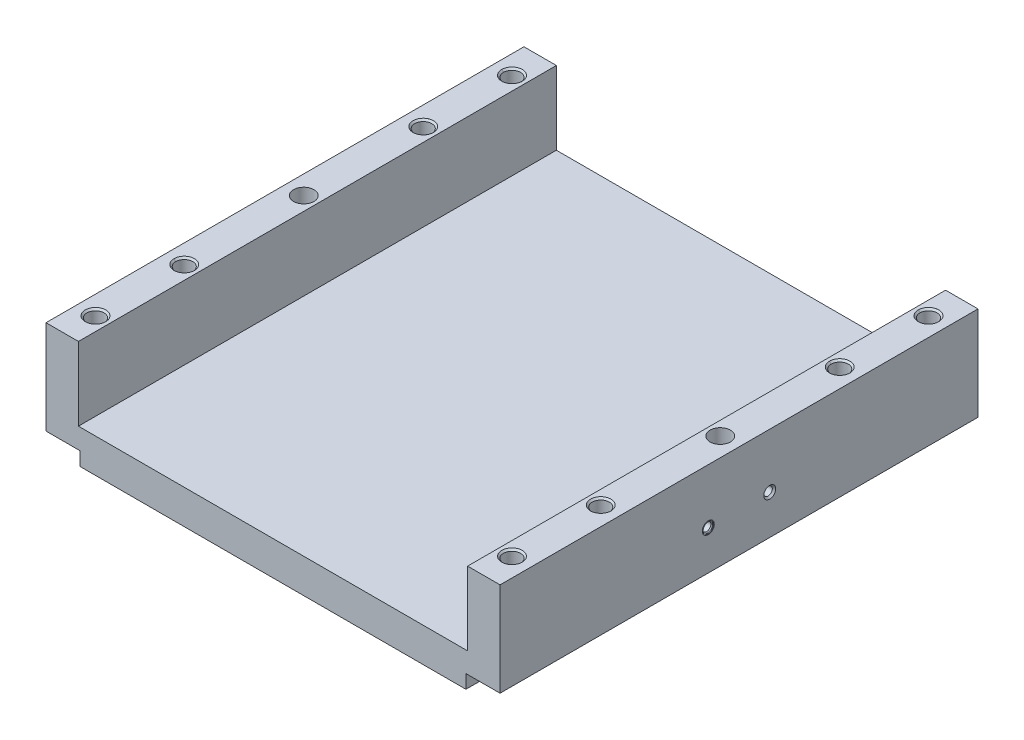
ISO-10303-21;
HEADER;
FILE_DESCRIPTION(('STEP AP214'),'2;1');
FILE_NAME('part.step','',(''),(''),'','','');
FILE_SCHEMA(('AUTOMOTIVE_DESIGN { 1 0 10303 214 1 1 1 1 }'));
ENDSEC;
DATA;
#1=APPLICATION_CONTEXT('core data for automotive mechanical design processes');
#2=APPLICATION_PROTOCOL_DEFINITION('international standard','automotive_design',2000,#1);
#3=PRODUCT_CONTEXT('',#1,'mechanical');
#4=PRODUCT('Part','Part','',(#3));
#5=PRODUCT_RELATED_PRODUCT_CATEGORY('part','',(#4));
#6=PRODUCT_DEFINITION_FORMATION('','',#4);
#7=PRODUCT_DEFINITION_CONTEXT('part definition',#1,'design');
#8=PRODUCT_DEFINITION('design','',#6,#7);
#9=PRODUCT_DEFINITION_SHAPE('','',#8);
#10=(LENGTH_UNIT() NAMED_UNIT(*) SI_UNIT(.MILLI.,.METRE.));
#11=(NAMED_UNIT(*) PLANE_ANGLE_UNIT() SI_UNIT($,.RADIAN.));
#12=(NAMED_UNIT(*) SI_UNIT($,.STERADIAN.) SOLID_ANGLE_UNIT());
#13=UNCERTAINTY_MEASURE_WITH_UNIT(LENGTH_MEASURE(1.E-05),#10,'distance_accuracy_value','');
#14=(GEOMETRIC_REPRESENTATION_CONTEXT(3) GLOBAL_UNCERTAINTY_ASSIGNED_CONTEXT((#13)) GLOBAL_UNIT_ASSIGNED_CONTEXT((#10,
#11,#12)) REPRESENTATION_CONTEXT('',''));
#15=CARTESIAN_POINT('',(0.,0.,0.));
#16=DIRECTION('',(0.,0.,1.));
#17=DIRECTION('',(1.,0.,0.));
#18=AXIS2_PLACEMENT_3D('',#15,#16,#17);
#19=CARTESIAN_POINT('',(-61.,42.8,-61.));
#20=DIRECTION('',(0.,-1.,0.));
#21=DIRECTION('',(0.,0.,-1.));
#22=AXIS2_PLACEMENT_3D('',#19,#20,#21);
#23=CYLINDRICAL_SURFACE('',#22,3.);
#24=CARTESIAN_POINT('',(-61.,27.5,-61.));
#25=DIRECTION('',(0.,-1.,0.));
#26=DIRECTION('',(0.,0.,-1.));
#27=AXIS2_PLACEMENT_3D('',#24,#25,#26);
#28=CIRCLE('',#27,3.);
#29=CARTESIAN_POINT('',(-61.,27.5,-64.));
#30=VERTEX_POINT('',#29);
#31=EDGE_CURVE('P0_E20',#30,#30,#28,.F.);
#32=ORIENTED_EDGE('',*,*,#31,.T.);
#33=EDGE_LOOP('',(#32));
#34=FACE_BOUND('',#33,.T.);
#35=CARTESIAN_POINT('',(-61.,42.5,-61.));
#36=DIRECTION('',(0.,-1.,0.));
#37=DIRECTION('',(0.,0.,-1.));
#38=AXIS2_PLACEMENT_3D('',#35,#36,#37);
#39=CIRCLE('',#38,3.);
#40=CARTESIAN_POINT('',(-61.,42.5,-64.));
#41=VERTEX_POINT('',#40);
#42=EDGE_CURVE('P0_E11',#41,#41,#39,.T.);
#43=ORIENTED_EDGE('',*,*,#42,.T.);
#44=EDGE_LOOP('',(#43));
#45=FACE_BOUND('',#44,.T.);
#46=ADVANCED_FACE('P0_F16',(#34,#45),#23,.T.);
#47=CARTESIAN_POINT('',(-61.,27.5,-61.));
#48=DIRECTION('',(0.,1.,0.));
#49=DIRECTION('',(0.,0.,1.));
#50=AXIS2_PLACEMENT_3D('',#47,#48,#49);
#51=PLANE('',#50);
#52=CARTESIAN_POINT('',(-58.5,27.5,-61.));
#53=CARTESIAN_POINT('',(-58.505006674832,27.5,-60.4862148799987));
#54=CARTESIAN_POINT('',(-58.6932156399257,27.5,-60.0368947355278));
#55=CARTESIAN_POINT('',(-58.8858368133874,27.5,-59.5770411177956));
#56=CARTESIAN_POINT('',(-59.235260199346,27.5,-59.2288744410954));
#57=CARTESIAN_POINT('',(-59.5820715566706,27.5,-58.8833103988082));
#58=CARTESIAN_POINT('',(-60.0366861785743,27.5,-58.6931296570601));
#59=CARTESIAN_POINT('',(-60.4931727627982,27.5,-58.5021658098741));
#60=CARTESIAN_POINT('',(-60.9901235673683,27.5,-58.5000486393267));
#61=CARTESIAN_POINT('',(-61.4855134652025,27.5,-58.4979381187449));
#62=CARTESIAN_POINT('',(-61.9447270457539,27.5,-58.6854513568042));
#63=CARTESIAN_POINT('',(-62.4020124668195,27.5,-58.8721772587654));
#64=CARTESIAN_POINT('',(-62.7537861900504,27.5,-59.2180461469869));
#65=CARTESIAN_POINT('',(-63.1080140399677,27.5,-59.5663279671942));
#66=CARTESIAN_POINT('',(-63.3046478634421,27.5,-60.0320547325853));
#67=CARTESIAN_POINT('',(-63.4957210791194,27.5,-60.4846112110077));
#68=CARTESIAN_POINT('',(-63.5,27.5,-61.));
#69=B_SPLINE_CURVE_WITH_KNOTS('',2,(#52,#53,#54,#55,#56,#57,#58,#59,#60,#61,#62,#63,#64,#65,#66,
#67,#68),.UNSPECIFIED.,.F.,.F.,(3,2,2,2,2,2,2,2,3),(0.,0.125,0.25,0.375,0.5,0.625,0.75,0.875,
1.),.UNSPECIFIED.);
#70=CARTESIAN_POINT('',(-58.5,27.5,-61.));
#71=VERTEX_POINT('',#70);
#72=CARTESIAN_POINT('',(-63.5,27.5,-61.));
#73=VERTEX_POINT('',#72);
#74=EDGE_CURVE('P0_E28',#71,#73,#69,.T.);
#75=ORIENTED_EDGE('',*,*,#74,.F.);
#76=CARTESIAN_POINT('',(-63.5,27.5,-61.));
#77=CARTESIAN_POINT('',(-63.4949933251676,27.5,-61.5137851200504));
#78=CARTESIAN_POINT('',(-63.3067843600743,27.5,-61.9631052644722));
#79=CARTESIAN_POINT('',(-63.1141631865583,27.5,-62.4229588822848));
#80=CARTESIAN_POINT('',(-62.764739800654,27.5,-62.7711255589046));
#81=CARTESIAN_POINT('',(-62.4179284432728,27.5,-63.116689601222));
#82=CARTESIAN_POINT('',(-61.9633138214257,27.5,-63.3068703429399));
#83=CARTESIAN_POINT('',(-61.5068272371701,27.5,-63.4978341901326));
#84=CARTESIAN_POINT('',(-61.0098764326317,27.5,-63.4999513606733));
#85=CARTESIAN_POINT('',(-60.5144865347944,27.5,-63.5020618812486));
#86=CARTESIAN_POINT('',(-60.0552729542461,27.5,-63.3145486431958));
#87=CARTESIAN_POINT('',(-59.5979875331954,27.5,-63.1278227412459));
#88=CARTESIAN_POINT('',(-59.2462138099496,27.5,-62.7819538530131));
#89=CARTESIAN_POINT('',(-58.8919859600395,27.5,-62.4336720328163));
#90=CARTESIAN_POINT('',(-58.6953521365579,27.5,-61.9679452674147));
#91=CARTESIAN_POINT('',(-58.5042789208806,27.5,-61.5153887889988));
#92=CARTESIAN_POINT('',(-58.5,27.5,-61.));
#93=B_SPLINE_CURVE_WITH_KNOTS('',2,(#76,#77,#78,#79,#80,#81,#82,#83,#84,#85,#86,#87,#88,#89,#90,
#91,#92),.UNSPECIFIED.,.F.,.F.,(3,2,2,2,2,2,2,2,3),(0.,0.125,0.25,0.375,0.5,0.625,0.75,0.875,
1.),.UNSPECIFIED.);
#94=EDGE_CURVE('P0_E33',#73,#71,#93,.T.);
#95=ORIENTED_EDGE('',*,*,#94,.F.);
#96=EDGE_LOOP('',(#75,#95));
#97=FACE_BOUND('',#96,.T.);
#98=ORIENTED_EDGE('',*,*,#31,.F.);
#99=EDGE_LOOP('',(#98));
#100=FACE_BOUND('',#99,.T.);
#101=ADVANCED_FACE('P0_F17',(#97,#100),#51,.F.);
#102=OPEN_SHELL('',(#46,#101));
#103=SHELL_BASED_SURFACE_MODEL('P0_B1',(#102));
#104=CARTESIAN_POINT('',(-61.,27.2,35.));
#105=DIRECTION('',(0.,1.,0.));
#106=DIRECTION('',(0.,0.,1.));
#107=AXIS2_PLACEMENT_3D('',#104,#105,#106);
#108=CYLINDRICAL_SURFACE('',#107,3.);
#109=CARTESIAN_POINT('',(-61.,27.5,35.));
#110=DIRECTION('',(0.,1.,0.));
#111=DIRECTION('',(0.,0.,1.));
#112=AXIS2_PLACEMENT_3D('',#109,#110,#111);
#113=CIRCLE('',#112,3.);
#114=CARTESIAN_POINT('',(-61.,27.5,38.));
#115=VERTEX_POINT('',#114);
#116=EDGE_CURVE('P1_E20',#115,#115,#113,.T.);
#117=ORIENTED_EDGE('',*,*,#116,.T.);
#118=EDGE_LOOP('',(#117));
#119=FACE_BOUND('',#118,.T.);
#120=CARTESIAN_POINT('',(-61.,42.5,35.));
#121=DIRECTION('',(0.,1.,0.));
#122=DIRECTION('',(0.,0.,1.));
#123=AXIS2_PLACEMENT_3D('',#120,#121,#122);
#124=CIRCLE('',#123,3.);
#125=CARTESIAN_POINT('',(-61.,42.5,38.));
#126=VERTEX_POINT('',#125);
#127=EDGE_CURVE('P1_E11',#126,#126,#124,.F.);
#128=ORIENTED_EDGE('',*,*,#127,.T.);
#129=EDGE_LOOP('',(#128));
#130=FACE_BOUND('',#129,.T.);
#131=ADVANCED_FACE('P1_F16',(#119,#130),#108,.T.);
#132=CARTESIAN_POINT('',(-61.,27.5,35.));
#133=DIRECTION('',(0.,1.,0.));
#134=DIRECTION('',(0.,0.,1.));
#135=AXIS2_PLACEMENT_3D('',#132,#133,#134);
#136=PLANE('',#135);
#137=CARTESIAN_POINT('',(-63.5,27.5,35.));
#138=CARTESIAN_POINT('',(-63.4949933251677,27.5,34.4862148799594));
#139=CARTESIAN_POINT('',(-63.3067843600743,27.5,34.0368947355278));
#140=CARTESIAN_POINT('',(-63.1141631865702,27.5,33.5770411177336));
#141=CARTESIAN_POINT('',(-62.764739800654,27.5,33.2288744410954));
#142=CARTESIAN_POINT('',(-62.4179284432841,27.5,32.8833103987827));
#143=CARTESIAN_POINT('',(-61.9633138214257,27.5,32.6931296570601));
#144=CARTESIAN_POINT('',(-61.506827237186,27.5,32.5021658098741));
#145=CARTESIAN_POINT('',(-61.0098764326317,27.5,32.5000486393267));
#146=CARTESIAN_POINT('',(-60.5144865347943,27.5,32.4979381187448));
#147=CARTESIAN_POINT('',(-60.0552729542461,27.5,32.6854513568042));
#148=CARTESIAN_POINT('',(-59.5979875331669,27.5,32.8721772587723));
#149=CARTESIAN_POINT('',(-59.2462138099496,27.5,33.2180461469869));
#150=CARTESIAN_POINT('',(-58.8919859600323,27.5,33.5663279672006));
#151=CARTESIAN_POINT('',(-58.6953521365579,27.5,34.0320547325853));
#152=CARTESIAN_POINT('',(-58.5042789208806,27.5,34.4846112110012));
#153=CARTESIAN_POINT('',(-58.5,27.5,35.));
#154=B_SPLINE_CURVE_WITH_KNOTS('',2,(#137,#138,#139,#140,#141,#142,#143,#144,#145,#146,#147,
#148,#149,#150,#151,#152,#153),.UNSPECIFIED.,.F.,.F.,(3,2,2,2,2,2,2,2,3),(0.,0.125,0.25,0.375,
0.5,0.625,0.75,0.875,1.),.UNSPECIFIED.);
#155=CARTESIAN_POINT('',(-63.5,27.5,35.));
#156=VERTEX_POINT('',#155);
#157=CARTESIAN_POINT('',(-58.5,27.5,35.));
#158=VERTEX_POINT('',#157);
#159=EDGE_CURVE('P1_E28',#156,#158,#154,.T.);
#160=ORIENTED_EDGE('',*,*,#159,.F.);
#161=CARTESIAN_POINT('',(-58.5,27.5,35.));
#162=CARTESIAN_POINT('',(-58.505006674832,27.5,35.5137851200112));
#163=CARTESIAN_POINT('',(-58.6932156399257,27.5,35.9631052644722));
#164=CARTESIAN_POINT('',(-58.8858368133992,27.5,36.4229588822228));
#165=CARTESIAN_POINT('',(-59.235260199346,27.5,36.7711255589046));
#166=CARTESIAN_POINT('',(-59.5820715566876,27.5,37.1166896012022));
#167=CARTESIAN_POINT('',(-60.0366861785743,27.5,37.3068703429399));
#168=CARTESIAN_POINT('',(-60.4931727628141,27.5,37.4978341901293));
#169=CARTESIAN_POINT('',(-60.9901235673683,27.5,37.4999513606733));
#170=CARTESIAN_POINT('',(-61.4855134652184,27.5,37.5020618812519));
#171=CARTESIAN_POINT('',(-61.9447270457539,27.5,37.3145486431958));
#172=CARTESIAN_POINT('',(-62.4020124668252,27.5,37.127822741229));
#173=CARTESIAN_POINT('',(-62.7537861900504,27.5,36.7819538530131));
#174=CARTESIAN_POINT('',(-63.1080140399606,27.5,36.4336720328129));
#175=CARTESIAN_POINT('',(-63.3046478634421,27.5,35.9679452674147));
#176=CARTESIAN_POINT('',(-63.4957210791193,27.5,35.5153887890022));
#177=CARTESIAN_POINT('',(-63.5,27.5,35.));
#178=B_SPLINE_CURVE_WITH_KNOTS('',2,(#161,#162,#163,#164,#165,#166,#167,#168,#169,#170,#171,
#172,#173,#174,#175,#176,#177),.UNSPECIFIED.,.F.,.F.,(3,2,2,2,2,2,2,2,3),(0.,0.125,0.25,0.375,
0.5,0.625,0.75,0.875,1.),.UNSPECIFIED.);
#179=EDGE_CURVE('P1_E33',#158,#156,#178,.T.);
#180=ORIENTED_EDGE('',*,*,#179,.F.);
#181=EDGE_LOOP('',(#160,#180));
#182=FACE_BOUND('',#181,.T.);
#183=ORIENTED_EDGE('',*,*,#116,.F.);
#184=EDGE_LOOP('',(#183));
#185=FACE_BOUND('',#184,.T.);
#186=ADVANCED_FACE('P1_F17',(#182,#185),#136,.F.);
#187=OPEN_SHELL('',(#131,#186));
#188=SHELL_BASED_SURFACE_MODEL('P1_B1',(#187));
#189=CARTESIAN_POINT('',(-61.,42.8,-35.));
#190=DIRECTION('',(0.,-1.,0.));
#191=DIRECTION('',(0.,0.,-1.));
#192=AXIS2_PLACEMENT_3D('',#189,#190,#191);
#193=CYLINDRICAL_SURFACE('',#192,3.);
#194=CARTESIAN_POINT('',(-61.,27.5,-35.));
#195=DIRECTION('',(0.,-1.,0.));
#196=DIRECTION('',(0.,0.,-1.));
#197=AXIS2_PLACEMENT_3D('',#194,#195,#196);
#198=CIRCLE('',#197,3.);
#199=CARTESIAN_POINT('',(-61.,27.5,-38.));
#200=VERTEX_POINT('',#199);
#201=EDGE_CURVE('P2_E20',#200,#200,#198,.F.);
#202=ORIENTED_EDGE('',*,*,#201,.T.);
#203=EDGE_LOOP('',(#202));
#204=FACE_BOUND('',#203,.T.);
#205=CARTESIAN_POINT('',(-61.,42.5,-35.));
#206=DIRECTION('',(0.,-1.,0.));
#207=DIRECTION('',(0.,0.,-1.));
#208=AXIS2_PLACEMENT_3D('',#205,#206,#207);
#209=CIRCLE('',#208,3.);
#210=CARTESIAN_POINT('',(-61.,42.5,-38.));
#211=VERTEX_POINT('',#210);
#212=EDGE_CURVE('P2_E11',#211,#211,#209,.T.);
#213=ORIENTED_EDGE('',*,*,#212,.T.);
#214=EDGE_LOOP('',(#213));
#215=FACE_BOUND('',#214,.T.);
#216=ADVANCED_FACE('P2_F16',(#204,#215),#193,.T.);
#217=CARTESIAN_POINT('',(-61.,27.5,-35.));
#218=DIRECTION('',(0.,1.,0.));
#219=DIRECTION('',(0.,0.,1.));
#220=AXIS2_PLACEMENT_3D('',#217,#218,#219);
#221=PLANE('',#220);
#222=CARTESIAN_POINT('',(-58.5,27.5,-35.));
#223=CARTESIAN_POINT('',(-58.505006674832,27.5,-34.4862148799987));
#224=CARTESIAN_POINT('',(-58.6932156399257,27.5,-34.0368947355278));
#225=CARTESIAN_POINT('',(-58.8858368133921,27.5,-33.5770411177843));
#226=CARTESIAN_POINT('',(-59.235260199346,27.5,-33.2288744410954));
#227=CARTESIAN_POINT('',(-59.5820715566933,27.5,-32.8833103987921));
#228=CARTESIAN_POINT('',(-60.0366861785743,27.5,-32.6931296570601));
#229=CARTESIAN_POINT('',(-60.4931727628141,27.5,-32.502165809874));
#230=CARTESIAN_POINT('',(-60.9901235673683,27.5,-32.5000486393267));
#231=CARTESIAN_POINT('',(-61.4855134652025,27.5,-32.4979381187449));
#232=CARTESIAN_POINT('',(-61.9447270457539,27.5,-32.6854513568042));
#233=CARTESIAN_POINT('',(-62.4020124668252,27.5,-32.8721772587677));
#234=CARTESIAN_POINT('',(-62.7537861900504,27.5,-33.2180461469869));
#235=CARTESIAN_POINT('',(-63.1080140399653,27.5,-33.5663279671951));
#236=CARTESIAN_POINT('',(-63.3046478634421,27.5,-34.0320547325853));
#237=CARTESIAN_POINT('',(-63.4957210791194,27.5,-34.4846112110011));
#238=CARTESIAN_POINT('',(-63.5,27.5,-35.));
#239=B_SPLINE_CURVE_WITH_KNOTS('',2,(#222,#223,#224,#225,#226,#227,#228,#229,#230,#231,#232,
#233,#234,#235,#236,#237,#238),.UNSPECIFIED.,.F.,.F.,(3,2,2,2,2,2,2,2,3),(0.,0.125,0.25,0.375,
0.5,0.625,0.75,0.875,1.),.UNSPECIFIED.);
#240=CARTESIAN_POINT('',(-58.5,27.5,-35.));
#241=VERTEX_POINT('',#240);
#242=CARTESIAN_POINT('',(-63.5,27.5,-35.));
#243=VERTEX_POINT('',#242);
#244=EDGE_CURVE('P2_E28',#241,#243,#239,.T.);
#245=ORIENTED_EDGE('',*,*,#244,.F.);
#246=CARTESIAN_POINT('',(-63.5,27.5,-35.));
#247=CARTESIAN_POINT('',(-63.4949933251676,27.5,-35.5137851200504));
#248=CARTESIAN_POINT('',(-63.3067843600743,27.5,-35.9631052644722));
#249=CARTESIAN_POINT('',(-63.1141631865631,27.5,-36.4229588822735));
#250=CARTESIAN_POINT('',(-62.764739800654,27.5,-36.7711255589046));
#251=CARTESIAN_POINT('',(-62.4179284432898,27.5,-37.1166896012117));
#252=CARTESIAN_POINT('',(-61.9633138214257,27.5,-37.3068703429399));
#253=CARTESIAN_POINT('',(-61.506827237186,27.5,-37.4978341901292));
#254=CARTESIAN_POINT('',(-61.0098764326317,27.5,-37.4999513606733));
#255=CARTESIAN_POINT('',(-60.5144865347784,27.5,-37.502061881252));
#256=CARTESIAN_POINT('',(-60.0552729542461,27.5,-37.3145486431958));
#257=CARTESIAN_POINT('',(-59.5979875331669,27.5,-37.1278227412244));
#258=CARTESIAN_POINT('',(-59.2462138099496,27.5,-36.7819538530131));
#259=CARTESIAN_POINT('',(-58.8919859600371,27.5,-36.4336720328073));
#260=CARTESIAN_POINT('',(-58.6953521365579,27.5,-35.9679452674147));
#261=CARTESIAN_POINT('',(-58.5042789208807,27.5,-35.5153887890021));
#262=CARTESIAN_POINT('',(-58.5,27.5,-35.));
#263=B_SPLINE_CURVE_WITH_KNOTS('',2,(#246,#247,#248,#249,#250,#251,#252,#253,#254,#255,#256,
#257,#258,#259,#260,#261,#262),.UNSPECIFIED.,.F.,.F.,(3,2,2,2,2,2,2,2,3),(0.,0.125,0.25,0.375,
0.5,0.625,0.75,0.875,1.),.UNSPECIFIED.);
#264=EDGE_CURVE('P2_E33',#243,#241,#263,.T.);
#265=ORIENTED_EDGE('',*,*,#264,.F.);
#266=EDGE_LOOP('',(#245,#265));
#267=FACE_BOUND('',#266,.T.);
#268=ORIENTED_EDGE('',*,*,#201,.F.);
#269=EDGE_LOOP('',(#268));
#270=FACE_BOUND('',#269,.T.);
#271=ADVANCED_FACE('P2_F17',(#267,#270),#221,.F.);
#272=OPEN_SHELL('',(#216,#271));
#273=SHELL_BASED_SURFACE_MODEL('P2_B1',(#272));
#274=CARTESIAN_POINT('',(-66.73478713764,26.5,-9.));
#275=DIRECTION('',(1.,0.,0.));
#276=DIRECTION('',(0.,0.,-1.));
#277=AXIS2_PLACEMENT_3D('',#274,#275,#276);
#278=CYLINDRICAL_SURFACE('',#277,1.5);
#279=CARTESIAN_POINT('',(-59.5,26.5,-9.));
#280=DIRECTION('',(1.,0.,0.));
#281=DIRECTION('',(0.,0.,-1.));
#282=AXIS2_PLACEMENT_3D('',#279,#280,#281);
#283=CIRCLE('',#282,1.5);
#284=CARTESIAN_POINT('',(-59.5,26.5,-10.5));
#285=VERTEX_POINT('',#284);
#286=EDGE_CURVE('P3_E15',#285,#285,#283,.F.);
#287=ORIENTED_EDGE('',*,*,#286,.T.);
#288=EDGE_LOOP('',(#287));
#289=FACE_BOUND('',#288,.T.);
#290=CARTESIAN_POINT('',(-66.5,26.5,-9.));
#291=DIRECTION('',(1.,0.,0.));
#292=DIRECTION('',(0.,0.,-1.));
#293=AXIS2_PLACEMENT_3D('',#290,#291,#292);
#294=CIRCLE('',#293,1.5);
#295=CARTESIAN_POINT('',(-66.5,26.5,-10.5));
#296=VERTEX_POINT('',#295);
#297=EDGE_CURVE('P3_E10',#296,#296,#294,.T.);
#298=ORIENTED_EDGE('',*,*,#297,.T.);
#299=EDGE_LOOP('',(#298));
#300=FACE_BOUND('',#299,.T.);
#301=ADVANCED_FACE('P3_F14',(#289,#300),#278,.T.);
#302=OPEN_SHELL('',(#301));
#303=SHELL_BASED_SURFACE_MODEL('P3_B1',(#302));
#304=CARTESIAN_POINT('',(66.73478713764,26.5,9.));
#305=DIRECTION('',(-1.,0.,0.));
#306=DIRECTION('',(0.,0.,1.));
#307=AXIS2_PLACEMENT_3D('',#304,#305,#306);
#308=CYLINDRICAL_SURFACE('',#307,1.5);
#309=CARTESIAN_POINT('',(59.5,26.5,9.));
#310=DIRECTION('',(-1.,0.,0.));
#311=DIRECTION('',(0.,0.,1.));
#312=AXIS2_PLACEMENT_3D('',#309,#310,#311);
#313=CIRCLE('',#312,1.5);
#314=CARTESIAN_POINT('',(59.5,26.5,10.5));
#315=VERTEX_POINT('',#314);
#316=EDGE_CURVE('P4_E15',#315,#315,#313,.F.);
#317=ORIENTED_EDGE('',*,*,#316,.T.);
#318=EDGE_LOOP('',(#317));
#319=FACE_BOUND('',#318,.T.);
#320=CARTESIAN_POINT('',(66.5,26.5,9.));
#321=DIRECTION('',(-1.,0.,0.));
#322=DIRECTION('',(0.,0.,1.));
#323=AXIS2_PLACEMENT_3D('',#320,#321,#322);
#324=CIRCLE('',#323,1.5);
#325=CARTESIAN_POINT('',(66.5,26.5,10.5));
#326=VERTEX_POINT('',#325);
#327=EDGE_CURVE('P4_E10',#326,#326,#324,.T.);
#328=ORIENTED_EDGE('',*,*,#327,.T.);
#329=EDGE_LOOP('',(#328));
#330=FACE_BOUND('',#329,.T.);
#331=ADVANCED_FACE('P4_F14',(#319,#330),#308,.T.);
#332=OPEN_SHELL('',(#331));
#333=SHELL_BASED_SURFACE_MODEL('P4_B1',(#332));
#334=CARTESIAN_POINT('',(-59.5,26.5,9.));
#335=DIRECTION('',(1.,0.,0.));
#336=DIRECTION('',(0.,0.,-1.));
#337=AXIS2_PLACEMENT_3D('',#334,#335,#336);
#338=PLANE('',#337);
#339=CARTESIAN_POINT('',(-59.5,26.5,9.));
#340=DIRECTION('',(-1.,0.,0.));
#341=DIRECTION('',(0.,0.,1.));
#342=AXIS2_PLACEMENT_3D('',#339,#340,#341);
#343=CIRCLE('',#342,1.25);
#344=CARTESIAN_POINT('',(-59.5,26.5,10.25));
#345=VERTEX_POINT('',#344);
#346=EDGE_CURVE('P5_E20',#345,#345,#343,.T.);
#347=ORIENTED_EDGE('',*,*,#346,.T.);
#348=EDGE_LOOP('',(#347));
#349=FACE_BOUND('',#348,.T.);
#350=ADVANCED_FACE('P5_F17',(#349),#338,.F.);
#351=CARTESIAN_POINT('',(-59.5,26.5,-9.));
#352=DIRECTION('',(1.,0.,0.));
#353=DIRECTION('',(0.,0.,-1.));
#354=AXIS2_PLACEMENT_3D('',#351,#352,#353);
#355=PLANE('',#354);
#356=CARTESIAN_POINT('',(-59.5,26.5,-9.));
#357=DIRECTION('',(-1.,0.,0.));
#358=DIRECTION('',(0.,0.,1.));
#359=AXIS2_PLACEMENT_3D('',#356,#357,#358);
#360=CIRCLE('',#359,1.25);
#361=CARTESIAN_POINT('',(-59.5,26.5,-7.75));
#362=VERTEX_POINT('',#361);
#363=EDGE_CURVE('P5_E398',#362,#362,#360,.T.);
#364=ORIENTED_EDGE('',*,*,#363,.T.);
#365=EDGE_LOOP('',(#364));
#366=FACE_BOUND('',#365,.T.);
#367=ADVANCED_FACE('P5_F560',(#366),#355,.F.);
#368=CARTESIAN_POINT('',(-59.26521286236,26.5,9.));
#369=DIRECTION('',(-1.,0.,0.));
#370=DIRECTION('',(0.,0.,1.));
#371=AXIS2_PLACEMENT_3D('',#368,#369,#370);
#372=CYLINDRICAL_SURFACE('',#371,1.25);
#373=ORIENTED_EDGE('',*,*,#346,.F.);
#374=EDGE_LOOP('',(#373));
#375=FACE_BOUND('',#374,.T.);
#376=CARTESIAN_POINT('',(-65.9999999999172,26.5,9.));
#377=DIRECTION('',(-1.,0.,0.));
#378=DIRECTION('',(0.,0.,-1.));
#379=AXIS2_PLACEMENT_3D('',#376,#377,#378);
#380=CIRCLE('',#379,1.25000000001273);
#381=CARTESIAN_POINT('',(-65.9999999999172,26.5,7.74999999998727));
#382=VERTEX_POINT('',#381);
#383=EDGE_CURVE('P5_E393',#382,#382,#380,.T.);
#384=ORIENTED_EDGE('',*,*,#383,.T.);
#385=EDGE_LOOP('',(#384));
#386=FACE_BOUND('',#385,.T.);
#387=ADVANCED_FACE('P5_F556',(#375,#386),#372,.F.);
#388=CARTESIAN_POINT('',(-59.26521286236,26.5,-9.));
#389=DIRECTION('',(-1.,0.,0.));
#390=DIRECTION('',(0.,0.,1.));
#391=AXIS2_PLACEMENT_3D('',#388,#389,#390);
#392=CYLINDRICAL_SURFACE('',#391,1.25);
#393=ORIENTED_EDGE('',*,*,#363,.F.);
#394=EDGE_LOOP('',(#393));
#395=FACE_BOUND('',#394,.T.);
#396=CARTESIAN_POINT('',(-65.9999999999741,26.5,-9.));
#397=DIRECTION('',(-1.,0.,0.));
#398=DIRECTION('',(0.,0.,-1.));
#399=AXIS2_PLACEMENT_3D('',#396,#397,#398);
#400=CIRCLE('',#399,1.25000000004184);
#401=CARTESIAN_POINT('',(-65.9999999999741,26.5,-10.2500000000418));
#402=VERTEX_POINT('',#401);
#403=EDGE_CURVE('P5_E283',#402,#402,#400,.T.);
#404=ORIENTED_EDGE('',*,*,#403,.T.);
#405=EDGE_LOOP('',(#404));
#406=FACE_BOUND('',#405,.T.);
#407=ADVANCED_FACE('P5_F559',(#395,#406),#392,.F.);
#408=CARTESIAN_POINT('',(-74.,3.5,0.));
#409=DIRECTION('',(0.,1.,0.));
#410=DIRECTION('',(0.,0.,1.));
#411=AXIS2_PLACEMENT_3D('',#408,#409,#410);
#412=PLANE('',#411);
#413=DIRECTION('',(1.,0.,0.));
#414=VECTOR('',#413,1.);
#415=CARTESIAN_POINT('',(-74.,3.5,5.));
#416=LINE('',#415,#414);
#417=CARTESIAN_POINT('',(-74.5,3.5,5.));
#418=VERTEX_POINT('',#417);
#419=CARTESIAN_POINT('',(-73.5,3.5,5.));
#420=VERTEX_POINT('',#419);
#421=EDGE_CURVE('P5_E391',#418,#420,#416,.T.);
#422=ORIENTED_EDGE('',*,*,#421,.F.);
#423=DIRECTION('',(0.,0.,-1.));
#424=VECTOR('',#423,1.);
#425=CARTESIAN_POINT('',(-74.5,3.5,0.));
#426=LINE('',#425,#424);
#427=CARTESIAN_POINT('',(-74.5,3.5,-5.));
#428=VERTEX_POINT('',#427);
#429=EDGE_CURVE('P5_E372',#418,#428,#426,.T.);
#430=ORIENTED_EDGE('',*,*,#429,.T.);
#431=DIRECTION('',(1.,0.,0.));
#432=VECTOR('',#431,1.);
#433=CARTESIAN_POINT('',(-74.,3.5,-5.));
#434=LINE('',#433,#432);
#435=CARTESIAN_POINT('',(-73.5,3.5,-5.));
#436=VERTEX_POINT('',#435);
#437=EDGE_CURVE('P5_E394',#436,#428,#434,.F.);
#438=ORIENTED_EDGE('',*,*,#437,.F.);
#439=DIRECTION('',(0.,0.,-1.));
#440=VECTOR('',#439,1.);
#441=CARTESIAN_POINT('',(-73.5,3.5,0.));
#442=LINE('',#441,#440);
#443=EDGE_CURVE('P5_E294',#420,#436,#442,.T.);
#444=ORIENTED_EDGE('',*,*,#443,.F.);
#445=EDGE_LOOP('',(#422,#430,#438,#444));
#446=FACE_BOUND('',#445,.T.);
#447=ADVANCED_FACE('P5_F568',(#446),#412,.F.);
#448=CARTESIAN_POINT('',(-66.4999999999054,26.5,9.));
#449=DIRECTION('',(-1.,0.,0.));
#450=DIRECTION('',(0.,0.,1.));
#451=AXIS2_PLACEMENT_3D('',#448,#449,#450);
#452=CONICAL_SURFACE('',#451,1.75000000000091,0.785398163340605);
#453=ORIENTED_EDGE('',*,*,#383,.F.);
#454=EDGE_LOOP('',(#453));
#455=FACE_BOUND('',#454,.T.);
#456=CARTESIAN_POINT('',(-66.5,26.5,9.));
#457=DIRECTION('',(1.,0.,0.));
#458=DIRECTION('',(0.,0.,-1.));
#459=AXIS2_PLACEMENT_3D('',#456,#457,#458);
#460=CIRCLE('',#459,1.75);
#461=CARTESIAN_POINT('',(-66.5,26.5,7.25));
#462=VERTEX_POINT('',#461);
#463=EDGE_CURVE('P5_E384',#462,#462,#460,.F.);
#464=ORIENTED_EDGE('',*,*,#463,.T.);
#465=EDGE_LOOP('',(#464));
#466=FACE_BOUND('',#465,.T.);
#467=ADVANCED_FACE('P5_F564',(#455,#466),#452,.F.);
#468=CARTESIAN_POINT('',(-66.4999999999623,26.5,-9.));
#469=DIRECTION('',(-1.,0.,0.));
#470=DIRECTION('',(0.,0.,1.));
#471=AXIS2_PLACEMENT_3D('',#468,#469,#470);
#472=CONICAL_SURFACE('',#471,1.75000000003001,0.785398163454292);
#473=ORIENTED_EDGE('',*,*,#403,.F.);
#474=EDGE_LOOP('',(#473));
#475=FACE_BOUND('',#474,.T.);
#476=CARTESIAN_POINT('',(-66.5,26.5,-9.));
#477=DIRECTION('',(1.,0.,0.));
#478=DIRECTION('',(0.,0.,-1.));
#479=AXIS2_PLACEMENT_3D('',#476,#477,#478);
#480=CIRCLE('',#479,1.75);
#481=CARTESIAN_POINT('',(-66.5,26.5,-10.75));
#482=VERTEX_POINT('',#481);
#483=EDGE_CURVE('P5_E385',#482,#482,#480,.F.);
#484=ORIENTED_EDGE('',*,*,#483,.T.);
#485=EDGE_LOOP('',(#484));
#486=FACE_BOUND('',#485,.T.);
#487=ADVANCED_FACE('P5_F567',(#475,#486),#472,.F.);
#488=CARTESIAN_POINT('',(-61.,27.5,-61.));
#489=DIRECTION('',(0.,1.,0.));
#490=DIRECTION('',(0.,0.,1.));
#491=AXIS2_PLACEMENT_3D('',#488,#489,#490);
#492=PLANE('',#491);
#493=CARTESIAN_POINT('',(-61.,27.5,-61.));
#494=DIRECTION('',(0.,1.,0.));
#495=DIRECTION('',(0.,0.,1.));
#496=AXIS2_PLACEMENT_3D('',#493,#494,#495);
#497=CIRCLE('',#496,2.5);
#498=CARTESIAN_POINT('',(-61.,27.5,-58.5));
#499=VERTEX_POINT('',#498);
#500=EDGE_CURVE('P5_E388',#499,#499,#497,.T.);
#501=ORIENTED_EDGE('',*,*,#500,.T.);
#502=EDGE_LOOP('',(#501));
#503=FACE_BOUND('',#502,.T.);
#504=ADVANCED_FACE('P5_F1566',(#503),#492,.T.);
#505=CARTESIAN_POINT('',(-61.,27.5,-34.99999633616));
#506=DIRECTION('',(0.,1.,0.));
#507=DIRECTION('',(0.,0.,1.));
#508=AXIS2_PLACEMENT_3D('',#505,#506,#507);
#509=PLANE('',#508);
#510=CARTESIAN_POINT('',(-61.,27.5,-35.));
#511=DIRECTION('',(0.,1.,0.));
#512=DIRECTION('',(0.,0.,1.));
#513=AXIS2_PLACEMENT_3D('',#510,#511,#512);
#514=CIRCLE('',#513,2.5);
#515=CARTESIAN_POINT('',(-61.,27.5,-32.5));
#516=VERTEX_POINT('',#515);
#517=EDGE_CURVE('P5_E545',#516,#516,#514,.T.);
#518=ORIENTED_EDGE('',*,*,#517,.T.);
#519=EDGE_LOOP('',(#518));
#520=FACE_BOUND('',#519,.T.);
#521=ADVANCED_FACE('P5_F1557',(#520),#509,.T.);
#522=CARTESIAN_POINT('',(-61.,27.5,35.00000567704));
#523=DIRECTION('',(0.,1.,0.));
#524=DIRECTION('',(0.,0.,1.));
#525=AXIS2_PLACEMENT_3D('',#522,#523,#524);
#526=PLANE('',#525);
#527=CARTESIAN_POINT('',(-61.,27.5,35.));
#528=DIRECTION('',(0.,1.,0.));
#529=DIRECTION('',(0.,0.,1.));
#530=AXIS2_PLACEMENT_3D('',#527,#528,#529);
#531=CIRCLE('',#530,2.5);
#532=CARTESIAN_POINT('',(-61.,27.5,37.5));
#533=VERTEX_POINT('',#532);
#534=EDGE_CURVE('P5_E542',#533,#533,#531,.T.);
#535=ORIENTED_EDGE('',*,*,#534,.T.);
#536=EDGE_LOOP('',(#535));
#537=FACE_BOUND('',#536,.T.);
#538=ADVANCED_FACE('P5_F1548',(#537),#526,.T.);
#539=CARTESIAN_POINT('',(-61.,27.5,61.00000256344));
#540=DIRECTION('',(0.,1.,0.));
#541=DIRECTION('',(0.,0.,1.));
#542=AXIS2_PLACEMENT_3D('',#539,#540,#541);
#543=PLANE('',#542);
#544=CARTESIAN_POINT('',(-61.,27.5,61.));
#545=DIRECTION('',(0.,1.,0.));
#546=DIRECTION('',(0.,0.,1.));
#547=AXIS2_PLACEMENT_3D('',#544,#545,#546);
#548=CIRCLE('',#547,2.5);
#549=CARTESIAN_POINT('',(-61.,27.5,63.5));
#550=VERTEX_POINT('',#549);
#551=EDGE_CURVE('P5_E539',#550,#550,#548,.T.);
#552=ORIENTED_EDGE('',*,*,#551,.T.);
#553=EDGE_LOOP('',(#552));
#554=FACE_BOUND('',#553,.T.);
#555=ADVANCED_FACE('P5_F1540',(#554),#543,.T.);
#556=CARTESIAN_POINT('',(-72.5,19.5,-5.2));
#557=DIRECTION('',(0.,0.,1.));
#558=DIRECTION('',(1.,0.,0.));
#559=AXIS2_PLACEMENT_3D('',#556,#557,#558);
#560=CYLINDRICAL_SURFACE('',#559,1.);
#561=DIRECTION('',(0.,0.,-1.));
#562=VECTOR('',#561,1.);
#563=CARTESIAN_POINT('',(-73.5,19.5,0.));
#564=LINE('',#563,#562);
#565=CARTESIAN_POINT('',(-73.5,19.5,-5.));
#566=VERTEX_POINT('',#565);
#567=CARTESIAN_POINT('',(-73.5,19.5,5.));
#568=VERTEX_POINT('',#567);
#569=EDGE_CURVE('P5_E286',#566,#568,#564,.F.);
#570=ORIENTED_EDGE('',*,*,#569,.F.);
#571=CARTESIAN_POINT('',(-72.5,19.5,-5.));
#572=DIRECTION('',(0.,0.,1.));
#573=DIRECTION('',(1.,0.,0.));
#574=AXIS2_PLACEMENT_3D('',#571,#572,#573);
#575=CIRCLE('',#574,1.);
#576=CARTESIAN_POINT('',(-72.5,20.5,-5.));
#577=VERTEX_POINT('',#576);
#578=EDGE_CURVE('P5_E272',#577,#566,#575,.T.);
#579=ORIENTED_EDGE('',*,*,#578,.F.);
#580=DIRECTION('',(0.,0.,1.));
#581=VECTOR('',#580,1.);
#582=CARTESIAN_POINT('',(-72.5,20.5,0.));
#583=LINE('',#582,#581);
#584=CARTESIAN_POINT('',(-72.5,20.5,5.));
#585=VERTEX_POINT('',#584);
#586=EDGE_CURVE('P5_E322',#577,#585,#583,.T.);
#587=ORIENTED_EDGE('',*,*,#586,.T.);
#588=CARTESIAN_POINT('',(-72.5,19.5,5.));
#589=DIRECTION('',(0.,0.,1.));
#590=DIRECTION('',(1.,0.,0.));
#591=AXIS2_PLACEMENT_3D('',#588,#589,#590);
#592=CIRCLE('',#591,1.);
#593=EDGE_CURVE('P5_E289',#568,#585,#592,.F.);
#594=ORIENTED_EDGE('',*,*,#593,.F.);
#595=EDGE_LOOP('',(#570,#579,#587,#594));
#596=FACE_BOUND('',#595,.T.);
#597=ADVANCED_FACE('P5_F287',(#596),#560,.F.);
#598=CARTESIAN_POINT('',(-70.5,21.5,0.));
#599=DIRECTION('',(0.,1.,0.));
#600=DIRECTION('',(0.,0.,1.));
#601=AXIS2_PLACEMENT_3D('',#598,#599,#600);
#602=PLANE('',#601);
#603=DIRECTION('',(1.,0.,0.));
#604=VECTOR('',#603,1.);
#605=CARTESIAN_POINT('',(-70.5,21.5,5.));
#606=LINE('',#605,#604);
#607=CARTESIAN_POINT('',(-68.5,21.5,5.));
#608=VERTEX_POINT('',#607);
#609=CARTESIAN_POINT('',(-72.5,21.5,5.));
#610=VERTEX_POINT('',#609);
#611=EDGE_CURVE('P5_E336',#608,#610,#606,.F.);
#612=ORIENTED_EDGE('',*,*,#611,.F.);
#613=DIRECTION('',(0.,0.,1.));
#614=VECTOR('',#613,1.);
#615=CARTESIAN_POINT('',(-68.5,21.5,-5.2));
#616=LINE('',#615,#614);
#617=CARTESIAN_POINT('',(-68.5,21.5,-5.));
#618=VERTEX_POINT('',#617);
#619=EDGE_CURVE('P5_E293',#608,#618,#616,.F.);
#620=ORIENTED_EDGE('',*,*,#619,.T.);
#621=DIRECTION('',(1.,0.,0.));
#622=VECTOR('',#621,1.);
#623=CARTESIAN_POINT('',(-70.5,21.5,-5.));
#624=LINE('',#623,#622);
#625=CARTESIAN_POINT('',(-72.5,21.5,-5.));
#626=VERTEX_POINT('',#625);
#627=EDGE_CURVE('P5_E312',#618,#626,#624,.F.);
#628=ORIENTED_EDGE('',*,*,#627,.T.);
#629=DIRECTION('',(0.,0.,-1.));
#630=VECTOR('',#629,1.);
#631=CARTESIAN_POINT('',(-72.5,21.5,5.2));
#632=LINE('',#631,#630);
#633=EDGE_CURVE('P5_E282',#610,#626,#632,.T.);
#634=ORIENTED_EDGE('',*,*,#633,.F.);
#635=EDGE_LOOP('',(#612,#620,#628,#634));
#636=FACE_BOUND('',#635,.T.);
#637=ADVANCED_FACE('P5_F1523',(#636),#602,.T.);
#638=CARTESIAN_POINT('',(-72.5,19.5,5.2));
#639=DIRECTION('',(0.,0.,-1.));
#640=DIRECTION('',(-1.,0.,0.));
#641=AXIS2_PLACEMENT_3D('',#638,#639,#640);
#642=CYLINDRICAL_SURFACE('',#641,2.);
#643=ORIENTED_EDGE('',*,*,#633,.T.);
#644=CARTESIAN_POINT('',(-72.5,19.5,-5.));
#645=DIRECTION('',(0.,0.,-1.));
#646=DIRECTION('',(-1.,0.,0.));
#647=AXIS2_PLACEMENT_3D('',#644,#645,#646);
#648=CIRCLE('',#647,2.);
#649=CARTESIAN_POINT('',(-74.5,19.5,-5.));
#650=VERTEX_POINT('',#649);
#651=EDGE_CURVE('P5_E304',#626,#650,#648,.F.);
#652=ORIENTED_EDGE('',*,*,#651,.T.);
#653=DIRECTION('',(0.,0.,-1.));
#654=VECTOR('',#653,1.);
#655=CARTESIAN_POINT('',(-74.5,19.5,0.));
#656=LINE('',#655,#654);
#657=CARTESIAN_POINT('',(-74.5,19.5,5.));
#658=VERTEX_POINT('',#657);
#659=EDGE_CURVE('P5_E375',#650,#658,#656,.F.);
#660=ORIENTED_EDGE('',*,*,#659,.T.);
#661=CARTESIAN_POINT('',(-72.5,19.5,5.));
#662=DIRECTION('',(0.,0.,-1.));
#663=DIRECTION('',(-1.,0.,0.));
#664=AXIS2_PLACEMENT_3D('',#661,#662,#663);
#665=CIRCLE('',#664,2.);
#666=EDGE_CURVE('P5_E333',#610,#658,#665,.F.);
#667=ORIENTED_EDGE('',*,*,#666,.F.);
#668=EDGE_LOOP('',(#643,#652,#660,#667));
#669=FACE_BOUND('',#668,.T.);
#670=ADVANCED_FACE('P5_F1514',(#669),#642,.T.);
#671=CARTESIAN_POINT('',(-74.5,11.5,0.));
#672=DIRECTION('',(1.,0.,0.));
#673=DIRECTION('',(0.,0.,-1.));
#674=AXIS2_PLACEMENT_3D('',#671,#672,#673);
#675=PLANE('',#674);
#676=ORIENTED_EDGE('',*,*,#429,.F.);
#677=DIRECTION('',(0.,1.,0.));
#678=VECTOR('',#677,1.);
#679=CARTESIAN_POINT('',(-74.5,13.,5.));
#680=LINE('',#679,#678);
#681=EDGE_CURVE('P5_E328',#658,#418,#680,.F.);
#682=ORIENTED_EDGE('',*,*,#681,.F.);
#683=ORIENTED_EDGE('',*,*,#659,.F.);
#684=DIRECTION('',(0.,1.,0.));
#685=VECTOR('',#684,1.);
#686=CARTESIAN_POINT('',(-74.5,13.,-5.));
#687=LINE('',#686,#685);
#688=EDGE_CURVE('P5_E299',#650,#428,#687,.F.);
#689=ORIENTED_EDGE('',*,*,#688,.T.);
#690=EDGE_LOOP('',(#676,#682,#683,#689));
#691=FACE_BOUND('',#690,.T.);
#692=ADVANCED_FACE('P5_F1506',(#691),#675,.F.);
#693=CARTESIAN_POINT('',(-73.5,11.5,0.));
#694=DIRECTION('',(1.,0.,0.));
#695=DIRECTION('',(0.,0.,-1.));
#696=AXIS2_PLACEMENT_3D('',#693,#694,#695);
#697=PLANE('',#696);
#698=DIRECTION('',(0.,1.,0.));
#699=VECTOR('',#698,1.);
#700=CARTESIAN_POINT('',(-73.5,13.,-5.));
#701=LINE('',#700,#699);
#702=EDGE_CURVE('P5_E279',#436,#566,#701,.T.);
#703=ORIENTED_EDGE('',*,*,#702,.T.);
#704=ORIENTED_EDGE('',*,*,#569,.T.);
#705=DIRECTION('',(0.,1.,0.));
#706=VECTOR('',#705,1.);
#707=CARTESIAN_POINT('',(-73.5,13.,5.));
#708=LINE('',#707,#706);
#709=EDGE_CURVE('P5_E326',#420,#568,#708,.T.);
#710=ORIENTED_EDGE('',*,*,#709,.F.);
#711=ORIENTED_EDGE('',*,*,#443,.T.);
#712=EDGE_LOOP('',(#703,#704,#710,#711));
#713=FACE_BOUND('',#712,.T.);
#714=ADVANCED_FACE('P5_F297',(#713),#697,.T.);
#715=CARTESIAN_POINT('',(-68.5,22.5,-5.2));
#716=DIRECTION('',(0.,0.,1.));
#717=DIRECTION('',(1.,0.,0.));
#718=AXIS2_PLACEMENT_3D('',#715,#716,#717);
#719=CYLINDRICAL_SURFACE('',#718,1.);
#720=DIRECTION('',(0.,0.,-1.));
#721=VECTOR('',#720,1.);
#722=CARTESIAN_POINT('',(-67.5,22.5,0.));
#723=LINE('',#722,#721);
#724=CARTESIAN_POINT('',(-67.5,22.5,5.));
#725=VERTEX_POINT('',#724);
#726=CARTESIAN_POINT('',(-67.5,22.5,-5.));
#727=VERTEX_POINT('',#726);
#728=EDGE_CURVE('P5_E301',#725,#727,#723,.T.);
#729=ORIENTED_EDGE('',*,*,#728,.T.);
#730=CARTESIAN_POINT('',(-68.5,22.5,-5.));
#731=DIRECTION('',(0.,0.,1.));
#732=DIRECTION('',(1.,0.,0.));
#733=AXIS2_PLACEMENT_3D('',#730,#731,#732);
#734=CIRCLE('',#733,1.);
#735=EDGE_CURVE('P5_E314',#727,#618,#734,.F.);
#736=ORIENTED_EDGE('',*,*,#735,.T.);
#737=ORIENTED_EDGE('',*,*,#619,.F.);
#738=CARTESIAN_POINT('',(-68.5,22.5,5.));
#739=DIRECTION('',(0.,0.,1.));
#740=DIRECTION('',(1.,0.,0.));
#741=AXIS2_PLACEMENT_3D('',#738,#739,#740);
#742=CIRCLE('',#741,1.);
#743=EDGE_CURVE('P5_E339',#725,#608,#742,.F.);
#744=ORIENTED_EDGE('',*,*,#743,.F.);
#745=EDGE_LOOP('',(#729,#736,#737,#744));
#746=FACE_BOUND('',#745,.T.);
#747=ADVANCED_FACE('P5_F575',(#746),#719,.F.);
#748=CARTESIAN_POINT('',(-67.54518760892,26.5,9.));
#749=DIRECTION('',(1.,0.,0.));
#750=DIRECTION('',(0.,0.,-1.));
#751=AXIS2_PLACEMENT_3D('',#748,#749,#750);
#752=CYLINDRICAL_SURFACE('',#751,1.75);
#753=CARTESIAN_POINT('',(-67.5,26.5,9.));
#754=DIRECTION('',(1.,0.,0.));
#755=DIRECTION('',(0.,0.,-1.));
#756=AXIS2_PLACEMENT_3D('',#753,#754,#755);
#757=CIRCLE('',#756,1.75);
#758=CARTESIAN_POINT('',(-67.5,26.5,7.25));
#759=VERTEX_POINT('',#758);
#760=EDGE_CURVE('P5_E528',#759,#759,#757,.F.);
#761=ORIENTED_EDGE('',*,*,#760,.T.);
#762=EDGE_LOOP('',(#761));
#763=FACE_BOUND('',#762,.T.);
#764=ORIENTED_EDGE('',*,*,#463,.F.);
#765=EDGE_LOOP('',(#764));
#766=FACE_BOUND('',#765,.T.);
#767=ADVANCED_FACE('P5_F572',(#763,#766),#752,.F.);
#768=CARTESIAN_POINT('',(-67.54518760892,26.5,-9.));
#769=DIRECTION('',(1.,0.,0.));
#770=DIRECTION('',(0.,0.,-1.));
#771=AXIS2_PLACEMENT_3D('',#768,#769,#770);
#772=CYLINDRICAL_SURFACE('',#771,1.75);
#773=CARTESIAN_POINT('',(-67.5,26.5,-9.));
#774=DIRECTION('',(1.,0.,0.));
#775=DIRECTION('',(0.,0.,-1.));
#776=AXIS2_PLACEMENT_3D('',#773,#774,#775);
#777=CIRCLE('',#776,1.75);
#778=CARTESIAN_POINT('',(-67.5,26.5,-10.75));
#779=VERTEX_POINT('',#778);
#780=EDGE_CURVE('P5_E525',#779,#779,#777,.F.);
#781=ORIENTED_EDGE('',*,*,#780,.T.);
#782=EDGE_LOOP('',(#781));
#783=FACE_BOUND('',#782,.T.);
#784=ORIENTED_EDGE('',*,*,#483,.F.);
#785=EDGE_LOOP('',(#784));
#786=FACE_BOUND('',#785,.T.);
#787=ADVANCED_FACE('P5_F574',(#783,#786),#772,.F.);
#788=CARTESIAN_POINT('',(59.5,26.5,-9.));
#789=DIRECTION('',(1.,0.,0.));
#790=DIRECTION('',(0.,0.,-1.));
#791=AXIS2_PLACEMENT_3D('',#788,#789,#790);
#792=PLANE('',#791);
#793=CARTESIAN_POINT('',(59.5,26.5,-9.));
#794=DIRECTION('',(-1.,0.,0.));
#795=DIRECTION('',(0.,0.,1.));
#796=AXIS2_PLACEMENT_3D('',#793,#794,#795);
#797=CIRCLE('',#796,1.25);
#798=CARTESIAN_POINT('',(59.5,26.5,-7.75));
#799=VERTEX_POINT('',#798);
#800=EDGE_CURVE('P5_E522',#799,#799,#797,.F.);
#801=ORIENTED_EDGE('',*,*,#800,.T.);
#802=EDGE_LOOP('',(#801));
#803=FACE_BOUND('',#802,.T.);
#804=ADVANCED_FACE('P5_F583',(#803),#792,.T.);
#805=CARTESIAN_POINT('',(59.5,26.5,9.));
#806=DIRECTION('',(1.,0.,0.));
#807=DIRECTION('',(0.,0.,-1.));
#808=AXIS2_PLACEMENT_3D('',#805,#806,#807);
#809=PLANE('',#808);
#810=CARTESIAN_POINT('',(59.5,26.5,9.));
#811=DIRECTION('',(-1.,0.,0.));
#812=DIRECTION('',(0.,0.,1.));
#813=AXIS2_PLACEMENT_3D('',#810,#811,#812);
#814=CIRCLE('',#813,1.25);
#815=CARTESIAN_POINT('',(59.5,26.5,10.25));
#816=VERTEX_POINT('',#815);
#817=EDGE_CURVE('P5_E519',#816,#816,#814,.F.);
#818=ORIENTED_EDGE('',*,*,#817,.T.);
#819=EDGE_LOOP('',(#818));
#820=FACE_BOUND('',#819,.T.);
#821=ADVANCED_FACE('P5_F901',(#820),#809,.T.);
#822=CARTESIAN_POINT('',(61.,27.5,-61.));
#823=DIRECTION('',(0.,1.,0.));
#824=DIRECTION('',(0.,0.,1.));
#825=AXIS2_PLACEMENT_3D('',#822,#823,#824);
#826=PLANE('',#825);
#827=CARTESIAN_POINT('',(61.,27.5,-61.));
#828=DIRECTION('',(0.,1.,0.));
#829=DIRECTION('',(0.,0.,1.));
#830=AXIS2_PLACEMENT_3D('',#827,#828,#829);
#831=CIRCLE('',#830,2.5);
#832=CARTESIAN_POINT('',(61.,27.5,-58.5));
#833=VERTEX_POINT('',#832);
#834=EDGE_CURVE('P5_E516',#833,#833,#831,.T.);
#835=ORIENTED_EDGE('',*,*,#834,.T.);
#836=EDGE_LOOP('',(#835));
#837=FACE_BOUND('',#836,.T.);
#838=ADVANCED_FACE('P5_F897',(#837),#826,.T.);
#839=CARTESIAN_POINT('',(61.,27.5,-35.00000366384));
#840=DIRECTION('',(0.,1.,0.));
#841=DIRECTION('',(0.,0.,1.));
#842=AXIS2_PLACEMENT_3D('',#839,#840,#841);
#843=PLANE('',#842);
#844=CARTESIAN_POINT('',(61.,27.5,-35.));
#845=DIRECTION('',(0.,1.,0.));
#846=DIRECTION('',(0.,0.,1.));
#847=AXIS2_PLACEMENT_3D('',#844,#845,#846);
#848=CIRCLE('',#847,2.5);
#849=CARTESIAN_POINT('',(61.,27.5,-32.5));
#850=VERTEX_POINT('',#849);
#851=EDGE_CURVE('P5_E513',#850,#850,#848,.T.);
#852=ORIENTED_EDGE('',*,*,#851,.T.);
#853=EDGE_LOOP('',(#852));
#854=FACE_BOUND('',#853,.T.);
#855=ADVANCED_FACE('P5_F893',(#854),#843,.T.);
#856=CARTESIAN_POINT('',(61.,27.5,35.));
#857=DIRECTION('',(0.,1.,0.));
#858=DIRECTION('',(0.,0.,1.));
#859=AXIS2_PLACEMENT_3D('',#856,#857,#858);
#860=PLANE('',#859);
#861=CARTESIAN_POINT('',(61.,27.5,35.));
#862=DIRECTION('',(0.,1.,0.));
#863=DIRECTION('',(0.,0.,1.));
#864=AXIS2_PLACEMENT_3D('',#861,#862,#863);
#865=CIRCLE('',#864,2.5);
#866=CARTESIAN_POINT('',(61.,27.5,37.5));
#867=VERTEX_POINT('',#866);
#868=EDGE_CURVE('P5_E510',#867,#867,#865,.T.);
#869=ORIENTED_EDGE('',*,*,#868,.T.);
#870=EDGE_LOOP('',(#869));
#871=FACE_BOUND('',#870,.T.);
#872=ADVANCED_FACE('P5_F889',(#871),#860,.T.);
#873=CARTESIAN_POINT('',(61.,27.5,61.));
#874=DIRECTION('',(0.,1.,0.));
#875=DIRECTION('',(0.,0.,1.));
#876=AXIS2_PLACEMENT_3D('',#873,#874,#875);
#877=PLANE('',#876);
#878=CARTESIAN_POINT('',(61.,27.5,61.));
#879=DIRECTION('',(0.,1.,0.));
#880=DIRECTION('',(0.,0.,1.));
#881=AXIS2_PLACEMENT_3D('',#878,#879,#880);
#882=CIRCLE('',#881,2.5);
#883=CARTESIAN_POINT('',(61.,27.5,63.5));
#884=VERTEX_POINT('',#883);
#885=EDGE_CURVE('P5_E507',#884,#884,#882,.T.);
#886=ORIENTED_EDGE('',*,*,#885,.T.);
#887=EDGE_LOOP('',(#886));
#888=FACE_BOUND('',#887,.T.);
#889=ADVANCED_FACE('P5_F885',(#888),#877,.T.);
#890=CARTESIAN_POINT('',(-61.,27.5,0.));
#891=DIRECTION('',(0.,1.,0.));
#892=DIRECTION('',(0.,0.,1.));
#893=AXIS2_PLACEMENT_3D('',#890,#891,#892);
#894=PLANE('',#893);
#895=CARTESIAN_POINT('',(-61.,27.5,0.));
#896=DIRECTION('',(0.,1.,0.));
#897=DIRECTION('',(0.,0.,1.));
#898=AXIS2_PLACEMENT_3D('',#895,#896,#897);
#899=CIRCLE('',#898,3.);
#900=CARTESIAN_POINT('',(-61.,27.5,3.));
#901=VERTEX_POINT('',#900);
#902=EDGE_CURVE('P5_E367',#901,#901,#899,.T.);
#903=ORIENTED_EDGE('',*,*,#902,.T.);
#904=EDGE_LOOP('',(#903));
#905=FACE_BOUND('',#904,.T.);
#906=ADVANCED_FACE('P5_F881',(#905),#894,.T.);
#907=CARTESIAN_POINT('',(-61.,27.21,-61.));
#908=DIRECTION('',(0.,1.,0.));
#909=DIRECTION('',(0.,0.,1.));
#910=AXIS2_PLACEMENT_3D('',#907,#908,#909);
#911=CYLINDRICAL_SURFACE('',#910,2.5);
#912=ORIENTED_EDGE('',*,*,#500,.F.);
#913=EDGE_LOOP('',(#912));
#914=FACE_BOUND('',#913,.T.);
#915=CARTESIAN_POINT('',(-61.,42.00000000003,-61.));
#916=DIRECTION('',(0.,1.,0.));
#917=DIRECTION('',(0.,0.,-1.));
#918=AXIS2_PLACEMENT_3D('',#915,#916,#917);
#919=CIRCLE('',#918,2.49999999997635);
#920=CARTESIAN_POINT('',(-58.4999999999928,41.9999999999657,-61.));
#921=VERTEX_POINT('',#920);
#922=CARTESIAN_POINT('',(-63.5000000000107,41.9999999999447,-61.));
#923=VERTEX_POINT('',#922);
#924=EDGE_CURVE('P5_E365',#921,#923,#919,.T.);
#925=ORIENTED_EDGE('',*,*,#924,.T.);
#926=CARTESIAN_POINT('',(-61.,41.9999999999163,-61.));
#927=DIRECTION('',(0.,1.,0.));
#928=DIRECTION('',(0.,0.,-1.));
#929=AXIS2_PLACEMENT_3D('',#926,#927,#928);
#930=CIRCLE('',#929,2.5000000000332);
#931=EDGE_CURVE('P5_E359',#923,#921,#930,.T.);
#932=ORIENTED_EDGE('',*,*,#931,.T.);
#933=EDGE_LOOP('',(#925,#932));
#934=FACE_BOUND('',#933,.T.);
#935=ADVANCED_FACE('P5_F877',(#914,#934),#911,.F.);
#936=CARTESIAN_POINT('',(-61.,27.21,-35.));
#937=DIRECTION('',(0.,1.,0.));
#938=DIRECTION('',(0.,0.,1.));
#939=AXIS2_PLACEMENT_3D('',#936,#937,#938);
#940=CYLINDRICAL_SURFACE('',#939,2.5);
#941=ORIENTED_EDGE('',*,*,#517,.F.);
#942=EDGE_LOOP('',(#941));
#943=FACE_BOUND('',#942,.T.);
#944=CARTESIAN_POINT('',(-61.,41.9999999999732,-35.));
#945=DIRECTION('',(0.,1.,0.));
#946=DIRECTION('',(0.,0.,-1.));
#947=AXIS2_PLACEMENT_3D('',#944,#945,#946);
#948=CIRCLE('',#947,2.49999999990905);
#949=CARTESIAN_POINT('',(-61.,41.9999999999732,-37.4999999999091));
#950=VERTEX_POINT('',#949);
#951=EDGE_CURVE('P5_E353',#950,#950,#948,.T.);
#952=ORIENTED_EDGE('',*,*,#951,.T.);
#953=EDGE_LOOP('',(#952));
#954=FACE_BOUND('',#953,.T.);
#955=ADVANCED_FACE('P5_F873',(#943,#954),#940,.F.);
#956=CARTESIAN_POINT('',(-61.,27.21,35.));
#957=DIRECTION('',(0.,1.,0.));
#958=DIRECTION('',(0.,0.,1.));
#959=AXIS2_PLACEMENT_3D('',#956,#957,#958);
#960=CYLINDRICAL_SURFACE('',#959,2.5);
#961=ORIENTED_EDGE('',*,*,#534,.F.);
#962=EDGE_LOOP('',(#961));
#963=FACE_BOUND('',#962,.T.);
#964=CARTESIAN_POINT('',(-61.,41.9999999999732,35.));
#965=DIRECTION('',(0.,1.,0.));
#966=DIRECTION('',(0.,0.,-1.));
#967=AXIS2_PLACEMENT_3D('',#964,#965,#966);
#968=CIRCLE('',#967,2.50000000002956);
#969=CARTESIAN_POINT('',(-58.5000000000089,41.9999999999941,35.));
#970=VERTEX_POINT('',#969);
#971=CARTESIAN_POINT('',(-63.4999999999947,41.9999999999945,35.));
#972=VERTEX_POINT('',#971);
#973=EDGE_CURVE('P5_E351',#970,#972,#968,.T.);
#974=ORIENTED_EDGE('',*,*,#973,.T.);
#975=CARTESIAN_POINT('',(-61.,42.00000000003,35.));
#976=DIRECTION('',(0.,1.,0.));
#977=DIRECTION('',(0.,0.,-1.));
#978=AXIS2_PLACEMENT_3D('',#975,#976,#977);
#979=CIRCLE('',#978,2.50000000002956);
#980=EDGE_CURVE('P5_E345',#972,#970,#979,.T.);
#981=ORIENTED_EDGE('',*,*,#980,.T.);
#982=EDGE_LOOP('',(#974,#981));
#983=FACE_BOUND('',#982,.T.);
#984=ADVANCED_FACE('P5_F869',(#963,#983),#960,.F.);
#985=CARTESIAN_POINT('',(-61.,27.21,61.));
#986=DIRECTION('',(0.,1.,0.));
#987=DIRECTION('',(0.,0.,1.));
#988=AXIS2_PLACEMENT_3D('',#985,#986,#987);
#989=CYLINDRICAL_SURFACE('',#988,2.5);
#990=ORIENTED_EDGE('',*,*,#551,.F.);
#991=EDGE_LOOP('',(#990));
#992=FACE_BOUND('',#991,.T.);
#993=CARTESIAN_POINT('',(-61.,42.00000000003,61.));
#994=DIRECTION('',(0.,1.,0.));
#995=DIRECTION('',(0.,0.,-1.));
#996=AXIS2_PLACEMENT_3D('',#993,#994,#995);
#997=CIRCLE('',#996,2.49999999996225);
#998=CARTESIAN_POINT('',(-61.,42.00000000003,58.5000000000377));
#999=VERTEX_POINT('',#998);
#1000=EDGE_CURVE('P5_E340',#999,#999,#997,.T.);
#1001=ORIENTED_EDGE('',*,*,#1000,.T.);
#1002=EDGE_LOOP('',(#1001));
#1003=FACE_BOUND('',#1002,.T.);
#1004=ADVANCED_FACE('P5_F865',(#992,#1003),#989,.F.);
#1005=CARTESIAN_POINT('',(-70.5,13.,5.));
#1006=DIRECTION('',(0.,0.,1.));
#1007=DIRECTION('',(1.,0.,0.));
#1008=AXIS2_PLACEMENT_3D('',#1005,#1006,#1007);
#1009=PLANE('',#1008);
#1010=CARTESIAN_POINT('',(-68.5,22.5,5.));
#1011=DIRECTION('',(0.,0.,-1.));
#1012=DIRECTION('',(-1.,0.,0.));
#1013=AXIS2_PLACEMENT_3D('',#1010,#1011,#1012);
#1014=CIRCLE('',#1013,2.);
#1015=CARTESIAN_POINT('',(-66.5,22.5,5.));
#1016=VERTEX_POINT('',#1015);
#1017=CARTESIAN_POINT('',(-68.5,20.5,5.));
#1018=VERTEX_POINT('',#1017);
#1019=EDGE_CURVE('P5_E319',#1016,#1018,#1014,.T.);
#1020=ORIENTED_EDGE('',*,*,#1019,.F.);
#1021=DIRECTION('',(1.,0.,0.));
#1022=VECTOR('',#1021,1.);
#1023=CARTESIAN_POINT('',(-70.5,22.5,5.));
#1024=LINE('',#1023,#1022);
#1025=EDGE_CURVE('P5_E323',#1016,#725,#1024,.F.);
#1026=ORIENTED_EDGE('',*,*,#1025,.T.);
#1027=ORIENTED_EDGE('',*,*,#743,.T.);
#1028=ORIENTED_EDGE('',*,*,#611,.T.);
#1029=ORIENTED_EDGE('',*,*,#666,.T.);
#1030=ORIENTED_EDGE('',*,*,#681,.T.);
#1031=ORIENTED_EDGE('',*,*,#421,.T.);
#1032=ORIENTED_EDGE('',*,*,#709,.T.);
#1033=ORIENTED_EDGE('',*,*,#593,.T.);
#1034=DIRECTION('',(1.,0.,0.));
#1035=VECTOR('',#1034,1.);
#1036=CARTESIAN_POINT('',(-70.5,20.5,5.));
#1037=LINE('',#1036,#1035);
#1038=EDGE_CURVE('P5_E320',#585,#1018,#1037,.T.);
#1039=ORIENTED_EDGE('',*,*,#1038,.T.);
#1040=EDGE_LOOP('',(#1020,#1026,#1027,#1028,#1029,#1030,#1031,#1032,#1033,#1039));
#1041=FACE_BOUND('',#1040,.T.);
#1042=ADVANCED_FACE('P5_F861',(#1041),#1009,.T.);
#1043=CARTESIAN_POINT('',(-70.5,20.5,0.));
#1044=DIRECTION('',(0.,1.,0.));
#1045=DIRECTION('',(0.,0.,1.));
#1046=AXIS2_PLACEMENT_3D('',#1043,#1044,#1045);
#1047=PLANE('',#1046);
#1048=ORIENTED_EDGE('',*,*,#586,.F.);
#1049=DIRECTION('',(1.,0.,0.));
#1050=VECTOR('',#1049,1.);
#1051=CARTESIAN_POINT('',(-70.5,20.5,-5.));
#1052=LINE('',#1051,#1050);
#1053=CARTESIAN_POINT('',(-68.5,20.5,-5.));
#1054=VERTEX_POINT('',#1053);
#1055=EDGE_CURVE('P5_E281',#577,#1054,#1052,.T.);
#1056=ORIENTED_EDGE('',*,*,#1055,.T.);
#1057=DIRECTION('',(0.,0.,-1.));
#1058=VECTOR('',#1057,1.);
#1059=CARTESIAN_POINT('',(-68.5,20.5,5.2));
#1060=LINE('',#1059,#1058);
#1061=EDGE_CURVE('P5_E315',#1018,#1054,#1060,.T.);
#1062=ORIENTED_EDGE('',*,*,#1061,.F.);
#1063=ORIENTED_EDGE('',*,*,#1038,.F.);
#1064=EDGE_LOOP('',(#1048,#1056,#1062,#1063));
#1065=FACE_BOUND('',#1064,.T.);
#1066=ADVANCED_FACE('P5_F858',(#1065),#1047,.F.);
#1067=CARTESIAN_POINT('',(-70.5,13.,-5.));
#1068=DIRECTION('',(0.,0.,1.));
#1069=DIRECTION('',(1.,0.,0.));
#1070=AXIS2_PLACEMENT_3D('',#1067,#1068,#1069);
#1071=PLANE('',#1070);
#1072=ORIENTED_EDGE('',*,*,#1055,.F.);
#1073=ORIENTED_EDGE('',*,*,#578,.T.);
#1074=ORIENTED_EDGE('',*,*,#702,.F.);
#1075=ORIENTED_EDGE('',*,*,#437,.T.);
#1076=ORIENTED_EDGE('',*,*,#688,.F.);
#1077=ORIENTED_EDGE('',*,*,#651,.F.);
#1078=ORIENTED_EDGE('',*,*,#627,.F.);
#1079=ORIENTED_EDGE('',*,*,#735,.F.);
#1080=DIRECTION('',(1.,0.,0.));
#1081=VECTOR('',#1080,1.);
#1082=CARTESIAN_POINT('',(-67.,22.5,-5.));
#1083=LINE('',#1082,#1081);
#1084=CARTESIAN_POINT('',(-66.5,22.5,-5.));
#1085=VERTEX_POINT('',#1084);
#1086=EDGE_CURVE('P5_E504',#727,#1085,#1083,.T.);
#1087=ORIENTED_EDGE('',*,*,#1086,.T.);
#1088=CARTESIAN_POINT('',(-68.5,22.5,-5.));
#1089=DIRECTION('',(0.,0.,-1.));
#1090=DIRECTION('',(-1.,0.,0.));
#1091=AXIS2_PLACEMENT_3D('',#1088,#1089,#1090);
#1092=CIRCLE('',#1091,2.);
#1093=EDGE_CURVE('P5_E318',#1054,#1085,#1092,.F.);
#1094=ORIENTED_EDGE('',*,*,#1093,.F.);
#1095=EDGE_LOOP('',(#1072,#1073,#1074,#1075,#1076,#1077,#1078,#1079,#1087,#1094));
#1096=FACE_BOUND('',#1095,.T.);
#1097=ADVANCED_FACE('P5_F277',(#1096),#1071,.F.);
#1098=CARTESIAN_POINT('',(-67.5,26.5,0.));
#1099=DIRECTION('',(1.,0.,0.));
#1100=DIRECTION('',(0.,0.,-1.));
#1101=AXIS2_PLACEMENT_3D('',#1098,#1099,#1100);
#1102=PLANE('',#1101);
#1103=ORIENTED_EDGE('',*,*,#780,.F.);
#1104=EDGE_LOOP('',(#1103));
#1105=FACE_BOUND('',#1104,.T.);
#1106=ORIENTED_EDGE('',*,*,#760,.F.);
#1107=EDGE_LOOP('',(#1106));
#1108=FACE_BOUND('',#1107,.T.);
#1109=ORIENTED_EDGE('',*,*,#728,.F.);
#1110=DIRECTION('',(0.,0.,1.));
#1111=VECTOR('',#1110,1.);
#1112=CARTESIAN_POINT('',(-67.5,22.5,7.25));
#1113=LINE('',#1112,#1111);
#1114=CARTESIAN_POINT('',(-67.5,22.5,9.5));
#1115=VERTEX_POINT('',#1114);
#1116=EDGE_CURVE('P5_E499',#725,#1115,#1113,.T.);
#1117=ORIENTED_EDGE('',*,*,#1116,.T.);
#1118=CARTESIAN_POINT('',(-67.5,25.5,9.5));
#1119=DIRECTION('',(-1.,0.,0.));
#1120=DIRECTION('',(0.,0.,1.));
#1121=AXIS2_PLACEMENT_3D('',#1118,#1119,#1120);
#1122=CIRCLE('',#1121,3.);
#1123=CARTESIAN_POINT('',(-67.5,25.5,12.5));
#1124=VERTEX_POINT('',#1123);
#1125=EDGE_CURVE('P5_E495',#1124,#1115,#1122,.F.);
#1126=ORIENTED_EDGE('',*,*,#1125,.F.);
#1127=DIRECTION('',(0.,1.,0.));
#1128=VECTOR('',#1127,1.);
#1129=CARTESIAN_POINT('',(-67.5,26.5,12.5));
#1130=LINE('',#1129,#1128);
#1131=CARTESIAN_POINT('',(-67.5,27.5,12.5));
#1132=VERTEX_POINT('',#1131);
#1133=EDGE_CURVE('P5_E725',#1132,#1124,#1130,.F.);
#1134=ORIENTED_EDGE('',*,*,#1133,.F.);
#1135=CARTESIAN_POINT('',(-67.5,27.5,9.5));
#1136=DIRECTION('',(-1.,0.,0.));
#1137=DIRECTION('',(0.,0.,1.));
#1138=AXIS2_PLACEMENT_3D('',#1135,#1136,#1137);
#1139=CIRCLE('',#1138,3.);
#1140=CARTESIAN_POINT('',(-67.5,30.5,9.5));
#1141=VERTEX_POINT('',#1140);
#1142=EDGE_CURVE('P5_E490',#1141,#1132,#1139,.F.);
#1143=ORIENTED_EDGE('',*,*,#1142,.F.);
#1144=DIRECTION('',(0.,0.,1.));
#1145=VECTOR('',#1144,1.);
#1146=CARTESIAN_POINT('',(-67.5,30.5,0.));
#1147=LINE('',#1146,#1145);
#1148=CARTESIAN_POINT('',(-67.5,30.5,-9.5));
#1149=VERTEX_POINT('',#1148);
#1150=EDGE_CURVE('P5_E720',#1149,#1141,#1147,.T.);
#1151=ORIENTED_EDGE('',*,*,#1150,.F.);
#1152=CARTESIAN_POINT('',(-67.5,27.5,-9.5));
#1153=DIRECTION('',(-1.,0.,0.));
#1154=DIRECTION('',(0.,0.,1.));
#1155=AXIS2_PLACEMENT_3D('',#1152,#1153,#1154);
#1156=CIRCLE('',#1155,3.);
#1157=CARTESIAN_POINT('',(-67.5,27.5,-12.5));
#1158=VERTEX_POINT('',#1157);
#1159=EDGE_CURVE('P5_E485',#1158,#1149,#1156,.F.);
#1160=ORIENTED_EDGE('',*,*,#1159,.F.);
#1161=DIRECTION('',(0.,1.,0.));
#1162=VECTOR('',#1161,1.);
#1163=CARTESIAN_POINT('',(-67.5,26.5,-12.5));
#1164=LINE('',#1163,#1162);
#1165=CARTESIAN_POINT('',(-67.5,25.5,-12.5));
#1166=VERTEX_POINT('',#1165);
#1167=EDGE_CURVE('P5_E712',#1158,#1166,#1164,.F.);
#1168=ORIENTED_EDGE('',*,*,#1167,.T.);
#1169=CARTESIAN_POINT('',(-67.5,25.5,-9.5));
#1170=DIRECTION('',(-1.,0.,0.));
#1171=DIRECTION('',(0.,0.,1.));
#1172=AXIS2_PLACEMENT_3D('',#1169,#1170,#1171);
#1173=CIRCLE('',#1172,3.);
#1174=CARTESIAN_POINT('',(-67.5,22.5,-9.5));
#1175=VERTEX_POINT('',#1174);
#1176=EDGE_CURVE('P5_E480',#1175,#1166,#1173,.F.);
#1177=ORIENTED_EDGE('',*,*,#1176,.F.);
#1178=DIRECTION('',(0.,0.,1.));
#1179=VECTOR('',#1178,1.);
#1180=CARTESIAN_POINT('',(-67.5,22.5,-7.25));
#1181=LINE('',#1180,#1179);
#1182=EDGE_CURVE('P5_E343',#1175,#727,#1181,.T.);
#1183=ORIENTED_EDGE('',*,*,#1182,.T.);
#1184=EDGE_LOOP('',(#1109,#1117,#1126,#1134,#1143,#1151,#1160,#1168,#1177,#1183));
#1185=FACE_BOUND('',#1184,.T.);
#1186=ADVANCED_FACE('P5_F790',(#1105,#1108,#1185),#1102,.F.);
#1187=CARTESIAN_POINT('',(66.23478713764,26.5,-9.));
#1188=DIRECTION('',(-1.,0.,0.));
#1189=DIRECTION('',(0.,0.,1.));
#1190=AXIS2_PLACEMENT_3D('',#1187,#1188,#1189);
#1191=CYLINDRICAL_SURFACE('',#1190,1.25);
#1192=ORIENTED_EDGE('',*,*,#800,.F.);
#1193=EDGE_LOOP('',(#1192));
#1194=FACE_BOUND('',#1193,.T.);
#1195=CARTESIAN_POINT('',(65.9999999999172,26.5,-9.));
#1196=DIRECTION('',(1.,0.,0.));
#1197=DIRECTION('',(0.,0.,-1.));
#1198=AXIS2_PLACEMENT_3D('',#1195,#1196,#1197);
#1199=CIRCLE('',#1198,1.24999999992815);
#1200=CARTESIAN_POINT('',(65.9999999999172,26.5,-10.2499999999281));
#1201=VERTEX_POINT('',#1200);
#1202=EDGE_CURVE('P5_E709',#1201,#1201,#1199,.T.);
#1203=ORIENTED_EDGE('',*,*,#1202,.T.);
#1204=EDGE_LOOP('',(#1203));
#1205=FACE_BOUND('',#1204,.T.);
#1206=ADVANCED_FACE('P5_F848',(#1194,#1205),#1191,.F.);
#1207=CARTESIAN_POINT('',(66.23478713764,26.5,9.));
#1208=DIRECTION('',(-1.,0.,0.));
#1209=DIRECTION('',(0.,0.,1.));
#1210=AXIS2_PLACEMENT_3D('',#1207,#1208,#1209);
#1211=CYLINDRICAL_SURFACE('',#1210,1.25);
#1212=ORIENTED_EDGE('',*,*,#817,.F.);
#1213=EDGE_LOOP('',(#1212));
#1214=FACE_BOUND('',#1213,.T.);
#1215=CARTESIAN_POINT('',(65.9999999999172,26.5,9.));
#1216=DIRECTION('',(1.,0.,0.));
#1217=DIRECTION('',(0.,0.,-1.));
#1218=AXIS2_PLACEMENT_3D('',#1215,#1216,#1217);
#1219=CIRCLE('',#1218,1.25000000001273);
#1220=CARTESIAN_POINT('',(65.9999999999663,26.5,10.2500000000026));
#1221=VERTEX_POINT('',#1220);
#1222=CARTESIAN_POINT('',(65.9999999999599,26.5,7.74999999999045));
#1223=VERTEX_POINT('',#1222);
#1224=EDGE_CURVE('P5_E704',#1221,#1223,#1219,.T.);
#1225=ORIENTED_EDGE('',*,*,#1224,.T.);
#1226=CARTESIAN_POINT('',(65.9999999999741,26.5,9.));
#1227=DIRECTION('',(1.,0.,0.));
#1228=DIRECTION('',(0.,0.,-1.));
#1229=AXIS2_PLACEMENT_3D('',#1226,#1227,#1228);
#1230=CIRCLE('',#1229,1.25000000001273);
#1231=EDGE_CURVE('P5_E698',#1223,#1221,#1230,.T.);
#1232=ORIENTED_EDGE('',*,*,#1231,.T.);
#1233=EDGE_LOOP('',(#1225,#1232));
#1234=FACE_BOUND('',#1233,.T.);
#1235=ADVANCED_FACE('P5_F844',(#1214,#1234),#1211,.F.);
#1236=CARTESIAN_POINT('',(61.,27.5,0.));
#1237=DIRECTION('',(0.,1.,0.));
#1238=DIRECTION('',(0.,0.,1.));
#1239=AXIS2_PLACEMENT_3D('',#1236,#1237,#1238);
#1240=PLANE('',#1239);
#1241=CARTESIAN_POINT('',(61.,27.5,0.));
#1242=DIRECTION('',(0.,1.,0.));
#1243=DIRECTION('',(0.,0.,1.));
#1244=AXIS2_PLACEMENT_3D('',#1241,#1242,#1243);
#1245=CIRCLE('',#1244,3.);
#1246=CARTESIAN_POINT('',(61.,27.5,3.));
#1247=VERTEX_POINT('',#1246);
#1248=EDGE_CURVE('P5_E475',#1247,#1247,#1245,.T.);
#1249=ORIENTED_EDGE('',*,*,#1248,.T.);
#1250=EDGE_LOOP('',(#1249));
#1251=FACE_BOUND('',#1250,.T.);
#1252=ADVANCED_FACE('P5_F836',(#1251),#1240,.T.);
#1253=CARTESIAN_POINT('',(61.,27.21,-61.));
#1254=DIRECTION('',(0.,1.,0.));
#1255=DIRECTION('',(0.,0.,1.));
#1256=AXIS2_PLACEMENT_3D('',#1253,#1254,#1255);
#1257=CYLINDRICAL_SURFACE('',#1256,2.5);
#1258=ORIENTED_EDGE('',*,*,#834,.F.);
#1259=EDGE_LOOP('',(#1258));
#1260=FACE_BOUND('',#1259,.T.);
#1261=CARTESIAN_POINT('',(61.,41.9999999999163,-61.));
#1262=DIRECTION('',(0.,1.,0.));
#1263=DIRECTION('',(0.,0.,-1.));
#1264=AXIS2_PLACEMENT_3D('',#1261,#1262,#1263);
#1265=CIRCLE('',#1264,2.5000000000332);
#1266=CARTESIAN_POINT('',(63.4999999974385,41.9999999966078,-61.0000000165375));
#1267=VERTEX_POINT('',#1266);
#1268=CARTESIAN_POINT('',(58.5000000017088,41.9999999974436,-60.99999997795));
#1269=VERTEX_POINT('',#1268);
#1270=EDGE_CURVE('P5_E478',#1267,#1269,#1265,.T.);
#1271=ORIENTED_EDGE('',*,*,#1270,.T.);
#1272=CARTESIAN_POINT('',(61.,41.9999999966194,-61.));
#1273=DIRECTION('',(0.,1.,0.));
#1274=DIRECTION('',(0.,0.,-1.));
#1275=AXIS2_PLACEMENT_3D('',#1272,#1273,#1274);
#1276=CIRCLE('',#1275,2.49999999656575);
#1277=EDGE_CURVE('P5_E677',#1269,#1267,#1276,.T.);
#1278=ORIENTED_EDGE('',*,*,#1277,.T.);
#1279=EDGE_LOOP('',(#1271,#1278));
#1280=FACE_BOUND('',#1279,.T.);
#1281=ADVANCED_FACE('P5_F826',(#1260,#1280),#1257,.F.);
#1282=CARTESIAN_POINT('',(61.,27.21,-35.));
#1283=DIRECTION('',(0.,1.,0.));
#1284=DIRECTION('',(0.,0.,1.));
#1285=AXIS2_PLACEMENT_3D('',#1282,#1283,#1284);
#1286=CYLINDRICAL_SURFACE('',#1285,2.5);
#1287=ORIENTED_EDGE('',*,*,#851,.F.);
#1288=EDGE_LOOP('',(#1287));
#1289=FACE_BOUND('',#1288,.T.);
#1290=CARTESIAN_POINT('',(61.,41.9999999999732,-35.));
#1291=DIRECTION('',(0.,1.,0.));
#1292=DIRECTION('',(0.,0.,-1.));
#1293=AXIS2_PLACEMENT_3D('',#1290,#1291,#1292);
#1294=CIRCLE('',#1293,2.50000000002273);
#1295=CARTESIAN_POINT('',(63.4999999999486,41.9999999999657,-35.));
#1296=VERTEX_POINT('',#1295);
#1297=CARTESIAN_POINT('',(58.5000000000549,41.9999999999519,-35.));
#1298=VERTEX_POINT('',#1297);
#1299=EDGE_CURVE('P5_E676',#1296,#1298,#1294,.T.);
#1300=ORIENTED_EDGE('',*,*,#1299,.T.);
#1301=CARTESIAN_POINT('',(61.,41.9999999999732,-35.));
#1302=DIRECTION('',(0.,1.,0.));
#1303=DIRECTION('',(0.,0.,-1.));
#1304=AXIS2_PLACEMENT_3D('',#1301,#1302,#1303);
#1305=CIRCLE('',#1304,2.49999999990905);
#1306=EDGE_CURVE('P5_E753',#1298,#1296,#1305,.T.);
#1307=ORIENTED_EDGE('',*,*,#1306,.T.);
#1308=EDGE_LOOP('',(#1300,#1307));
#1309=FACE_BOUND('',#1308,.T.);
#1310=ADVANCED_FACE('P5_F823',(#1289,#1309),#1286,.F.);
#1311=CARTESIAN_POINT('',(61.,27.21,35.));
#1312=DIRECTION('',(0.,1.,0.));
#1313=DIRECTION('',(0.,0.,1.));
#1314=AXIS2_PLACEMENT_3D('',#1311,#1312,#1313);
#1315=CYLINDRICAL_SURFACE('',#1314,2.5);
#1316=ORIENTED_EDGE('',*,*,#868,.F.);
#1317=EDGE_LOOP('',(#1316));
#1318=FACE_BOUND('',#1317,.T.);
#1319=CARTESIAN_POINT('',(61.,42.00000000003,35.));
#1320=DIRECTION('',(0.,1.,0.));
#1321=DIRECTION('',(0.,0.,-1.));
#1322=AXIS2_PLACEMENT_3D('',#1319,#1320,#1321);
#1323=CIRCLE('',#1322,2.50000000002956);
#1324=CARTESIAN_POINT('',(61.,42.00000000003,32.4999999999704));
#1325=VERTEX_POINT('',#1324);
#1326=EDGE_CURVE('P5_E749',#1325,#1325,#1323,.T.);
#1327=ORIENTED_EDGE('',*,*,#1326,.T.);
#1328=EDGE_LOOP('',(#1327));
#1329=FACE_BOUND('',#1328,.T.);
#1330=ADVANCED_FACE('P5_F825',(#1318,#1329),#1315,.F.);
#1331=CARTESIAN_POINT('',(61.,27.21,61.));
#1332=DIRECTION('',(0.,1.,0.));
#1333=DIRECTION('',(0.,0.,1.));
#1334=AXIS2_PLACEMENT_3D('',#1331,#1332,#1333);
#1335=CYLINDRICAL_SURFACE('',#1334,2.5);
#1336=ORIENTED_EDGE('',*,*,#885,.F.);
#1337=EDGE_LOOP('',(#1336));
#1338=FACE_BOUND('',#1337,.T.);
#1339=CARTESIAN_POINT('',(61.,41.9999999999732,61.));
#1340=DIRECTION('',(0.,1.,0.));
#1341=DIRECTION('',(0.,0.,-1.));
#1342=AXIS2_PLACEMENT_3D('',#1339,#1340,#1341);
#1343=CIRCLE('',#1342,2.49999999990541);
#1344=CARTESIAN_POINT('',(61.,41.9999999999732,58.5000000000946));
#1345=VERTEX_POINT('',#1344);
#1346=EDGE_CURVE('P5_E474',#1345,#1345,#1343,.T.);
#1347=ORIENTED_EDGE('',*,*,#1346,.T.);
#1348=EDGE_LOOP('',(#1347));
#1349=FACE_BOUND('',#1348,.T.);
#1350=ADVANCED_FACE('P5_F833',(#1338,#1349),#1335,.F.);
#1351=CARTESIAN_POINT('',(-61.,27.2,0.));
#1352=DIRECTION('',(0.,1.,0.));
#1353=DIRECTION('',(0.,0.,1.));
#1354=AXIS2_PLACEMENT_3D('',#1351,#1352,#1353);
#1355=CYLINDRICAL_SURFACE('',#1354,3.);
#1356=ORIENTED_EDGE('',*,*,#902,.F.);
#1357=EDGE_LOOP('',(#1356));
#1358=FACE_BOUND('',#1357,.T.);
#1359=CARTESIAN_POINT('',(-61.,42.5,0.));
#1360=DIRECTION('',(0.,1.,0.));
#1361=DIRECTION('',(0.,0.,1.));
#1362=AXIS2_PLACEMENT_3D('',#1359,#1360,#1361);
#1363=CIRCLE('',#1362,3.);
#1364=CARTESIAN_POINT('',(-61.,42.5,3.));
#1365=VERTEX_POINT('',#1364);
#1366=EDGE_CURVE('P5_E471',#1365,#1365,#1363,.F.);
#1367=ORIENTED_EDGE('',*,*,#1366,.F.);
#1368=EDGE_LOOP('',(#1367));
#1369=FACE_BOUND('',#1368,.T.);
#1370=ADVANCED_FACE('P5_F1067',(#1358,#1369),#1355,.F.);
#1371=CARTESIAN_POINT('',(-61.,42.5000000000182,-61.));
#1372=DIRECTION('',(0.,1.,0.));
#1373=DIRECTION('',(0.,0.,1.));
#1374=AXIS2_PLACEMENT_3D('',#1371,#1372,#1373);
#1375=CONICAL_SURFACE('',#1374,2.99999999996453,0.785398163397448);
#1376=ORIENTED_EDGE('',*,*,#924,.F.);
#1377=DIRECTION('',(-0.707106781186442,-0.707106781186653,0.));
#1378=VECTOR('',#1377,1.);
#1379=CARTESIAN_POINT('',(498878.,498978.500000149,-60.9999999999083));
#1380=LINE('',#1379,#1378);
#1381=CARTESIAN_POINT('',(-57.9999999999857,42.4999999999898,-61.));
#1382=VERTEX_POINT('',#1381);
#1383=EDGE_CURVE('P5_E358',#921,#1382,#1380,.F.);
#1384=ORIENTED_EDGE('',*,*,#1383,.T.);
#1385=CARTESIAN_POINT('',(-61.,42.5000000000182,-61.));
#1386=DIRECTION('',(0.,1.,0.));
#1387=DIRECTION('',(0.,0.,1.));
#1388=AXIS2_PLACEMENT_3D('',#1385,#1386,#1387);
#1389=CIRCLE('',#1388,2.99999999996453);
#1390=CARTESIAN_POINT('',(-64.0000000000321,42.5000000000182,-61.));
#1391=VERTEX_POINT('',#1390);
#1392=EDGE_CURVE('P5_E468',#1391,#1382,#1389,.F.);
#1393=ORIENTED_EDGE('',*,*,#1392,.F.);
#1394=DIRECTION('',(0.707106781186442,-0.707106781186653,0.));
#1395=VECTOR('',#1394,1.);
#1396=CARTESIAN_POINT('',(-499000.,498978.500000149,-61.0000000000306));
#1397=LINE('',#1396,#1395);
#1398=EDGE_CURVE('P5_E362',#1391,#923,#1397,.T.);
#1399=ORIENTED_EDGE('',*,*,#1398,.T.);
#1400=EDGE_LOOP('',(#1376,#1384,#1393,#1399));
#1401=FACE_BOUND('',#1400,.T.);
#1402=ADVANCED_FACE('P5_F1063',(#1401),#1375,.F.);
#1403=CARTESIAN_POINT('',(-61.,42.5000000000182,-61.));
#1404=DIRECTION('',(0.,1.,0.));
#1405=DIRECTION('',(0.,0.,1.));
#1406=AXIS2_PLACEMENT_3D('',#1403,#1404,#1405);
#1407=CONICAL_SURFACE('',#1406,3.00000000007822,0.785398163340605);
#1408=ORIENTED_EDGE('',*,*,#931,.F.);
#1409=ORIENTED_EDGE('',*,*,#1398,.F.);
#1410=CARTESIAN_POINT('',(-61.,42.4999999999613,-61.));
#1411=DIRECTION('',(0.,1.,0.));
#1412=DIRECTION('',(0.,0.,1.));
#1413=AXIS2_PLACEMENT_3D('',#1410,#1411,#1412);
#1414=CIRCLE('',#1413,3.00000000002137);
#1415=EDGE_CURVE('P5_E465',#1382,#1391,#1414,.F.);
#1416=ORIENTED_EDGE('',*,*,#1415,.F.);
#1417=ORIENTED_EDGE('',*,*,#1383,.F.);
#1418=EDGE_LOOP('',(#1408,#1409,#1416,#1417));
#1419=FACE_BOUND('',#1418,.T.);
#1420=ADVANCED_FACE('P5_F1059',(#1419),#1407,.F.);
#1421=CARTESIAN_POINT('',(-61.,42.500000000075,-35.));
#1422=DIRECTION('',(0.,1.,0.));
#1423=DIRECTION('',(0.,0.,1.));
#1424=AXIS2_PLACEMENT_3D('',#1421,#1422,#1423);
#1425=CONICAL_SURFACE('',#1424,3.00000000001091,0.785398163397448);
#1426=ORIENTED_EDGE('',*,*,#951,.F.);
#1427=EDGE_LOOP('',(#1426));
#1428=FACE_BOUND('',#1427,.T.);
#1429=CARTESIAN_POINT('',(-61.,42.500000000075,-35.));
#1430=DIRECTION('',(0.,1.,0.));
#1431=DIRECTION('',(0.,0.,1.));
#1432=AXIS2_PLACEMENT_3D('',#1429,#1430,#1431);
#1433=CIRCLE('',#1432,3.00000000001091);
#1434=CARTESIAN_POINT('',(-61.,42.500000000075,-31.9999999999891));
#1435=VERTEX_POINT('',#1434);
#1436=EDGE_CURVE('P5_E462',#1435,#1435,#1433,.F.);
#1437=ORIENTED_EDGE('',*,*,#1436,.F.);
#1438=EDGE_LOOP('',(#1437));
#1439=FACE_BOUND('',#1438,.T.);
#1440=ADVANCED_FACE('P5_F1055',(#1428,#1439),#1425,.F.);
#1441=CARTESIAN_POINT('',(-61.,42.4999999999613,35.));
#1442=DIRECTION('',(0.,1.,0.));
#1443=DIRECTION('',(0.,0.,1.));
#1444=AXIS2_PLACEMENT_3D('',#1441,#1442,#1443);
#1445=CONICAL_SURFACE('',#1444,3.00000000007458,0.785398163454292);
#1446=ORIENTED_EDGE('',*,*,#973,.F.);
#1447=DIRECTION('',(-0.707106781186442,-0.707106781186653,0.));
#1448=VECTOR('',#1447,1.);
#1449=CARTESIAN_POINT('',(498899.499999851,499000.,35.0000000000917));
#1450=LINE('',#1449,#1448);
#1451=CARTESIAN_POINT('',(-58.000000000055,42.5000000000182,35.));
#1452=VERTEX_POINT('',#1451);
#1453=EDGE_CURVE('P5_E344',#970,#1452,#1450,.F.);
#1454=ORIENTED_EDGE('',*,*,#1453,.T.);
#1455=CARTESIAN_POINT('',(-61.,42.4999999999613,35.));
#1456=DIRECTION('',(0.,1.,0.));
#1457=DIRECTION('',(0.,0.,1.));
#1458=AXIS2_PLACEMENT_3D('',#1455,#1456,#1457);
#1459=CIRCLE('',#1458,3.00000000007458);
#1460=CARTESIAN_POINT('',(-63.9999999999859,42.5000000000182,35.));
#1461=VERTEX_POINT('',#1460);
#1462=EDGE_CURVE('P5_E459',#1461,#1452,#1459,.F.);
#1463=ORIENTED_EDGE('',*,*,#1462,.F.);
#1464=DIRECTION('',(0.707106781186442,-0.707106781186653,0.));
#1465=VECTOR('',#1464,1.);
#1466=CARTESIAN_POINT('',(-499021.499999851,499000.,34.9999999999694));
#1467=LINE('',#1466,#1465);
#1468=EDGE_CURVE('P5_E348',#1461,#972,#1467,.T.);
#1469=ORIENTED_EDGE('',*,*,#1468,.T.);
#1470=EDGE_LOOP('',(#1446,#1454,#1463,#1469));
#1471=FACE_BOUND('',#1470,.T.);
#1472=ADVANCED_FACE('P5_F1051',(#1471),#1445,.F.);
#1473=CARTESIAN_POINT('',(-61.,42.4999999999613,35.));
#1474=DIRECTION('',(0.,1.,0.));
#1475=DIRECTION('',(0.,0.,1.));
#1476=AXIS2_PLACEMENT_3D('',#1473,#1474,#1475);
#1477=CONICAL_SURFACE('',#1476,2.99999999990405,0.785398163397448);
#1478=ORIENTED_EDGE('',*,*,#980,.F.);
#1479=ORIENTED_EDGE('',*,*,#1468,.F.);
#1480=CARTESIAN_POINT('',(-61.,42.500000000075,35.));
#1481=DIRECTION('',(0.,1.,0.));
#1482=DIRECTION('',(0.,0.,1.));
#1483=AXIS2_PLACEMENT_3D('',#1480,#1481,#1482);
#1484=CIRCLE('',#1483,3.00000000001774);
#1485=EDGE_CURVE('P5_E456',#1452,#1461,#1484,.F.);
#1486=ORIENTED_EDGE('',*,*,#1485,.F.);
#1487=ORIENTED_EDGE('',*,*,#1453,.F.);
#1488=EDGE_LOOP('',(#1478,#1479,#1486,#1487));
#1489=FACE_BOUND('',#1488,.T.);
#1490=ADVANCED_FACE('P5_F1047',(#1489),#1477,.F.);
#1491=CARTESIAN_POINT('',(-61.,42.4999999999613,61.));
#1492=DIRECTION('',(0.,1.,0.));
#1493=DIRECTION('',(0.,0.,1.));
#1494=AXIS2_PLACEMENT_3D('',#1491,#1492,#1493);
#1495=CONICAL_SURFACE('',#1494,2.99999999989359,0.785398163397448);
#1496=ORIENTED_EDGE('',*,*,#1000,.F.);
#1497=EDGE_LOOP('',(#1496));
#1498=FACE_BOUND('',#1497,.T.);
#1499=CARTESIAN_POINT('',(-61.,42.5000000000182,61.));
#1500=DIRECTION('',(0.,1.,0.));
#1501=DIRECTION('',(0.,0.,1.));
#1502=AXIS2_PLACEMENT_3D('',#1499,#1500,#1501);
#1503=CIRCLE('',#1502,2.99999999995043);
#1504=CARTESIAN_POINT('',(-61.,42.5000000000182,63.9999999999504));
#1505=VERTEX_POINT('',#1504);
#1506=EDGE_CURVE('P5_E452',#1505,#1505,#1503,.F.);
#1507=ORIENTED_EDGE('',*,*,#1506,.F.);
#1508=EDGE_LOOP('',(#1507));
#1509=FACE_BOUND('',#1508,.T.);
#1510=ADVANCED_FACE('P5_F1044',(#1498,#1509),#1495,.F.);
#1511=CARTESIAN_POINT('',(-67.,22.5,-7.25));
#1512=DIRECTION('',(0.,1.,0.));
#1513=DIRECTION('',(0.,0.,1.));
#1514=AXIS2_PLACEMENT_3D('',#1511,#1512,#1513);
#1515=PLANE('',#1514);
#1516=ORIENTED_EDGE('',*,*,#1182,.F.);
#1517=DIRECTION('',(-1.,0.,0.));
#1518=VECTOR('',#1517,1.);
#1519=CARTESIAN_POINT('',(-66.45481239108,22.5,-9.5));
#1520=LINE('',#1519,#1518);
#1521=CARTESIAN_POINT('',(-66.5,22.5,-9.5));
#1522=VERTEX_POINT('',#1521);
#1523=EDGE_CURVE('P5_E484',#1522,#1175,#1520,.T.);
#1524=ORIENTED_EDGE('',*,*,#1523,.F.);
#1525=DIRECTION('',(0.,0.,-1.));
#1526=VECTOR('',#1525,1.);
#1527=CARTESIAN_POINT('',(-66.5,22.5,0.));
#1528=LINE('',#1527,#1526);
#1529=EDGE_CURVE('P5_E731',#1522,#1085,#1528,.F.);
#1530=ORIENTED_EDGE('',*,*,#1529,.T.);
#1531=ORIENTED_EDGE('',*,*,#1086,.F.);
#1532=EDGE_LOOP('',(#1516,#1524,#1530,#1531));
#1533=FACE_BOUND('',#1532,.T.);
#1534=ADVANCED_FACE('P5_F795',(#1533),#1515,.F.);
#1535=CARTESIAN_POINT('',(-68.5,22.5,5.2));
#1536=DIRECTION('',(0.,0.,-1.));
#1537=DIRECTION('',(-1.,0.,0.));
#1538=AXIS2_PLACEMENT_3D('',#1535,#1536,#1537);
#1539=CYLINDRICAL_SURFACE('',#1538,2.);
#1540=ORIENTED_EDGE('',*,*,#1093,.T.);
#1541=DIRECTION('',(0.,0.,-1.));
#1542=VECTOR('',#1541,1.);
#1543=CARTESIAN_POINT('',(-66.5,22.5,0.));
#1544=LINE('',#1543,#1542);
#1545=EDGE_CURVE('P5_E728',#1085,#1016,#1544,.F.);
#1546=ORIENTED_EDGE('',*,*,#1545,.T.);
#1547=ORIENTED_EDGE('',*,*,#1019,.T.);
#1548=ORIENTED_EDGE('',*,*,#1061,.T.);
#1549=EDGE_LOOP('',(#1540,#1546,#1547,#1548));
#1550=FACE_BOUND('',#1549,.T.);
#1551=ADVANCED_FACE('P5_F801',(#1550),#1539,.T.);
#1552=CARTESIAN_POINT('',(-67.,22.5,7.25));
#1553=DIRECTION('',(0.,1.,0.));
#1554=DIRECTION('',(0.,0.,1.));
#1555=AXIS2_PLACEMENT_3D('',#1552,#1553,#1554);
#1556=PLANE('',#1555);
#1557=ORIENTED_EDGE('',*,*,#1116,.F.);
#1558=ORIENTED_EDGE('',*,*,#1025,.F.);
#1559=DIRECTION('',(0.,0.,-1.));
#1560=VECTOR('',#1559,1.);
#1561=CARTESIAN_POINT('',(-66.5,22.5,0.));
#1562=LINE('',#1561,#1560);
#1563=CARTESIAN_POINT('',(-66.5,22.5,9.5));
#1564=VERTEX_POINT('',#1563);
#1565=EDGE_CURVE('P5_E451',#1016,#1564,#1562,.F.);
#1566=ORIENTED_EDGE('',*,*,#1565,.T.);
#1567=DIRECTION('',(-1.,0.,0.));
#1568=VECTOR('',#1567,1.);
#1569=CARTESIAN_POINT('',(-66.45481239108,22.5,9.5));
#1570=LINE('',#1569,#1568);
#1571=EDGE_CURVE('P5_E498',#1115,#1564,#1570,.F.);
#1572=ORIENTED_EDGE('',*,*,#1571,.F.);
#1573=EDGE_LOOP('',(#1557,#1558,#1566,#1572));
#1574=FACE_BOUND('',#1573,.T.);
#1575=ADVANCED_FACE('P5_F1036',(#1574),#1556,.F.);
#1576=CARTESIAN_POINT('',(-66.45481239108,25.5,9.5));
#1577=DIRECTION('',(-1.,0.,0.));
#1578=DIRECTION('',(0.,0.,1.));
#1579=AXIS2_PLACEMENT_3D('',#1576,#1577,#1578);
#1580=CYLINDRICAL_SURFACE('',#1579,3.);
#1581=ORIENTED_EDGE('',*,*,#1571,.T.);
#1582=CARTESIAN_POINT('',(-66.5,25.5,9.5));
#1583=DIRECTION('',(-1.,0.,0.));
#1584=DIRECTION('',(0.,0.,1.));
#1585=AXIS2_PLACEMENT_3D('',#1582,#1583,#1584);
#1586=CIRCLE('',#1585,3.);
#1587=CARTESIAN_POINT('',(-66.5,25.5,12.5));
#1588=VERTEX_POINT('',#1587);
#1589=EDGE_CURVE('P5_E449',#1564,#1588,#1586,.T.);
#1590=ORIENTED_EDGE('',*,*,#1589,.T.);
#1591=DIRECTION('',(1.,0.,0.));
#1592=VECTOR('',#1591,1.);
#1593=CARTESIAN_POINT('',(-67.,25.5,12.5));
#1594=LINE('',#1593,#1592);
#1595=EDGE_CURVE('P5_E494',#1124,#1588,#1594,.T.);
#1596=ORIENTED_EDGE('',*,*,#1595,.F.);
#1597=ORIENTED_EDGE('',*,*,#1125,.T.);
#1598=EDGE_LOOP('',(#1581,#1590,#1596,#1597));
#1599=FACE_BOUND('',#1598,.T.);
#1600=ADVANCED_FACE('P5_F1032',(#1599),#1580,.T.);
#1601=CARTESIAN_POINT('',(-67.,26.5,12.5));
#1602=DIRECTION('',(0.,0.,1.));
#1603=DIRECTION('',(1.,0.,0.));
#1604=AXIS2_PLACEMENT_3D('',#1601,#1602,#1603);
#1605=PLANE('',#1604);
#1606=ORIENTED_EDGE('',*,*,#1595,.T.);
#1607=DIRECTION('',(0.,1.,0.));
#1608=VECTOR('',#1607,1.);
#1609=CARTESIAN_POINT('',(-66.5,28.75,12.5));
#1610=LINE('',#1609,#1608);
#1611=CARTESIAN_POINT('',(-66.5,27.5,12.5));
#1612=VERTEX_POINT('',#1611);
#1613=EDGE_CURVE('P5_E448',#1588,#1612,#1610,.T.);
#1614=ORIENTED_EDGE('',*,*,#1613,.T.);
#1615=DIRECTION('',(-1.,0.,0.));
#1616=VECTOR('',#1615,1.);
#1617=CARTESIAN_POINT('',(-66.45481239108,27.5,12.5));
#1618=LINE('',#1617,#1616);
#1619=EDGE_CURVE('P5_E493',#1132,#1612,#1618,.F.);
#1620=ORIENTED_EDGE('',*,*,#1619,.F.);
#1621=ORIENTED_EDGE('',*,*,#1133,.T.);
#1622=EDGE_LOOP('',(#1606,#1614,#1620,#1621));
#1623=FACE_BOUND('',#1622,.T.);
#1624=ADVANCED_FACE('P5_F1028',(#1623),#1605,.T.);
#1625=CARTESIAN_POINT('',(-66.45481239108,27.5,9.5));
#1626=DIRECTION('',(-1.,0.,0.));
#1627=DIRECTION('',(0.,0.,1.));
#1628=AXIS2_PLACEMENT_3D('',#1625,#1626,#1627);
#1629=CYLINDRICAL_SURFACE('',#1628,3.);
#1630=ORIENTED_EDGE('',*,*,#1619,.T.);
#1631=CARTESIAN_POINT('',(-66.5,27.5,9.5));
#1632=DIRECTION('',(-1.,0.,0.));
#1633=DIRECTION('',(0.,0.,1.));
#1634=AXIS2_PLACEMENT_3D('',#1631,#1632,#1633);
#1635=CIRCLE('',#1634,3.);
#1636=CARTESIAN_POINT('',(-66.5,30.5,9.5));
#1637=VERTEX_POINT('',#1636);
#1638=EDGE_CURVE('P5_E446',#1612,#1637,#1635,.T.);
#1639=ORIENTED_EDGE('',*,*,#1638,.T.);
#1640=DIRECTION('',(1.,0.,0.));
#1641=VECTOR('',#1640,1.);
#1642=CARTESIAN_POINT('',(-67.,30.5,9.5));
#1643=LINE('',#1642,#1641);
#1644=EDGE_CURVE('P5_E489',#1141,#1637,#1643,.T.);
#1645=ORIENTED_EDGE('',*,*,#1644,.F.);
#1646=ORIENTED_EDGE('',*,*,#1142,.T.);
#1647=EDGE_LOOP('',(#1630,#1639,#1645,#1646));
#1648=FACE_BOUND('',#1647,.T.);
#1649=ADVANCED_FACE('P5_F1025',(#1648),#1629,.T.);
#1650=CARTESIAN_POINT('',(-67.,30.5,0.));
#1651=DIRECTION('',(0.,1.,0.));
#1652=DIRECTION('',(0.,0.,1.));
#1653=AXIS2_PLACEMENT_3D('',#1650,#1651,#1652);
#1654=PLANE('',#1653);
#1655=ORIENTED_EDGE('',*,*,#1644,.T.);
#1656=DIRECTION('',(0.,0.,-1.));
#1657=VECTOR('',#1656,1.);
#1658=CARTESIAN_POINT('',(-66.5,30.5,0.));
#1659=LINE('',#1658,#1657);
#1660=CARTESIAN_POINT('',(-66.5,30.5,-9.5));
#1661=VERTEX_POINT('',#1660);
#1662=EDGE_CURVE('P5_E445',#1637,#1661,#1659,.T.);
#1663=ORIENTED_EDGE('',*,*,#1662,.T.);
#1664=DIRECTION('',(-1.,0.,0.));
#1665=VECTOR('',#1664,1.);
#1666=CARTESIAN_POINT('',(-66.45481239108,30.5,-9.5));
#1667=LINE('',#1666,#1665);
#1668=EDGE_CURVE('P5_E488',#1149,#1661,#1667,.F.);
#1669=ORIENTED_EDGE('',*,*,#1668,.F.);
#1670=ORIENTED_EDGE('',*,*,#1150,.T.);
#1671=EDGE_LOOP('',(#1655,#1663,#1669,#1670));
#1672=FACE_BOUND('',#1671,.T.);
#1673=ADVANCED_FACE('P5_F1001',(#1672),#1654,.T.);
#1674=CARTESIAN_POINT('',(-66.45481239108,27.5,-9.5));
#1675=DIRECTION('',(-1.,0.,0.));
#1676=DIRECTION('',(0.,0.,1.));
#1677=AXIS2_PLACEMENT_3D('',#1674,#1675,#1676);
#1678=CYLINDRICAL_SURFACE('',#1677,3.);
#1679=ORIENTED_EDGE('',*,*,#1668,.T.);
#1680=CARTESIAN_POINT('',(-66.5,27.5,-9.5));
#1681=DIRECTION('',(-1.,0.,0.));
#1682=DIRECTION('',(0.,0.,1.));
#1683=AXIS2_PLACEMENT_3D('',#1680,#1681,#1682);
#1684=CIRCLE('',#1683,3.);
#1685=CARTESIAN_POINT('',(-66.5,27.5,-12.5));
#1686=VERTEX_POINT('',#1685);
#1687=EDGE_CURVE('P5_E443',#1661,#1686,#1684,.T.);
#1688=ORIENTED_EDGE('',*,*,#1687,.T.);
#1689=DIRECTION('',(1.,0.,0.));
#1690=VECTOR('',#1689,1.);
#1691=CARTESIAN_POINT('',(-67.,27.5,-12.5));
#1692=LINE('',#1691,#1690);
#1693=EDGE_CURVE('P5_E713',#1686,#1158,#1692,.F.);
#1694=ORIENTED_EDGE('',*,*,#1693,.T.);
#1695=ORIENTED_EDGE('',*,*,#1159,.T.);
#1696=EDGE_LOOP('',(#1679,#1688,#1694,#1695));
#1697=FACE_BOUND('',#1696,.T.);
#1698=ADVANCED_FACE('P5_F1006',(#1697),#1678,.T.);
#1699=CARTESIAN_POINT('',(-67.,26.5,-12.5));
#1700=DIRECTION('',(0.,0.,1.));
#1701=DIRECTION('',(1.,0.,0.));
#1702=AXIS2_PLACEMENT_3D('',#1699,#1700,#1701);
#1703=PLANE('',#1702);
#1704=ORIENTED_EDGE('',*,*,#1167,.F.);
#1705=ORIENTED_EDGE('',*,*,#1693,.F.);
#1706=DIRECTION('',(0.,1.,0.));
#1707=VECTOR('',#1706,1.);
#1708=CARTESIAN_POINT('',(-66.5,28.75,-12.5));
#1709=LINE('',#1708,#1707);
#1710=CARTESIAN_POINT('',(-66.5,25.5,-12.5));
#1711=VERTEX_POINT('',#1710);
#1712=EDGE_CURVE('P5_E442',#1686,#1711,#1709,.F.);
#1713=ORIENTED_EDGE('',*,*,#1712,.T.);
#1714=DIRECTION('',(-1.,0.,0.));
#1715=VECTOR('',#1714,1.);
#1716=CARTESIAN_POINT('',(-66.45481239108,25.5,-12.5));
#1717=LINE('',#1716,#1715);
#1718=EDGE_CURVE('P5_E483',#1166,#1711,#1717,.F.);
#1719=ORIENTED_EDGE('',*,*,#1718,.F.);
#1720=EDGE_LOOP('',(#1704,#1705,#1713,#1719));
#1721=FACE_BOUND('',#1720,.T.);
#1722=ADVANCED_FACE('P5_F1011',(#1721),#1703,.F.);
#1723=CARTESIAN_POINT('',(-66.45481239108,25.5,-9.5));
#1724=DIRECTION('',(-1.,0.,0.));
#1725=DIRECTION('',(0.,0.,1.));
#1726=AXIS2_PLACEMENT_3D('',#1723,#1724,#1725);
#1727=CYLINDRICAL_SURFACE('',#1726,3.);
#1728=ORIENTED_EDGE('',*,*,#1718,.T.);
#1729=CARTESIAN_POINT('',(-66.5,25.5,-9.5));
#1730=DIRECTION('',(-1.,0.,0.));
#1731=DIRECTION('',(0.,0.,1.));
#1732=AXIS2_PLACEMENT_3D('',#1729,#1730,#1731);
#1733=CIRCLE('',#1732,3.);
#1734=EDGE_CURVE('P5_E438',#1711,#1522,#1733,.T.);
#1735=ORIENTED_EDGE('',*,*,#1734,.T.);
#1736=ORIENTED_EDGE('',*,*,#1523,.T.);
#1737=ORIENTED_EDGE('',*,*,#1176,.T.);
#1738=EDGE_LOOP('',(#1728,#1735,#1736,#1737));
#1739=FACE_BOUND('',#1738,.T.);
#1740=ADVANCED_FACE('P5_F918',(#1739),#1727,.T.);
#1741=CARTESIAN_POINT('',(66.4999999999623,26.5,-9.));
#1742=DIRECTION('',(1.,0.,0.));
#1743=DIRECTION('',(0.,0.,-1.));
#1744=AXIS2_PLACEMENT_3D('',#1741,#1742,#1743);
#1745=CONICAL_SURFACE('',#1744,1.75000000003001,0.785398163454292);
#1746=ORIENTED_EDGE('',*,*,#1202,.F.);
#1747=EDGE_LOOP('',(#1746));
#1748=FACE_BOUND('',#1747,.T.);
#1749=CARTESIAN_POINT('',(66.4999999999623,26.5,-9.));
#1750=DIRECTION('',(1.,0.,0.));
#1751=DIRECTION('',(0.,0.,-1.));
#1752=AXIS2_PLACEMENT_3D('',#1749,#1750,#1751);
#1753=CIRCLE('',#1752,1.75000000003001);
#1754=CARTESIAN_POINT('',(66.4999999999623,26.5,-10.75000000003));
#1755=VERTEX_POINT('',#1754);
#1756=EDGE_CURVE('P5_E434',#1755,#1755,#1753,.F.);
#1757=ORIENTED_EDGE('',*,*,#1756,.F.);
#1758=EDGE_LOOP('',(#1757));
#1759=FACE_BOUND('',#1758,.T.);
#1760=ADVANCED_FACE('P5_F914',(#1748,#1759),#1745,.F.);
#1761=CARTESIAN_POINT('',(66.4999999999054,26.5,9.));
#1762=DIRECTION('',(1.,0.,0.));
#1763=DIRECTION('',(0.,0.,-1.));
#1764=AXIS2_PLACEMENT_3D('',#1761,#1762,#1763);
#1765=CONICAL_SURFACE('',#1764,1.75000000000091,0.785398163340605);
#1766=ORIENTED_EDGE('',*,*,#1224,.F.);
#1767=DIRECTION('',(-0.707106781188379,0.,-0.707106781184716));
#1768=VECTOR('',#1767,1.);
#1769=CARTESIAN_POINT('',(499000.,26.5000000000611,498944.249997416));
#1770=LINE('',#1769,#1768);
#1771=CARTESIAN_POINT('',(66.4999999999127,26.5,10.7499999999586));
#1772=VERTEX_POINT('',#1771);
#1773=EDGE_CURVE('P5_E479',#1221,#1772,#1770,.F.);
#1774=ORIENTED_EDGE('',*,*,#1773,.T.);
#1775=CARTESIAN_POINT('',(66.4999999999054,26.5,9.));
#1776=DIRECTION('',(1.,0.,0.));
#1777=DIRECTION('',(0.,0.,-1.));
#1778=AXIS2_PLACEMENT_3D('',#1775,#1776,#1777);
#1779=CIRCLE('',#1778,1.75000000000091);
#1780=CARTESIAN_POINT('',(66.4999999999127,26.5,7.25000000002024));
#1781=VERTEX_POINT('',#1780);
#1782=EDGE_CURVE('P5_E431',#1781,#1772,#1779,.F.);
#1783=ORIENTED_EDGE('',*,*,#1782,.F.);
#1784=DIRECTION('',(-0.707106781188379,0.,0.707106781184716));
#1785=VECTOR('',#1784,1.);
#1786=CARTESIAN_POINT('',(499000.,26.5,-498926.249997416));
#1787=LINE('',#1786,#1785);
#1788=EDGE_CURVE('P5_E701',#1781,#1223,#1787,.T.);
#1789=ORIENTED_EDGE('',*,*,#1788,.T.);
#1790=EDGE_LOOP('',(#1766,#1774,#1783,#1789));
#1791=FACE_BOUND('',#1790,.T.);
#1792=ADVANCED_FACE('P5_F917',(#1791),#1765,.F.);
#1793=CARTESIAN_POINT('',(66.4999999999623,26.5,9.));
#1794=DIRECTION('',(1.,0.,0.));
#1795=DIRECTION('',(0.,0.,-1.));
#1796=AXIS2_PLACEMENT_3D('',#1793,#1794,#1795);
#1797=CONICAL_SURFACE('',#1796,1.75000000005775,0.785398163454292);
#1798=ORIENTED_EDGE('',*,*,#1231,.F.);
#1799=ORIENTED_EDGE('',*,*,#1788,.F.);
#1800=CARTESIAN_POINT('',(66.49999999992,26.5,9.));
#1801=DIRECTION('',(1.,0.,0.));
#1802=DIRECTION('',(0.,0.,-1.));
#1803=AXIS2_PLACEMENT_3D('',#1800,#1801,#1802);
#1804=CIRCLE('',#1803,1.75000000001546);
#1805=EDGE_CURVE('P5_E428',#1772,#1781,#1804,.F.);
#1806=ORIENTED_EDGE('',*,*,#1805,.F.);
#1807=ORIENTED_EDGE('',*,*,#1773,.F.);
#1808=EDGE_LOOP('',(#1798,#1799,#1806,#1807));
#1809=FACE_BOUND('',#1808,.T.);
#1810=ADVANCED_FACE('P5_F1122',(#1809),#1797,.F.);
#1811=CARTESIAN_POINT('',(61.,27.2,0.));
#1812=DIRECTION('',(0.,1.,0.));
#1813=DIRECTION('',(0.,0.,1.));
#1814=AXIS2_PLACEMENT_3D('',#1811,#1812,#1813);
#1815=CYLINDRICAL_SURFACE('',#1814,3.);
#1816=ORIENTED_EDGE('',*,*,#1248,.F.);
#1817=EDGE_LOOP('',(#1816));
#1818=FACE_BOUND('',#1817,.T.);
#1819=CARTESIAN_POINT('',(61.,42.5,0.));
#1820=DIRECTION('',(0.,1.,0.));
#1821=DIRECTION('',(0.,0.,1.));
#1822=AXIS2_PLACEMENT_3D('',#1819,#1820,#1821);
#1823=CIRCLE('',#1822,3.);
#1824=CARTESIAN_POINT('',(61.,42.5,3.));
#1825=VERTEX_POINT('',#1824);
#1826=EDGE_CURVE('P5_E424',#1825,#1825,#1823,.F.);
#1827=ORIENTED_EDGE('',*,*,#1826,.F.);
#1828=EDGE_LOOP('',(#1827));
#1829=FACE_BOUND('',#1828,.T.);
#1830=ADVANCED_FACE('P5_F1119',(#1818,#1829),#1815,.F.);
#1831=CARTESIAN_POINT('',(61.,42.5000000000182,-61.));
#1832=DIRECTION('',(0.,1.,0.));
#1833=DIRECTION('',(0.,0.,1.));
#1834=AXIS2_PLACEMENT_3D('',#1831,#1832,#1833);
#1835=CONICAL_SURFACE('',#1834,3.00000000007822,0.785398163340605);
#1836=ORIENTED_EDGE('',*,*,#1270,.F.);
#1837=CARTESIAN_POINT('',(63.4999999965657,41.9999999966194,-61.00000002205));
#1838=CARTESIAN_POINT('',(63.520833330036,42.0208333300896,-61.000000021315));
#1839=CARTESIAN_POINT('',(63.5416666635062,42.0416666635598,-61.000000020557));
#1840=CARTESIAN_POINT('',(63.5833333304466,42.0833333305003,-61.0000000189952));
#1841=CARTESIAN_POINT('',(63.6041666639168,42.1041666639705,-61.0000000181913));
#1842=CARTESIAN_POINT('',(63.6458333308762,42.1458333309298,-61.0000000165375));
#1843=CARTESIAN_POINT('',(63.6666666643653,42.166666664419,-61.0000000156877));
#1844=CARTESIAN_POINT('',(63.7083333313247,42.2083333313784,-61.000000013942));
#1845=CARTESIAN_POINT('',(63.7291666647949,42.2291666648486,-61.0000000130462));
#1846=CARTESIAN_POINT('',(63.7708333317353,42.270833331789,-61.0000000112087));
#1847=CARTESIAN_POINT('',(63.7916666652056,42.2916666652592,-61.000000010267));
#1848=CARTESIAN_POINT('',(63.833333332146,42.3333333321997,-61.0000000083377));
#1849=CARTESIAN_POINT('',(63.8541666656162,42.3541666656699,-61.00000000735));
#1850=CARTESIAN_POINT('',(63.8958333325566,42.3958333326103,-61.0000000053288));
#1851=CARTESIAN_POINT('',(63.9166666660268,42.4166666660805,-61.0000000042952));
#1852=CARTESIAN_POINT('',(63.9583333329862,42.4583333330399,-61.000000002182));
#1853=CARTESIAN_POINT('',(63.9791666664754,42.479166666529,-61.0000000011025));
#1854=CARTESIAN_POINT('',(63.9999999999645,42.5000000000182,-61.));
#1855=B_SPLINE_CURVE_WITH_KNOTS('',3,(#1837,#1838,#1839,#1840,#1841,#1842,#1843,#1844,#1845,
#1846,#1847,#1848,#1849,#1850,#1851,#1852,#1853,#1854),.UNSPECIFIED.,.F.,.F.,(4,2,2,2,2,2,2,2,
4),(0.,0.0883883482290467,0.176776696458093,0.265165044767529,0.353553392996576,
0.441941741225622,0.530330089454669,0.618718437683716,0.707106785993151),.UNSPECIFIED.);
#1856=CARTESIAN_POINT('',(63.9999999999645,42.5000000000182,-61.));
#1857=VERTEX_POINT('',#1856);
#1858=EDGE_CURVE('P5_E675',#1267,#1857,#1855,.T.);
#1859=ORIENTED_EDGE('',*,*,#1858,.T.);
#1860=CARTESIAN_POINT('',(61.,42.4999999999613,-61.));
#1861=DIRECTION('',(0.,1.,0.));
#1862=DIRECTION('',(0.,0.,1.));
#1863=AXIS2_PLACEMENT_3D('',#1860,#1861,#1862);
#1864=CIRCLE('',#1863,3.00000000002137);
#1865=CARTESIAN_POINT('',(58.000000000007,42.4999999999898,-61.));
#1866=VERTEX_POINT('',#1865);
#1867=EDGE_CURVE('P5_E421',#1866,#1857,#1864,.F.);
#1868=ORIENTED_EDGE('',*,*,#1867,.F.);
#1869=CARTESIAN_POINT('',(58.0000000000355,42.5000000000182,-61.));
#1870=CARTESIAN_POINT('',(58.0208333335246,42.479166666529,-60.9999999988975));
#1871=CARTESIAN_POINT('',(58.0416666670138,42.4583333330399,-60.999999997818));
#1872=CARTESIAN_POINT('',(58.0833333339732,42.4166666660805,-60.9999999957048));
#1873=CARTESIAN_POINT('',(58.1041666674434,42.3958333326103,-60.9999999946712));
#1874=CARTESIAN_POINT('',(58.1458333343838,42.3541666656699,-60.99999999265));
#1875=CARTESIAN_POINT('',(58.166666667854,42.3333333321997,-60.9999999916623));
#1876=CARTESIAN_POINT('',(58.2083333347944,42.2916666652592,-60.999999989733));
#1877=CARTESIAN_POINT('',(58.2291666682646,42.270833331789,-60.9999999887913));
#1878=CARTESIAN_POINT('',(58.2708333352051,42.2291666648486,-60.9999999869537));
#1879=CARTESIAN_POINT('',(58.2916666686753,42.2083333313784,-60.999999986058));
#1880=CARTESIAN_POINT('',(58.3333333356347,42.166666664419,-60.9999999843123));
#1881=CARTESIAN_POINT('',(58.3541666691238,42.1458333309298,-60.9999999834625));
#1882=CARTESIAN_POINT('',(58.3958333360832,42.1041666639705,-60.9999999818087));
#1883=CARTESIAN_POINT('',(58.4166666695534,42.0833333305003,-60.9999999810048));
#1884=CARTESIAN_POINT('',(58.4583333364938,42.0416666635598,-60.999999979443));
#1885=CARTESIAN_POINT('',(58.479166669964,42.0208333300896,-60.999999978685));
#1886=CARTESIAN_POINT('',(58.5000000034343,41.9999999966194,-60.99999997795));
#1887=B_SPLINE_CURVE_WITH_KNOTS('',3,(#1869,#1870,#1871,#1872,#1873,#1874,#1875,#1876,#1877,
#1878,#1879,#1880,#1881,#1882,#1883,#1884,#1885,#1886),.UNSPECIFIED.,.F.,.F.,(4,2,2,2,2,2,2,2,
4),(0.,0.0883883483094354,0.176776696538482,0.265165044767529,0.353553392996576,
0.441941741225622,0.530330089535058,0.618718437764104,0.707106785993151),.UNSPECIFIED.);
#1888=EDGE_CURVE('P5_E681',#1866,#1269,#1887,.T.);
#1889=ORIENTED_EDGE('',*,*,#1888,.T.);
#1890=EDGE_LOOP('',(#1836,#1859,#1868,#1889));
#1891=FACE_BOUND('',#1890,.T.);
#1892=ADVANCED_FACE('P5_F1121',(#1891),#1835,.F.);
#1893=CARTESIAN_POINT('',(61.,42.5000000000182,-61.));
#1894=DIRECTION('',(0.,1.,0.));
#1895=DIRECTION('',(0.,0.,1.));
#1896=AXIS2_PLACEMENT_3D('',#1893,#1894,#1895);
#1897=CONICAL_SURFACE('',#1896,2.99999999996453,0.785398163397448);
#1898=ORIENTED_EDGE('',*,*,#1277,.F.);
#1899=ORIENTED_EDGE('',*,*,#1888,.F.);
#1900=CARTESIAN_POINT('',(61.,42.5000000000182,-61.));
#1901=DIRECTION('',(0.,1.,0.));
#1902=DIRECTION('',(0.,0.,1.));
#1903=AXIS2_PLACEMENT_3D('',#1900,#1901,#1902);
#1904=CIRCLE('',#1903,2.99999999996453);
#1905=EDGE_CURVE('P5_E418',#1857,#1866,#1904,.F.);
#1906=ORIENTED_EDGE('',*,*,#1905,.F.);
#1907=ORIENTED_EDGE('',*,*,#1858,.F.);
#1908=EDGE_LOOP('',(#1898,#1899,#1906,#1907));
#1909=FACE_BOUND('',#1908,.T.);
#1910=ADVANCED_FACE('P5_F662',(#1909),#1897,.F.);
#1911=CARTESIAN_POINT('',(61.,42.4999999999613,-35.));
#1912=DIRECTION('',(0.,1.,0.));
#1913=DIRECTION('',(0.,0.,1.));
#1914=AXIS2_PLACEMENT_3D('',#1911,#1912,#1913);
#1915=CONICAL_SURFACE('',#1914,3.00000000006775,0.785398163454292);
#1916=ORIENTED_EDGE('',*,*,#1299,.F.);
#1917=DIRECTION('',(-0.707106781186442,-0.707106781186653,0.));
#1918=VECTOR('',#1917,1.);
#1919=CARTESIAN_POINT('',(499021.499999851,499000.,-34.9999999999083));
#1920=LINE('',#1919,#1918);
#1921=CARTESIAN_POINT('',(63.9999999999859,42.5000000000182,-35.));
#1922=VERTEX_POINT('',#1921);
#1923=EDGE_CURVE('P5_E752',#1296,#1922,#1920,.F.);
#1924=ORIENTED_EDGE('',*,*,#1923,.T.);
#1925=CARTESIAN_POINT('',(61.,42.4999999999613,-35.));
#1926=DIRECTION('',(0.,1.,0.));
#1927=DIRECTION('',(0.,0.,1.));
#1928=AXIS2_PLACEMENT_3D('',#1925,#1926,#1927);
#1929=CIRCLE('',#1928,3.00000000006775);
#1930=CARTESIAN_POINT('',(58.00000000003,42.4999999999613,-35.));
#1931=VERTEX_POINT('',#1930);
#1932=EDGE_CURVE('P5_E415',#1931,#1922,#1929,.F.);
#1933=ORIENTED_EDGE('',*,*,#1932,.F.);
#1934=DIRECTION('',(0.707106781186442,-0.707106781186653,0.));
#1935=VECTOR('',#1934,1.);
#1936=CARTESIAN_POINT('',(-498899.499999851,499000.,-35.0000000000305));
#1937=LINE('',#1936,#1935);
#1938=EDGE_CURVE('P5_E756',#1931,#1298,#1937,.T.);
#1939=ORIENTED_EDGE('',*,*,#1938,.T.);
#1940=EDGE_LOOP('',(#1916,#1924,#1933,#1939));
#1941=FACE_BOUND('',#1940,.T.);
#1942=ADVANCED_FACE('P5_F658',(#1941),#1915,.F.);
#1943=CARTESIAN_POINT('',(61.,42.500000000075,-35.));
#1944=DIRECTION('',(0.,1.,0.));
#1945=DIRECTION('',(0.,0.,1.));
#1946=AXIS2_PLACEMENT_3D('',#1943,#1944,#1945);
#1947=CONICAL_SURFACE('',#1946,3.00000000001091,0.785398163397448);
#1948=ORIENTED_EDGE('',*,*,#1306,.F.);
#1949=ORIENTED_EDGE('',*,*,#1938,.F.);
#1950=CARTESIAN_POINT('',(61.,42.500000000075,-35.));
#1951=DIRECTION('',(0.,1.,0.));
#1952=DIRECTION('',(0.,0.,1.));
#1953=AXIS2_PLACEMENT_3D('',#1950,#1951,#1952);
#1954=CIRCLE('',#1953,3.00000000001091);
#1955=EDGE_CURVE('P5_E412',#1922,#1931,#1954,.F.);
#1956=ORIENTED_EDGE('',*,*,#1955,.F.);
#1957=ORIENTED_EDGE('',*,*,#1923,.F.);
#1958=EDGE_LOOP('',(#1948,#1949,#1956,#1957));
#1959=FACE_BOUND('',#1958,.T.);
#1960=ADVANCED_FACE('P5_F654',(#1959),#1947,.F.);
#1961=CARTESIAN_POINT('',(61.,42.4999999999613,35.));
#1962=DIRECTION('',(0.,1.,0.));
#1963=DIRECTION('',(0.,0.,1.));
#1964=AXIS2_PLACEMENT_3D('',#1961,#1962,#1963);
#1965=CONICAL_SURFACE('',#1964,2.99999999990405,0.785398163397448);
#1966=ORIENTED_EDGE('',*,*,#1326,.F.);
#1967=EDGE_LOOP('',(#1966));
#1968=FACE_BOUND('',#1967,.T.);
#1969=CARTESIAN_POINT('',(61.,42.500000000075,35.));
#1970=DIRECTION('',(0.,1.,0.));
#1971=DIRECTION('',(0.,0.,1.));
#1972=AXIS2_PLACEMENT_3D('',#1969,#1970,#1971);
#1973=CIRCLE('',#1972,3.00000000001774);
#1974=CARTESIAN_POINT('',(61.,42.500000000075,38.0000000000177));
#1975=VERTEX_POINT('',#1974);
#1976=EDGE_CURVE('P5_E409',#1975,#1975,#1973,.F.);
#1977=ORIENTED_EDGE('',*,*,#1976,.F.);
#1978=EDGE_LOOP('',(#1977));
#1979=FACE_BOUND('',#1978,.T.);
#1980=ADVANCED_FACE('P5_F650',(#1968,#1979),#1965,.F.);
#1981=CARTESIAN_POINT('',(61.,42.500000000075,61.));
#1982=DIRECTION('',(0.,1.,0.));
#1983=DIRECTION('',(0.,0.,1.));
#1984=AXIS2_PLACEMENT_3D('',#1981,#1982,#1983);
#1985=CONICAL_SURFACE('',#1984,3.00000000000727,0.785398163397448);
#1986=ORIENTED_EDGE('',*,*,#1346,.F.);
#1987=EDGE_LOOP('',(#1986));
#1988=FACE_BOUND('',#1987,.T.);
#1989=CARTESIAN_POINT('',(61.,42.500000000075,61.));
#1990=DIRECTION('',(0.,1.,0.));
#1991=DIRECTION('',(0.,0.,1.));
#1992=AXIS2_PLACEMENT_3D('',#1989,#1990,#1991);
#1993=CIRCLE('',#1992,3.00000000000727);
#1994=CARTESIAN_POINT('',(61.,42.500000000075,64.0000000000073));
#1995=VERTEX_POINT('',#1994);
#1996=EDGE_CURVE('P5_E405',#1995,#1995,#1993,.F.);
#1997=ORIENTED_EDGE('',*,*,#1996,.F.);
#1998=EDGE_LOOP('',(#1997));
#1999=FACE_BOUND('',#1998,.T.);
#2000=ADVANCED_FACE('P5_F646',(#1988,#1999),#1985,.F.);
#2001=CARTESIAN_POINT('',(-61.75,42.5,0.));
#2002=DIRECTION('',(0.,1.,0.));
#2003=DIRECTION('',(0.,0.,1.));
#2004=AXIS2_PLACEMENT_3D('',#2001,#2002,#2003);
#2005=PLANE('',#2004);
#2006=ORIENTED_EDGE('',*,*,#1506,.T.);
#2007=EDGE_LOOP('',(#2006));
#2008=FACE_BOUND('',#2007,.T.);
#2009=ORIENTED_EDGE('',*,*,#1462,.T.);
#2010=ORIENTED_EDGE('',*,*,#1485,.T.);
#2011=EDGE_LOOP('',(#2009,#2010));
#2012=FACE_BOUND('',#2011,.T.);
#2013=ORIENTED_EDGE('',*,*,#1436,.T.);
#2014=EDGE_LOOP('',(#2013));
#2015=FACE_BOUND('',#2014,.T.);
#2016=ORIENTED_EDGE('',*,*,#1392,.T.);
#2017=ORIENTED_EDGE('',*,*,#1415,.T.);
#2018=EDGE_LOOP('',(#2016,#2017));
#2019=FACE_BOUND('',#2018,.T.);
#2020=ORIENTED_EDGE('',*,*,#1366,.T.);
#2021=EDGE_LOOP('',(#2020));
#2022=FACE_BOUND('',#2021,.T.);
#2023=DIRECTION('',(0.,0.,-1.));
#2024=VECTOR('',#2023,1.);
#2025=CARTESIAN_POINT('',(-57.,42.5,0.));
#2026=LINE('',#2025,#2024);
#2027=CARTESIAN_POINT('',(-57.,42.5,-70.));
#2028=VERTEX_POINT('',#2027);
#2029=CARTESIAN_POINT('',(-57.,42.5,70.));
#2030=VERTEX_POINT('',#2029);
#2031=EDGE_CURVE('P5_E408',#2028,#2030,#2026,.F.);
#2032=ORIENTED_EDGE('',*,*,#2031,.F.);
#2033=DIRECTION('',(1.,0.,0.));
#2034=VECTOR('',#2033,1.);
#2035=CARTESIAN_POINT('',(0.,42.5,-70.));
#2036=LINE('',#2035,#2034);
#2037=CARTESIAN_POINT('',(-66.5,42.5,-70.));
#2038=VERTEX_POINT('',#2037);
#2039=EDGE_CURVE('P5_E954',#2028,#2038,#2036,.F.);
#2040=ORIENTED_EDGE('',*,*,#2039,.T.);
#2041=DIRECTION('',(0.,0.,-1.));
#2042=VECTOR('',#2041,1.);
#2043=CARTESIAN_POINT('',(-66.5,42.5,0.));
#2044=LINE('',#2043,#2042);
#2045=CARTESIAN_POINT('',(-66.5,42.5,70.));
#2046=VERTEX_POINT('',#2045);
#2047=EDGE_CURVE('P5_E455',#2038,#2046,#2044,.F.);
#2048=ORIENTED_EDGE('',*,*,#2047,.T.);
#2049=DIRECTION('',(1.,0.,0.));
#2050=VECTOR('',#2049,1.);
#2051=CARTESIAN_POINT('',(0.,42.5,70.));
#2052=LINE('',#2051,#2050);
#2053=EDGE_CURVE('P5_E960',#2030,#2046,#2052,.F.);
#2054=ORIENTED_EDGE('',*,*,#2053,.F.);
#2055=EDGE_LOOP('',(#2032,#2040,#2048,#2054));
#2056=FACE_BOUND('',#2055,.T.);
#2057=ADVANCED_FACE('P5_F642',(#2008,#2012,#2015,#2019,#2022,#2056),#2005,.T.);
#2058=CARTESIAN_POINT('',(-66.5,28.75,0.));
#2059=DIRECTION('',(1.,0.,0.));
#2060=DIRECTION('',(0.,0.,-1.));
#2061=AXIS2_PLACEMENT_3D('',#2058,#2059,#2060);
#2062=PLANE('',#2061);
#2063=ORIENTED_EDGE('',*,*,#1712,.F.);
#2064=ORIENTED_EDGE('',*,*,#1687,.F.);
#2065=ORIENTED_EDGE('',*,*,#1662,.F.);
#2066=ORIENTED_EDGE('',*,*,#1638,.F.);
#2067=ORIENTED_EDGE('',*,*,#1613,.F.);
#2068=ORIENTED_EDGE('',*,*,#1589,.F.);
#2069=ORIENTED_EDGE('',*,*,#1565,.F.);
#2070=ORIENTED_EDGE('',*,*,#1545,.F.);
#2071=ORIENTED_EDGE('',*,*,#1529,.F.);
#2072=ORIENTED_EDGE('',*,*,#1734,.F.);
#2073=EDGE_LOOP('',(#2063,#2064,#2065,#2066,#2067,#2068,#2069,#2070,#2071,#2072));
#2074=FACE_BOUND('',#2073,.T.);
#2075=DIRECTION('',(0.,1.,0.));
#2076=VECTOR('',#2075,1.);
#2077=CARTESIAN_POINT('',(-66.5,26.75,70.));
#2078=LINE('',#2077,#2076);
#2079=CARTESIAN_POINT('',(-66.5,15.,70.));
#2080=VERTEX_POINT('',#2079);
#2081=EDGE_CURVE('P5_E984',#2046,#2080,#2078,.F.);
#2082=ORIENTED_EDGE('',*,*,#2081,.F.);
#2083=ORIENTED_EDGE('',*,*,#2047,.F.);
#2084=DIRECTION('',(0.,1.,0.));
#2085=VECTOR('',#2084,1.);
#2086=CARTESIAN_POINT('',(-66.5,26.75,-70.));
#2087=LINE('',#2086,#2085);
#2088=CARTESIAN_POINT('',(-66.5,15.,-70.));
#2089=VERTEX_POINT('',#2088);
#2090=EDGE_CURVE('P5_E952',#2038,#2089,#2087,.F.);
#2091=ORIENTED_EDGE('',*,*,#2090,.T.);
#2092=DIRECTION('',(0.,0.,1.));
#2093=VECTOR('',#2092,1.);
#2094=CARTESIAN_POINT('',(-66.5,15.,0.));
#2095=LINE('',#2094,#2093);
#2096=EDGE_CURVE('P5_E441',#2089,#2080,#2095,.T.);
#2097=ORIENTED_EDGE('',*,*,#2096,.T.);
#2098=EDGE_LOOP('',(#2082,#2083,#2091,#2097));
#2099=FACE_BOUND('',#2098,.T.);
#2100=ADVANCED_FACE('P5_F638',(#2074,#2099),#2062,.F.);
#2101=CARTESIAN_POINT('',(-61.5,15.,0.));
#2102=DIRECTION('',(0.,1.,0.));
#2103=DIRECTION('',(0.,0.,1.));
#2104=AXIS2_PLACEMENT_3D('',#2101,#2102,#2103);
#2105=PLANE('',#2104);
#2106=DIRECTION('',(1.,0.,0.));
#2107=VECTOR('',#2106,1.);
#2108=CARTESIAN_POINT('',(0.,15.,70.));
#2109=LINE('',#2108,#2107);
#2110=CARTESIAN_POINT('',(-56.5,15.,70.));
#2111=VERTEX_POINT('',#2110);
#2112=EDGE_CURVE('P5_E981',#2080,#2111,#2109,.T.);
#2113=ORIENTED_EDGE('',*,*,#2112,.F.);
#2114=ORIENTED_EDGE('',*,*,#2096,.F.);
#2115=DIRECTION('',(1.,0.,0.));
#2116=VECTOR('',#2115,1.);
#2117=CARTESIAN_POINT('',(0.,15.,-70.));
#2118=LINE('',#2117,#2116);
#2119=CARTESIAN_POINT('',(-56.5,15.,-70.));
#2120=VERTEX_POINT('',#2119);
#2121=EDGE_CURVE('P5_E950',#2089,#2120,#2118,.T.);
#2122=ORIENTED_EDGE('',*,*,#2121,.T.);
#2123=DIRECTION('',(0.,0.,-1.));
#2124=VECTOR('',#2123,1.);
#2125=CARTESIAN_POINT('',(-56.5,15.,0.));
#2126=LINE('',#2125,#2124);
#2127=EDGE_CURVE('P5_E995',#2120,#2111,#2126,.F.);
#2128=ORIENTED_EDGE('',*,*,#2127,.T.);
#2129=EDGE_LOOP('',(#2113,#2114,#2122,#2128));
#2130=FACE_BOUND('',#2129,.T.);
#2131=ADVANCED_FACE('P5_F634',(#2130),#2105,.F.);
#2132=CARTESIAN_POINT('',(-56.5,13.,0.));
#2133=DIRECTION('',(1.,0.,0.));
#2134=DIRECTION('',(0.,0.,-1.));
#2135=AXIS2_PLACEMENT_3D('',#2132,#2133,#2134);
#2136=PLANE('',#2135);
#2137=DIRECTION('',(0.,1.,0.));
#2138=VECTOR('',#2137,1.);
#2139=CARTESIAN_POINT('',(-56.5,26.75,70.));
#2140=LINE('',#2139,#2138);
#2141=CARTESIAN_POINT('',(-56.5,11.,70.));
#2142=VERTEX_POINT('',#2141);
#2143=EDGE_CURVE('P5_E978',#2111,#2142,#2140,.F.);
#2144=ORIENTED_EDGE('',*,*,#2143,.F.);
#2145=ORIENTED_EDGE('',*,*,#2127,.F.);
#2146=DIRECTION('',(0.,1.,0.));
#2147=VECTOR('',#2146,1.);
#2148=CARTESIAN_POINT('',(-56.5,26.75,-70.));
#2149=LINE('',#2148,#2147);
#2150=CARTESIAN_POINT('',(-56.5,11.,-70.));
#2151=VERTEX_POINT('',#2150);
#2152=EDGE_CURVE('P5_E948',#2120,#2151,#2149,.F.);
#2153=ORIENTED_EDGE('',*,*,#2152,.T.);
#2154=DIRECTION('',(0.,0.,1.));
#2155=VECTOR('',#2154,1.);
#2156=CARTESIAN_POINT('',(-56.5,11.,0.));
#2157=LINE('',#2156,#2155);
#2158=EDGE_CURVE('P5_E993',#2151,#2142,#2157,.T.);
#2159=ORIENTED_EDGE('',*,*,#2158,.T.);
#2160=EDGE_LOOP('',(#2144,#2145,#2153,#2159));
#2161=FACE_BOUND('',#2160,.T.);
#2162=ADVANCED_FACE('P5_F630',(#2161),#2136,.F.);
#2163=CARTESIAN_POINT('',(0.,11.,0.));
#2164=DIRECTION('',(0.,1.,0.));
#2165=DIRECTION('',(0.,0.,1.));
#2166=AXIS2_PLACEMENT_3D('',#2163,#2164,#2165);
#2167=PLANE('',#2166);
#2168=DIRECTION('',(1.,0.,0.));
#2169=VECTOR('',#2168,1.);
#2170=CARTESIAN_POINT('',(0.,11.,70.));
#2171=LINE('',#2170,#2169);
#2172=CARTESIAN_POINT('',(56.5,11.,70.));
#2173=VERTEX_POINT('',#2172);
#2174=EDGE_CURVE('P5_E975',#2142,#2173,#2171,.T.);
#2175=ORIENTED_EDGE('',*,*,#2174,.F.);
#2176=ORIENTED_EDGE('',*,*,#2158,.F.);
#2177=DIRECTION('',(1.,0.,0.));
#2178=VECTOR('',#2177,1.);
#2179=CARTESIAN_POINT('',(0.,11.,-70.));
#2180=LINE('',#2179,#2178);
#2181=CARTESIAN_POINT('',(56.5,11.,-70.));
#2182=VERTEX_POINT('',#2181);
#2183=EDGE_CURVE('P5_E946',#2151,#2182,#2180,.T.);
#2184=ORIENTED_EDGE('',*,*,#2183,.T.);
#2185=DIRECTION('',(0.,0.,-1.));
#2186=VECTOR('',#2185,1.);
#2187=CARTESIAN_POINT('',(56.5,11.,0.));
#2188=LINE('',#2187,#2186);
#2189=EDGE_CURVE('P5_E990',#2173,#2182,#2188,.T.);
#2190=ORIENTED_EDGE('',*,*,#2189,.F.);
#2191=EDGE_LOOP('',(#2175,#2176,#2184,#2190));
#2192=FACE_BOUND('',#2191,.T.);
#2193=ADVANCED_FACE('P5_F626',(#2192),#2167,.F.);
#2194=CARTESIAN_POINT('',(56.5,13.,0.));
#2195=DIRECTION('',(1.,0.,0.));
#2196=DIRECTION('',(0.,0.,-1.));
#2197=AXIS2_PLACEMENT_3D('',#2194,#2195,#2196);
#2198=PLANE('',#2197);
#2199=ORIENTED_EDGE('',*,*,#2189,.T.);
#2200=DIRECTION('',(0.,1.,0.));
#2201=VECTOR('',#2200,1.);
#2202=CARTESIAN_POINT('',(56.5,26.75,-70.));
#2203=LINE('',#2202,#2201);
#2204=CARTESIAN_POINT('',(56.5,15.,-70.));
#2205=VERTEX_POINT('',#2204);
#2206=EDGE_CURVE('P5_E941',#2182,#2205,#2203,.T.);
#2207=ORIENTED_EDGE('',*,*,#2206,.T.);
#2208=DIRECTION('',(0.,0.,1.));
#2209=VECTOR('',#2208,1.);
#2210=CARTESIAN_POINT('',(56.5,15.,0.));
#2211=LINE('',#2210,#2209);
#2212=CARTESIAN_POINT('',(56.5,15.,70.));
#2213=VERTEX_POINT('',#2212);
#2214=EDGE_CURVE('P5_E932',#2205,#2213,#2211,.T.);
#2215=ORIENTED_EDGE('',*,*,#2214,.T.);
#2216=DIRECTION('',(0.,1.,0.));
#2217=VECTOR('',#2216,1.);
#2218=CARTESIAN_POINT('',(56.5,26.75,70.));
#2219=LINE('',#2218,#2217);
#2220=EDGE_CURVE('P5_E972',#2173,#2213,#2219,.T.);
#2221=ORIENTED_EDGE('',*,*,#2220,.F.);
#2222=EDGE_LOOP('',(#2199,#2207,#2215,#2221));
#2223=FACE_BOUND('',#2222,.T.);
#2224=ADVANCED_FACE('P5_F622',(#2223),#2198,.T.);
#2225=CARTESIAN_POINT('',(61.5,15.,0.));
#2226=DIRECTION('',(0.,1.,0.));
#2227=DIRECTION('',(0.,0.,1.));
#2228=AXIS2_PLACEMENT_3D('',#2225,#2226,#2227);
#2229=PLANE('',#2228);
#2230=DIRECTION('',(1.,0.,0.));
#2231=VECTOR('',#2230,1.);
#2232=CARTESIAN_POINT('',(0.,15.,70.));
#2233=LINE('',#2232,#2231);
#2234=CARTESIAN_POINT('',(66.5,15.,70.));
#2235=VERTEX_POINT('',#2234);
#2236=EDGE_CURVE('P5_E970',#2213,#2235,#2233,.T.);
#2237=ORIENTED_EDGE('',*,*,#2236,.F.);
#2238=ORIENTED_EDGE('',*,*,#2214,.F.);
#2239=DIRECTION('',(1.,0.,0.));
#2240=VECTOR('',#2239,1.);
#2241=CARTESIAN_POINT('',(0.,15.,-70.));
#2242=LINE('',#2241,#2240);
#2243=CARTESIAN_POINT('',(66.5,15.,-70.));
#2244=VERTEX_POINT('',#2243);
#2245=EDGE_CURVE('P5_E937',#2205,#2244,#2242,.T.);
#2246=ORIENTED_EDGE('',*,*,#2245,.T.);
#2247=DIRECTION('',(0.,0.,-1.));
#2248=VECTOR('',#2247,1.);
#2249=CARTESIAN_POINT('',(66.5,15.,0.));
#2250=LINE('',#2249,#2248);
#2251=EDGE_CURVE('P5_E437',#2235,#2244,#2250,.T.);
#2252=ORIENTED_EDGE('',*,*,#2251,.F.);
#2253=EDGE_LOOP('',(#2237,#2238,#2246,#2252));
#2254=FACE_BOUND('',#2253,.T.);
#2255=ADVANCED_FACE('P5_F618',(#2254),#2229,.F.);
#2256=CARTESIAN_POINT('',(66.5,28.75,0.));
#2257=DIRECTION('',(1.,0.,0.));
#2258=DIRECTION('',(0.,0.,-1.));
#2259=AXIS2_PLACEMENT_3D('',#2256,#2257,#2258);
#2260=PLANE('',#2259);
#2261=ORIENTED_EDGE('',*,*,#1782,.T.);
#2262=ORIENTED_EDGE('',*,*,#1805,.T.);
#2263=EDGE_LOOP('',(#2261,#2262));
#2264=FACE_BOUND('',#2263,.T.);
#2265=ORIENTED_EDGE('',*,*,#1756,.T.);
#2266=EDGE_LOOP('',(#2265));
#2267=FACE_BOUND('',#2266,.T.);
#2268=ORIENTED_EDGE('',*,*,#2251,.T.);
#2269=DIRECTION('',(0.,1.,0.));
#2270=VECTOR('',#2269,1.);
#2271=CARTESIAN_POINT('',(66.5,26.75,-70.));
#2272=LINE('',#2271,#2270);
#2273=CARTESIAN_POINT('',(66.5,42.5,-70.));
#2274=VERTEX_POINT('',#2273);
#2275=EDGE_CURVE('P5_E926',#2244,#2274,#2272,.T.);
#2276=ORIENTED_EDGE('',*,*,#2275,.T.);
#2277=DIRECTION('',(0.,0.,1.));
#2278=VECTOR('',#2277,1.);
#2279=CARTESIAN_POINT('',(66.5,42.5,0.));
#2280=LINE('',#2279,#2278);
#2281=CARTESIAN_POINT('',(66.5,42.5,70.));
#2282=VERTEX_POINT('',#2281);
#2283=EDGE_CURVE('P5_E427',#2282,#2274,#2280,.F.);
#2284=ORIENTED_EDGE('',*,*,#2283,.F.);
#2285=DIRECTION('',(0.,1.,0.));
#2286=VECTOR('',#2285,1.);
#2287=CARTESIAN_POINT('',(66.5,26.75,70.));
#2288=LINE('',#2287,#2286);
#2289=EDGE_CURVE('P5_E929',#2235,#2282,#2288,.T.);
#2290=ORIENTED_EDGE('',*,*,#2289,.F.);
#2291=EDGE_LOOP('',(#2268,#2276,#2284,#2290));
#2292=FACE_BOUND('',#2291,.T.);
#2293=ADVANCED_FACE('P5_F614',(#2264,#2267,#2292),#2260,.T.);
#2294=CARTESIAN_POINT('',(61.75,42.5,0.));
#2295=DIRECTION('',(0.,1.,0.));
#2296=DIRECTION('',(0.,0.,1.));
#2297=AXIS2_PLACEMENT_3D('',#2294,#2295,#2296);
#2298=PLANE('',#2297);
#2299=ORIENTED_EDGE('',*,*,#1996,.T.);
#2300=EDGE_LOOP('',(#2299));
#2301=FACE_BOUND('',#2300,.T.);
#2302=ORIENTED_EDGE('',*,*,#1976,.T.);
#2303=EDGE_LOOP('',(#2302));
#2304=FACE_BOUND('',#2303,.T.);
#2305=ORIENTED_EDGE('',*,*,#1932,.T.);
#2306=ORIENTED_EDGE('',*,*,#1955,.T.);
#2307=EDGE_LOOP('',(#2305,#2306));
#2308=FACE_BOUND('',#2307,.T.);
#2309=ORIENTED_EDGE('',*,*,#1867,.T.);
#2310=ORIENTED_EDGE('',*,*,#1905,.T.);
#2311=EDGE_LOOP('',(#2309,#2310));
#2312=FACE_BOUND('',#2311,.T.);
#2313=ORIENTED_EDGE('',*,*,#1826,.T.);
#2314=EDGE_LOOP('',(#2313));
#2315=FACE_BOUND('',#2314,.T.);
#2316=ORIENTED_EDGE('',*,*,#2283,.T.);
#2317=DIRECTION('',(1.,0.,0.));
#2318=VECTOR('',#2317,1.);
#2319=CARTESIAN_POINT('',(0.,42.5,-70.));
#2320=LINE('',#2319,#2318);
#2321=CARTESIAN_POINT('',(57.,42.5,-70.));
#2322=VERTEX_POINT('',#2321);
#2323=EDGE_CURVE('P5_E938',#2274,#2322,#2320,.F.);
#2324=ORIENTED_EDGE('',*,*,#2323,.T.);
#2325=DIRECTION('',(0.,0.,-1.));
#2326=VECTOR('',#2325,1.);
#2327=CARTESIAN_POINT('',(57.,42.5,0.));
#2328=LINE('',#2327,#2326);
#2329=CARTESIAN_POINT('',(57.,42.5,70.));
#2330=VERTEX_POINT('',#2329);
#2331=EDGE_CURVE('P5_E958',#2322,#2330,#2328,.F.);
#2332=ORIENTED_EDGE('',*,*,#2331,.T.);
#2333=DIRECTION('',(1.,0.,0.));
#2334=VECTOR('',#2333,1.);
#2335=CARTESIAN_POINT('',(0.,42.5,70.));
#2336=LINE('',#2335,#2334);
#2337=EDGE_CURVE('P5_E966',#2282,#2330,#2336,.F.);
#2338=ORIENTED_EDGE('',*,*,#2337,.F.);
#2339=EDGE_LOOP('',(#2316,#2324,#2332,#2338));
#2340=FACE_BOUND('',#2339,.T.);
#2341=ADVANCED_FACE('P5_F610',(#2301,#2304,#2308,#2312,#2315,#2340),#2298,.T.);
#2342=CARTESIAN_POINT('',(-57.,31.75,0.));
#2343=DIRECTION('',(1.,0.,0.));
#2344=DIRECTION('',(0.,0.,-1.));
#2345=AXIS2_PLACEMENT_3D('',#2342,#2343,#2344);
#2346=PLANE('',#2345);
#2347=DIRECTION('',(0.,0.,1.));
#2348=VECTOR('',#2347,1.);
#2349=CARTESIAN_POINT('',(-57.,21.,0.));
#2350=LINE('',#2349,#2348);
#2351=CARTESIAN_POINT('',(-57.,21.,-70.));
#2352=VERTEX_POINT('',#2351);
#2353=CARTESIAN_POINT('',(-57.,21.,70.));
#2354=VERTEX_POINT('',#2353);
#2355=EDGE_CURVE('P5_E1110',#2352,#2354,#2350,.T.);
#2356=ORIENTED_EDGE('',*,*,#2355,.F.);
#2357=DIRECTION('',(0.,1.,0.));
#2358=VECTOR('',#2357,1.);
#2359=CARTESIAN_POINT('',(-57.,26.75,-70.));
#2360=LINE('',#2359,#2358);
#2361=EDGE_CURVE('P5_E1108',#2352,#2028,#2360,.T.);
#2362=ORIENTED_EDGE('',*,*,#2361,.T.);
#2363=ORIENTED_EDGE('',*,*,#2031,.T.);
#2364=DIRECTION('',(0.,1.,0.));
#2365=VECTOR('',#2364,1.);
#2366=CARTESIAN_POINT('',(-57.,26.75,70.));
#2367=LINE('',#2366,#2365);
#2368=EDGE_CURVE('P5_E963',#2354,#2030,#2367,.T.);
#2369=ORIENTED_EDGE('',*,*,#2368,.F.);
#2370=EDGE_LOOP('',(#2356,#2362,#2363,#2369));
#2371=FACE_BOUND('',#2370,.T.);
#2372=ADVANCED_FACE('P5_F606',(#2371),#2346,.T.);
#2373=CARTESIAN_POINT('',(0.,26.75,70.));
#2374=DIRECTION('',(0.,0.,1.));
#2375=DIRECTION('',(1.,0.,0.));
#2376=AXIS2_PLACEMENT_3D('',#2373,#2374,#2375);
#2377=PLANE('',#2376);
#2378=ORIENTED_EDGE('',*,*,#2368,.T.);
#2379=ORIENTED_EDGE('',*,*,#2053,.T.);
#2380=ORIENTED_EDGE('',*,*,#2081,.T.);
#2381=ORIENTED_EDGE('',*,*,#2112,.T.);
#2382=ORIENTED_EDGE('',*,*,#2143,.T.);
#2383=ORIENTED_EDGE('',*,*,#2174,.T.);
#2384=ORIENTED_EDGE('',*,*,#2220,.T.);
#2385=ORIENTED_EDGE('',*,*,#2236,.T.);
#2386=ORIENTED_EDGE('',*,*,#2289,.T.);
#2387=ORIENTED_EDGE('',*,*,#2337,.T.);
#2388=DIRECTION('',(0.,1.,0.));
#2389=VECTOR('',#2388,1.);
#2390=CARTESIAN_POINT('',(57.,31.75,70.));
#2391=LINE('',#2390,#2389);
#2392=CARTESIAN_POINT('',(57.,21.,70.));
#2393=VERTEX_POINT('',#2392);
#2394=EDGE_CURVE('P5_E956',#2330,#2393,#2391,.F.);
#2395=ORIENTED_EDGE('',*,*,#2394,.T.);
#2396=DIRECTION('',(1.,0.,0.));
#2397=VECTOR('',#2396,1.);
#2398=CARTESIAN_POINT('',(0.,21.,70.));
#2399=LINE('',#2398,#2397);
#2400=EDGE_CURVE('P5_E1112',#2354,#2393,#2399,.T.);
#2401=ORIENTED_EDGE('',*,*,#2400,.F.);
#2402=EDGE_LOOP('',(#2378,#2379,#2380,#2381,#2382,#2383,#2384,#2385,#2386,#2387,#2395,#2401));
#2403=FACE_BOUND('',#2402,.T.);
#2404=ADVANCED_FACE('P5_F603',(#2403),#2377,.T.);
#2405=CARTESIAN_POINT('',(57.,31.75,0.));
#2406=DIRECTION('',(1.,0.,0.));
#2407=DIRECTION('',(0.,0.,-1.));
#2408=AXIS2_PLACEMENT_3D('',#2405,#2406,#2407);
#2409=PLANE('',#2408);
#2410=ORIENTED_EDGE('',*,*,#2394,.F.);
#2411=ORIENTED_EDGE('',*,*,#2331,.F.);
#2412=DIRECTION('',(0.,1.,0.));
#2413=VECTOR('',#2412,1.);
#2414=CARTESIAN_POINT('',(57.,26.75,-70.));
#2415=LINE('',#2414,#2413);
#2416=CARTESIAN_POINT('',(57.,21.,-70.));
#2417=VERTEX_POINT('',#2416);
#2418=EDGE_CURVE('P5_E35',#2322,#2417,#2415,.F.);
#2419=ORIENTED_EDGE('',*,*,#2418,.T.);
#2420=DIRECTION('',(0.,0.,1.));
#2421=VECTOR('',#2420,1.);
#2422=CARTESIAN_POINT('',(57.,21.,0.));
#2423=LINE('',#2422,#2421);
#2424=EDGE_CURVE('P5_E26',#2393,#2417,#2423,.F.);
#2425=ORIENTED_EDGE('',*,*,#2424,.F.);
#2426=EDGE_LOOP('',(#2410,#2411,#2419,#2425));
#2427=FACE_BOUND('',#2426,.T.);
#2428=ADVANCED_FACE('P5_F596',(#2427),#2409,.F.);
#2429=CARTESIAN_POINT('',(0.,26.75,-70.));
#2430=DIRECTION('',(0.,0.,1.));
#2431=DIRECTION('',(1.,0.,0.));
#2432=AXIS2_PLACEMENT_3D('',#2429,#2430,#2431);
#2433=PLANE('',#2432);
#2434=DIRECTION('',(1.,0.,0.));
#2435=VECTOR('',#2434,1.);
#2436=CARTESIAN_POINT('',(0.,21.,-70.));
#2437=LINE('',#2436,#2435);
#2438=EDGE_CURVE('P5_E11',#2417,#2352,#2437,.F.);
#2439=ORIENTED_EDGE('',*,*,#2438,.F.);
#2440=ORIENTED_EDGE('',*,*,#2418,.F.);
#2441=ORIENTED_EDGE('',*,*,#2323,.F.);
#2442=ORIENTED_EDGE('',*,*,#2275,.F.);
#2443=ORIENTED_EDGE('',*,*,#2245,.F.);
#2444=ORIENTED_EDGE('',*,*,#2206,.F.);
#2445=ORIENTED_EDGE('',*,*,#2183,.F.);
#2446=ORIENTED_EDGE('',*,*,#2152,.F.);
#2447=ORIENTED_EDGE('',*,*,#2121,.F.);
#2448=ORIENTED_EDGE('',*,*,#2090,.F.);
#2449=ORIENTED_EDGE('',*,*,#2039,.F.);
#2450=ORIENTED_EDGE('',*,*,#2361,.F.);
#2451=EDGE_LOOP('',(#2439,#2440,#2441,#2442,#2443,#2444,#2445,#2446,#2447,#2448,#2449,#2450));
#2452=FACE_BOUND('',#2451,.T.);
#2453=ADVANCED_FACE('P5_F590',(#2452),#2433,.F.);
#2454=CARTESIAN_POINT('',(0.,21.,0.));
#2455=DIRECTION('',(0.,1.,0.));
#2456=DIRECTION('',(0.,0.,1.));
#2457=AXIS2_PLACEMENT_3D('',#2454,#2455,#2456);
#2458=PLANE('',#2457);
#2459=ORIENTED_EDGE('',*,*,#2424,.T.);
#2460=ORIENTED_EDGE('',*,*,#2438,.T.);
#2461=ORIENTED_EDGE('',*,*,#2355,.T.);
#2462=ORIENTED_EDGE('',*,*,#2400,.T.);
#2463=EDGE_LOOP('',(#2459,#2460,#2461,#2462));
#2464=FACE_BOUND('',#2463,.T.);
#2465=ADVANCED_FACE('P5_F588',(#2464),#2458,.T.);
#2466=CLOSED_SHELL('',(#350,#367,#387,#407,#447,#467,#487,#504,#521,#538,#555,#597,#637,#670,
#692,#714,#747,#767,#787,#804,#821,#838,#855,#872,#889,#906,#935,#955,#984,#1004,#1042,#1066,
#1097,#1186,#1206,#1235,#1252,#1281,#1310,#1330,#1350,#1370,#1402,#1420,#1440,#1472,#1490,#1510,
#1534,#1551,#1575,#1600,#1624,#1649,#1673,#1698,#1722,#1740,#1760,#1792,#1810,#1830,#1892,#1910,
#1942,#1960,#1980,#2000,#2057,#2100,#2131,#2162,#2193,#2224,#2255,#2293,#2341,#2372,#2404,#2428,
#2453,#2465));
#2467=MANIFOLD_SOLID_BREP('P5_B1',#2466);
#2468=CARTESIAN_POINT('',(61.,42.8,61.));
#2469=DIRECTION('',(0.,-1.,0.));
#2470=DIRECTION('',(0.,0.,-1.));
#2471=AXIS2_PLACEMENT_3D('',#2468,#2469,#2470);
#2472=CYLINDRICAL_SURFACE('',#2471,3.);
#2473=CARTESIAN_POINT('',(61.,27.5,61.));
#2474=DIRECTION('',(0.,-1.,0.));
#2475=DIRECTION('',(0.,0.,-1.));
#2476=AXIS2_PLACEMENT_3D('',#2473,#2474,#2475);
#2477=CIRCLE('',#2476,3.);
#2478=CARTESIAN_POINT('',(61.,27.5,58.));
#2479=VERTEX_POINT('',#2478);
#2480=EDGE_CURVE('P6_E20',#2479,#2479,#2477,.F.);
#2481=ORIENTED_EDGE('',*,*,#2480,.T.);
#2482=EDGE_LOOP('',(#2481));
#2483=FACE_BOUND('',#2482,.T.);
#2484=CARTESIAN_POINT('',(61.,42.5,61.));
#2485=DIRECTION('',(0.,-1.,0.));
#2486=DIRECTION('',(0.,0.,-1.));
#2487=AXIS2_PLACEMENT_3D('',#2484,#2485,#2486);
#2488=CIRCLE('',#2487,3.);
#2489=CARTESIAN_POINT('',(61.,42.5,58.));
#2490=VERTEX_POINT('',#2489);
#2491=EDGE_CURVE('P6_E11',#2490,#2490,#2488,.T.);
#2492=ORIENTED_EDGE('',*,*,#2491,.T.);
#2493=EDGE_LOOP('',(#2492));
#2494=FACE_BOUND('',#2493,.T.);
#2495=ADVANCED_FACE('P6_F16',(#2483,#2494),#2472,.T.);
#2496=CARTESIAN_POINT('',(61.,27.5,61.));
#2497=DIRECTION('',(0.,1.,0.));
#2498=DIRECTION('',(0.,0.,1.));
#2499=AXIS2_PLACEMENT_3D('',#2496,#2497,#2498);
#2500=PLANE('',#2499);
#2501=CARTESIAN_POINT('',(58.5,27.5,61.));
#2502=CARTESIAN_POINT('',(58.505006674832,27.5,60.4862148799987));
#2503=CARTESIAN_POINT('',(58.6932156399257,27.5,60.0368947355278));
#2504=CARTESIAN_POINT('',(58.8858368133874,27.5,59.5770411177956));
#2505=CARTESIAN_POINT('',(59.235260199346,27.5,59.2288744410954));
#2506=CARTESIAN_POINT('',(59.5820715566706,27.5,58.8833103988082));
#2507=CARTESIAN_POINT('',(60.0366861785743,27.5,58.6931296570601));
#2508=CARTESIAN_POINT('',(60.4931727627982,27.5,58.5021658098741));
#2509=CARTESIAN_POINT('',(60.9901235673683,27.5,58.5000486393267));
#2510=CARTESIAN_POINT('',(61.4855134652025,27.5,58.4979381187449));
#2511=CARTESIAN_POINT('',(61.9447270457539,27.5,58.6854513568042));
#2512=CARTESIAN_POINT('',(62.4020124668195,27.5,58.8721772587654));
#2513=CARTESIAN_POINT('',(62.7537861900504,27.5,59.2180461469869));
#2514=CARTESIAN_POINT('',(63.1080140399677,27.5,59.5663279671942));
#2515=CARTESIAN_POINT('',(63.3046478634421,27.5,60.0320547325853));
#2516=CARTESIAN_POINT('',(63.4957210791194,27.5,60.4846112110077));
#2517=CARTESIAN_POINT('',(63.5,27.5,61.));
#2518=B_SPLINE_CURVE_WITH_KNOTS('',2,(#2501,#2502,#2503,#2504,#2505,#2506,#2507,#2508,#2509,
#2510,#2511,#2512,#2513,#2514,#2515,#2516,#2517),.UNSPECIFIED.,.F.,.F.,(3,2,2,2,2,2,2,2,3),(0.,
0.125,0.25,0.375,0.5,0.625,0.75,0.875,1.),.UNSPECIFIED.);
#2519=CARTESIAN_POINT('',(58.5,27.5,61.));
#2520=VERTEX_POINT('',#2519);
#2521=CARTESIAN_POINT('',(63.5,27.5,61.));
#2522=VERTEX_POINT('',#2521);
#2523=EDGE_CURVE('P6_E28',#2520,#2522,#2518,.T.);
#2524=ORIENTED_EDGE('',*,*,#2523,.F.);
#2525=CARTESIAN_POINT('',(63.5,27.5,61.));
#2526=CARTESIAN_POINT('',(63.4949933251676,27.5,61.5137851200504));
#2527=CARTESIAN_POINT('',(63.3067843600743,27.5,61.9631052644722));
#2528=CARTESIAN_POINT('',(63.1141631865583,27.5,62.4229588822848));
#2529=CARTESIAN_POINT('',(62.764739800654,27.5,62.7711255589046));
#2530=CARTESIAN_POINT('',(62.4179284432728,27.5,63.116689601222));
#2531=CARTESIAN_POINT('',(61.9633138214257,27.5,63.3068703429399));
#2532=CARTESIAN_POINT('',(61.5068272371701,27.5,63.4978341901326));
#2533=CARTESIAN_POINT('',(61.0098764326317,27.5,63.4999513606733));
#2534=CARTESIAN_POINT('',(60.5144865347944,27.5,63.5020618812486));
#2535=CARTESIAN_POINT('',(60.0552729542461,27.5,63.3145486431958));
#2536=CARTESIAN_POINT('',(59.5979875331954,27.5,63.1278227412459));
#2537=CARTESIAN_POINT('',(59.2462138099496,27.5,62.7819538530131));
#2538=CARTESIAN_POINT('',(58.8919859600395,27.5,62.4336720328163));
#2539=CARTESIAN_POINT('',(58.6953521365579,27.5,61.9679452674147));
#2540=CARTESIAN_POINT('',(58.5042789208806,27.5,61.5153887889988));
#2541=CARTESIAN_POINT('',(58.5,27.5,61.));
#2542=B_SPLINE_CURVE_WITH_KNOTS('',2,(#2525,#2526,#2527,#2528,#2529,#2530,#2531,#2532,#2533,
#2534,#2535,#2536,#2537,#2538,#2539,#2540,#2541),.UNSPECIFIED.,.F.,.F.,(3,2,2,2,2,2,2,2,3),(0.,
0.125,0.25,0.375,0.5,0.625,0.75,0.875,1.),.UNSPECIFIED.);
#2543=EDGE_CURVE('P6_E33',#2522,#2520,#2542,.T.);
#2544=ORIENTED_EDGE('',*,*,#2543,.F.);
#2545=EDGE_LOOP('',(#2524,#2544));
#2546=FACE_BOUND('',#2545,.T.);
#2547=ORIENTED_EDGE('',*,*,#2480,.F.);
#2548=EDGE_LOOP('',(#2547));
#2549=FACE_BOUND('',#2548,.T.);
#2550=ADVANCED_FACE('P6_F17',(#2546,#2549),#2500,.F.);
#2551=OPEN_SHELL('',(#2495,#2550));
#2552=SHELL_BASED_SURFACE_MODEL('P6_B1',(#2551));
#2553=CARTESIAN_POINT('',(61.,27.2,-61.));
#2554=DIRECTION('',(0.,1.,0.));
#2555=DIRECTION('',(0.,0.,1.));
#2556=AXIS2_PLACEMENT_3D('',#2553,#2554,#2555);
#2557=CYLINDRICAL_SURFACE('',#2556,3.);
#2558=CARTESIAN_POINT('',(61.,27.5,-61.));
#2559=DIRECTION('',(0.,1.,0.));
#2560=DIRECTION('',(0.,0.,1.));
#2561=AXIS2_PLACEMENT_3D('',#2558,#2559,#2560);
#2562=CIRCLE('',#2561,3.);
#2563=CARTESIAN_POINT('',(61.,27.5,-58.));
#2564=VERTEX_POINT('',#2563);
#2565=EDGE_CURVE('P7_E20',#2564,#2564,#2562,.T.);
#2566=ORIENTED_EDGE('',*,*,#2565,.T.);
#2567=EDGE_LOOP('',(#2566));
#2568=FACE_BOUND('',#2567,.T.);
#2569=CARTESIAN_POINT('',(61.,42.5,-61.));
#2570=DIRECTION('',(0.,1.,0.));
#2571=DIRECTION('',(0.,0.,1.));
#2572=AXIS2_PLACEMENT_3D('',#2569,#2570,#2571);
#2573=CIRCLE('',#2572,3.);
#2574=CARTESIAN_POINT('',(61.,42.5,-58.));
#2575=VERTEX_POINT('',#2574);
#2576=EDGE_CURVE('P7_E11',#2575,#2575,#2573,.F.);
#2577=ORIENTED_EDGE('',*,*,#2576,.T.);
#2578=EDGE_LOOP('',(#2577));
#2579=FACE_BOUND('',#2578,.T.);
#2580=ADVANCED_FACE('P7_F16',(#2568,#2579),#2557,.T.);
#2581=CARTESIAN_POINT('',(61.,27.5,-61.));
#2582=DIRECTION('',(0.,1.,0.));
#2583=DIRECTION('',(0.,0.,1.));
#2584=AXIS2_PLACEMENT_3D('',#2581,#2582,#2583);
#2585=PLANE('',#2584);
#2586=CARTESIAN_POINT('',(63.5,27.5,-61.));
#2587=CARTESIAN_POINT('',(63.4949933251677,27.5,-60.4862148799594));
#2588=CARTESIAN_POINT('',(63.3067843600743,27.5,-60.0368947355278));
#2589=CARTESIAN_POINT('',(63.1141631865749,27.5,-59.5770411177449));
#2590=CARTESIAN_POINT('',(62.764739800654,27.5,-59.2288744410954));
#2591=CARTESIAN_POINT('',(62.4179284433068,27.5,-58.8833103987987));
#2592=CARTESIAN_POINT('',(61.9633138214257,27.5,-58.6931296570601));
#2593=CARTESIAN_POINT('',(61.5068272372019,27.5,-58.5021658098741));
#2594=CARTESIAN_POINT('',(61.0098764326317,27.5,-58.5000486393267));
#2595=CARTESIAN_POINT('',(60.5144865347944,27.5,-58.4979381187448));
#2596=CARTESIAN_POINT('',(60.0552729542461,27.5,-58.6854513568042));
#2597=CARTESIAN_POINT('',(59.5979875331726,27.5,-58.87217725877));
#2598=CARTESIAN_POINT('',(59.2462138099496,27.5,-59.2180461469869));
#2599=CARTESIAN_POINT('',(58.8919859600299,27.5,-59.5663279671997));
#2600=CARTESIAN_POINT('',(58.6953521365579,27.5,-60.0320547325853));
#2601=CARTESIAN_POINT('',(58.5042789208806,27.5,-60.4846112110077));
#2602=CARTESIAN_POINT('',(58.5,27.5,-61.));
#2603=B_SPLINE_CURVE_WITH_KNOTS('',2,(#2586,#2587,#2588,#2589,#2590,#2591,#2592,#2593,#2594,
#2595,#2596,#2597,#2598,#2599,#2600,#2601,#2602),.UNSPECIFIED.,.F.,.F.,(3,2,2,2,2,2,2,2,3),(0.,
0.125,0.25,0.375,0.5,0.625,0.75,0.875,1.),.UNSPECIFIED.);
#2604=CARTESIAN_POINT('',(63.5,27.5,-61.));
#2605=VERTEX_POINT('',#2604);
#2606=CARTESIAN_POINT('',(58.5,27.5,-61.));
#2607=VERTEX_POINT('',#2606);
#2608=EDGE_CURVE('P7_E28',#2605,#2607,#2603,.T.);
#2609=ORIENTED_EDGE('',*,*,#2608,.F.);
#2610=CARTESIAN_POINT('',(58.5,27.5,-61.));
#2611=CARTESIAN_POINT('',(58.505006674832,27.5,-61.5137851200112));
#2612=CARTESIAN_POINT('',(58.6932156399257,27.5,-61.9631052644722));
#2613=CARTESIAN_POINT('',(58.885836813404,27.5,-62.4229588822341));
#2614=CARTESIAN_POINT('',(59.235260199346,27.5,-62.7711255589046));
#2615=CARTESIAN_POINT('',(59.5820715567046,27.5,-63.1166896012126));
#2616=CARTESIAN_POINT('',(60.0366861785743,27.5,-63.3068703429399));
#2617=CARTESIAN_POINT('',(60.49317276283,27.5,-63.4978341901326));
#2618=CARTESIAN_POINT('',(60.9901235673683,27.5,-63.4999513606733));
#2619=CARTESIAN_POINT('',(61.4855134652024,27.5,-63.5020618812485));
#2620=CARTESIAN_POINT('',(61.9447270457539,27.5,-63.3145486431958));
#2621=CARTESIAN_POINT('',(62.4020124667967,27.5,-63.1278227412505));
#2622=CARTESIAN_POINT('',(62.7537861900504,27.5,-62.7819538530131));
#2623=CARTESIAN_POINT('',(63.1080140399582,27.5,-62.4336720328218));
#2624=CARTESIAN_POINT('',(63.3046478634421,27.5,-61.9679452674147));
#2625=CARTESIAN_POINT('',(63.4957210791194,27.5,-61.5153887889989));
#2626=CARTESIAN_POINT('',(63.5,27.5,-61.));
#2627=B_SPLINE_CURVE_WITH_KNOTS('',2,(#2610,#2611,#2612,#2613,#2614,#2615,#2616,#2617,#2618,
#2619,#2620,#2621,#2622,#2623,#2624,#2625,#2626),.UNSPECIFIED.,.F.,.F.,(3,2,2,2,2,2,2,2,3),(0.,
0.125,0.25,0.375,0.5,0.625,0.75,0.875,1.),.UNSPECIFIED.);
#2628=EDGE_CURVE('P7_E33',#2607,#2605,#2627,.T.);
#2629=ORIENTED_EDGE('',*,*,#2628,.F.);
#2630=EDGE_LOOP('',(#2609,#2629));
#2631=FACE_BOUND('',#2630,.T.);
#2632=ORIENTED_EDGE('',*,*,#2565,.F.);
#2633=EDGE_LOOP('',(#2632));
#2634=FACE_BOUND('',#2633,.T.);
#2635=ADVANCED_FACE('P7_F17',(#2631,#2634),#2585,.F.);
#2636=OPEN_SHELL('',(#2580,#2635));
#2637=SHELL_BASED_SURFACE_MODEL('P7_B1',(#2636));
#2638=CARTESIAN_POINT('',(61.,42.8,35.));
#2639=DIRECTION('',(0.,-1.,0.));
#2640=DIRECTION('',(0.,0.,-1.));
#2641=AXIS2_PLACEMENT_3D('',#2638,#2639,#2640);
#2642=CYLINDRICAL_SURFACE('',#2641,3.);
#2643=CARTESIAN_POINT('',(61.,27.5,35.));
#2644=DIRECTION('',(0.,-1.,0.));
#2645=DIRECTION('',(0.,0.,-1.));
#2646=AXIS2_PLACEMENT_3D('',#2643,#2644,#2645);
#2647=CIRCLE('',#2646,3.);
#2648=CARTESIAN_POINT('',(61.,27.5,32.));
#2649=VERTEX_POINT('',#2648);
#2650=EDGE_CURVE('P8_E20',#2649,#2649,#2647,.F.);
#2651=ORIENTED_EDGE('',*,*,#2650,.T.);
#2652=EDGE_LOOP('',(#2651));
#2653=FACE_BOUND('',#2652,.T.);
#2654=CARTESIAN_POINT('',(61.,42.5,35.));
#2655=DIRECTION('',(0.,-1.,0.));
#2656=DIRECTION('',(0.,0.,-1.));
#2657=AXIS2_PLACEMENT_3D('',#2654,#2655,#2656);
#2658=CIRCLE('',#2657,3.);
#2659=CARTESIAN_POINT('',(61.,42.5,32.));
#2660=VERTEX_POINT('',#2659);
#2661=EDGE_CURVE('P8_E11',#2660,#2660,#2658,.T.);
#2662=ORIENTED_EDGE('',*,*,#2661,.T.);
#2663=EDGE_LOOP('',(#2662));
#2664=FACE_BOUND('',#2663,.T.);
#2665=ADVANCED_FACE('P8_F16',(#2653,#2664),#2642,.T.);
#2666=CARTESIAN_POINT('',(61.,27.5,35.));
#2667=DIRECTION('',(0.,1.,0.));
#2668=DIRECTION('',(0.,0.,1.));
#2669=AXIS2_PLACEMENT_3D('',#2666,#2667,#2668);
#2670=PLANE('',#2669);
#2671=CARTESIAN_POINT('',(58.5,27.5,35.));
#2672=CARTESIAN_POINT('',(58.505006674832,27.5,34.4862148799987));
#2673=CARTESIAN_POINT('',(58.6932156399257,27.5,34.0368947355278));
#2674=CARTESIAN_POINT('',(58.8858368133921,27.5,33.5770411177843));
#2675=CARTESIAN_POINT('',(59.235260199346,27.5,33.2288744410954));
#2676=CARTESIAN_POINT('',(59.5820715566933,27.5,32.8833103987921));
#2677=CARTESIAN_POINT('',(60.0366861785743,27.5,32.6931296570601));
#2678=CARTESIAN_POINT('',(60.4931727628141,27.5,32.502165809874));
#2679=CARTESIAN_POINT('',(60.9901235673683,27.5,32.5000486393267));
#2680=CARTESIAN_POINT('',(61.4855134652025,27.5,32.4979381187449));
#2681=CARTESIAN_POINT('',(61.9447270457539,27.5,32.6854513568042));
#2682=CARTESIAN_POINT('',(62.4020124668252,27.5,32.8721772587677));
#2683=CARTESIAN_POINT('',(62.7537861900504,27.5,33.2180461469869));
#2684=CARTESIAN_POINT('',(63.1080140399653,27.5,33.5663279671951));
#2685=CARTESIAN_POINT('',(63.3046478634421,27.5,34.0320547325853));
#2686=CARTESIAN_POINT('',(63.4957210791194,27.5,34.4846112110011));
#2687=CARTESIAN_POINT('',(63.5,27.5,35.));
#2688=B_SPLINE_CURVE_WITH_KNOTS('',2,(#2671,#2672,#2673,#2674,#2675,#2676,#2677,#2678,#2679,
#2680,#2681,#2682,#2683,#2684,#2685,#2686,#2687),.UNSPECIFIED.,.F.,.F.,(3,2,2,2,2,2,2,2,3),(0.,
0.125,0.25,0.375,0.5,0.625,0.75,0.875,1.),.UNSPECIFIED.);
#2689=CARTESIAN_POINT('',(58.5,27.5,35.));
#2690=VERTEX_POINT('',#2689);
#2691=CARTESIAN_POINT('',(63.5,27.5,35.));
#2692=VERTEX_POINT('',#2691);
#2693=EDGE_CURVE('P8_E28',#2690,#2692,#2688,.T.);
#2694=ORIENTED_EDGE('',*,*,#2693,.F.);
#2695=CARTESIAN_POINT('',(63.5,27.5,35.));
#2696=CARTESIAN_POINT('',(63.4949933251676,27.5,35.5137851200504));
#2697=CARTESIAN_POINT('',(63.3067843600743,27.5,35.9631052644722));
#2698=CARTESIAN_POINT('',(63.1141631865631,27.5,36.4229588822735));
#2699=CARTESIAN_POINT('',(62.764739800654,27.5,36.7711255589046));
#2700=CARTESIAN_POINT('',(62.4179284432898,27.5,37.1166896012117));
#2701=CARTESIAN_POINT('',(61.9633138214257,27.5,37.3068703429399));
#2702=CARTESIAN_POINT('',(61.506827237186,27.5,37.4978341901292));
#2703=CARTESIAN_POINT('',(61.0098764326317,27.5,37.4999513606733));
#2704=CARTESIAN_POINT('',(60.5144865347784,27.5,37.502061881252));
#2705=CARTESIAN_POINT('',(60.0552729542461,27.5,37.3145486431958));
#2706=CARTESIAN_POINT('',(59.5979875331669,27.5,37.1278227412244));
#2707=CARTESIAN_POINT('',(59.2462138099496,27.5,36.7819538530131));
#2708=CARTESIAN_POINT('',(58.8919859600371,27.5,36.4336720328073));
#2709=CARTESIAN_POINT('',(58.6953521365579,27.5,35.9679452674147));
#2710=CARTESIAN_POINT('',(58.5042789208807,27.5,35.5153887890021));
#2711=CARTESIAN_POINT('',(58.5,27.5,35.));
#2712=B_SPLINE_CURVE_WITH_KNOTS('',2,(#2695,#2696,#2697,#2698,#2699,#2700,#2701,#2702,#2703,
#2704,#2705,#2706,#2707,#2708,#2709,#2710,#2711),.UNSPECIFIED.,.F.,.F.,(3,2,2,2,2,2,2,2,3),(0.,
0.125,0.25,0.375,0.5,0.625,0.75,0.875,1.),.UNSPECIFIED.);
#2713=EDGE_CURVE('P8_E33',#2692,#2690,#2712,.T.);
#2714=ORIENTED_EDGE('',*,*,#2713,.F.);
#2715=EDGE_LOOP('',(#2694,#2714));
#2716=FACE_BOUND('',#2715,.T.);
#2717=ORIENTED_EDGE('',*,*,#2650,.F.);
#2718=EDGE_LOOP('',(#2717));
#2719=FACE_BOUND('',#2718,.T.);
#2720=ADVANCED_FACE('P8_F17',(#2716,#2719),#2670,.F.);
#2721=OPEN_SHELL('',(#2665,#2720));
#2722=SHELL_BASED_SURFACE_MODEL('P8_B1',(#2721));
#2723=CARTESIAN_POINT('',(-59.26521286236,26.5,9.));
#2724=DIRECTION('',(-1.,0.,0.));
#2725=DIRECTION('',(0.,0.,1.));
#2726=AXIS2_PLACEMENT_3D('',#2723,#2724,#2725);
#2727=CYLINDRICAL_SURFACE('',#2726,1.5);
#2728=CARTESIAN_POINT('',(-59.5,26.5,9.));
#2729=DIRECTION('',(-1.,0.,0.));
#2730=DIRECTION('',(0.,0.,1.));
#2731=AXIS2_PLACEMENT_3D('',#2728,#2729,#2730);
#2732=CIRCLE('',#2731,1.5);
#2733=CARTESIAN_POINT('',(-59.5,26.5,10.5));
#2734=VERTEX_POINT('',#2733);
#2735=EDGE_CURVE('P9_E15',#2734,#2734,#2732,.T.);
#2736=ORIENTED_EDGE('',*,*,#2735,.T.);
#2737=EDGE_LOOP('',(#2736));
#2738=FACE_BOUND('',#2737,.T.);
#2739=CARTESIAN_POINT('',(-66.5,26.5,9.));
#2740=DIRECTION('',(-1.,0.,0.));
#2741=DIRECTION('',(0.,0.,1.));
#2742=AXIS2_PLACEMENT_3D('',#2739,#2740,#2741);
#2743=CIRCLE('',#2742,1.5);
#2744=CARTESIAN_POINT('',(-66.5,26.5,10.5));
#2745=VERTEX_POINT('',#2744);
#2746=EDGE_CURVE('P9_E10',#2745,#2745,#2743,.F.);
#2747=ORIENTED_EDGE('',*,*,#2746,.T.);
#2748=EDGE_LOOP('',(#2747));
#2749=FACE_BOUND('',#2748,.T.);
#2750=ADVANCED_FACE('P9_F14',(#2738,#2749),#2727,.T.);
#2751=OPEN_SHELL('',(#2750));
#2752=SHELL_BASED_SURFACE_MODEL('P9_B1',(#2751));
#2753=CARTESIAN_POINT('',(-61.,27.2,61.));
#2754=DIRECTION('',(0.,1.,0.));
#2755=DIRECTION('',(0.,0.,1.));
#2756=AXIS2_PLACEMENT_3D('',#2753,#2754,#2755);
#2757=CYLINDRICAL_SURFACE('',#2756,3.);
#2758=CARTESIAN_POINT('',(-61.,27.5,61.));
#2759=DIRECTION('',(0.,1.,0.));
#2760=DIRECTION('',(0.,0.,1.));
#2761=AXIS2_PLACEMENT_3D('',#2758,#2759,#2760);
#2762=CIRCLE('',#2761,3.);
#2763=CARTESIAN_POINT('',(-61.,27.5,64.));
#2764=VERTEX_POINT('',#2763);
#2765=EDGE_CURVE('P10_E20',#2764,#2764,#2762,.T.);
#2766=ORIENTED_EDGE('',*,*,#2765,.T.);
#2767=EDGE_LOOP('',(#2766));
#2768=FACE_BOUND('',#2767,.T.);
#2769=CARTESIAN_POINT('',(-61.,42.5,61.));
#2770=DIRECTION('',(0.,1.,0.));
#2771=DIRECTION('',(0.,0.,1.));
#2772=AXIS2_PLACEMENT_3D('',#2769,#2770,#2771);
#2773=CIRCLE('',#2772,3.);
#2774=CARTESIAN_POINT('',(-61.,42.5,64.));
#2775=VERTEX_POINT('',#2774);
#2776=EDGE_CURVE('P10_E11',#2775,#2775,#2773,.F.);
#2777=ORIENTED_EDGE('',*,*,#2776,.T.);
#2778=EDGE_LOOP('',(#2777));
#2779=FACE_BOUND('',#2778,.T.);
#2780=ADVANCED_FACE('P10_F16',(#2768,#2779),#2757,.T.);
#2781=CARTESIAN_POINT('',(-61.,27.5,61.));
#2782=DIRECTION('',(0.,1.,0.));
#2783=DIRECTION('',(0.,0.,1.));
#2784=AXIS2_PLACEMENT_3D('',#2781,#2782,#2783);
#2785=PLANE('',#2784);
#2786=CARTESIAN_POINT('',(-63.5,27.5,61.));
#2787=CARTESIAN_POINT('',(-63.4949933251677,27.5,60.4862148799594));
#2788=CARTESIAN_POINT('',(-63.3067843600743,27.5,60.0368947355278));
#2789=CARTESIAN_POINT('',(-63.1141631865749,27.5,59.5770411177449));
#2790=CARTESIAN_POINT('',(-62.764739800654,27.5,59.2288744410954));
#2791=CARTESIAN_POINT('',(-62.4179284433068,27.5,58.8833103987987));
#2792=CARTESIAN_POINT('',(-61.9633138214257,27.5,58.6931296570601));
#2793=CARTESIAN_POINT('',(-61.5068272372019,27.5,58.5021658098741));
#2794=CARTESIAN_POINT('',(-61.0098764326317,27.5,58.5000486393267));
#2795=CARTESIAN_POINT('',(-60.5144865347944,27.5,58.4979381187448));
#2796=CARTESIAN_POINT('',(-60.0552729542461,27.5,58.6854513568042));
#2797=CARTESIAN_POINT('',(-59.5979875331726,27.5,58.87217725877));
#2798=CARTESIAN_POINT('',(-59.2462138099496,27.5,59.2180461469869));
#2799=CARTESIAN_POINT('',(-58.8919859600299,27.5,59.5663279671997));
#2800=CARTESIAN_POINT('',(-58.6953521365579,27.5,60.0320547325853));
#2801=CARTESIAN_POINT('',(-58.5042789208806,27.5,60.4846112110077));
#2802=CARTESIAN_POINT('',(-58.5,27.5,61.));
#2803=B_SPLINE_CURVE_WITH_KNOTS('',2,(#2786,#2787,#2788,#2789,#2790,#2791,#2792,#2793,#2794,
#2795,#2796,#2797,#2798,#2799,#2800,#2801,#2802),.UNSPECIFIED.,.F.,.F.,(3,2,2,2,2,2,2,2,3),(0.,
0.125,0.25,0.375,0.5,0.625,0.75,0.875,1.),.UNSPECIFIED.);
#2804=CARTESIAN_POINT('',(-63.5,27.5,61.));
#2805=VERTEX_POINT('',#2804);
#2806=CARTESIAN_POINT('',(-58.5,27.5,61.));
#2807=VERTEX_POINT('',#2806);
#2808=EDGE_CURVE('P10_E28',#2805,#2807,#2803,.T.);
#2809=ORIENTED_EDGE('',*,*,#2808,.F.);
#2810=CARTESIAN_POINT('',(-58.5,27.5,61.));
#2811=CARTESIAN_POINT('',(-58.505006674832,27.5,61.5137851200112));
#2812=CARTESIAN_POINT('',(-58.6932156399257,27.5,61.9631052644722));
#2813=CARTESIAN_POINT('',(-58.885836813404,27.5,62.4229588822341));
#2814=CARTESIAN_POINT('',(-59.235260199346,27.5,62.7711255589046));
#2815=CARTESIAN_POINT('',(-59.5820715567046,27.5,63.1166896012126));
#2816=CARTESIAN_POINT('',(-60.0366861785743,27.5,63.3068703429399));
#2817=CARTESIAN_POINT('',(-60.49317276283,27.5,63.4978341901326));
#2818=CARTESIAN_POINT('',(-60.9901235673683,27.5,63.4999513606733));
#2819=CARTESIAN_POINT('',(-61.4855134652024,27.5,63.5020618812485));
#2820=CARTESIAN_POINT('',(-61.9447270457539,27.5,63.3145486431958));
#2821=CARTESIAN_POINT('',(-62.4020124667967,27.5,63.1278227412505));
#2822=CARTESIAN_POINT('',(-62.7537861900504,27.5,62.7819538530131));
#2823=CARTESIAN_POINT('',(-63.1080140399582,27.5,62.4336720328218));
#2824=CARTESIAN_POINT('',(-63.3046478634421,27.5,61.9679452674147));
#2825=CARTESIAN_POINT('',(-63.4957210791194,27.5,61.5153887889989));
#2826=CARTESIAN_POINT('',(-63.5,27.5,61.));
#2827=B_SPLINE_CURVE_WITH_KNOTS('',2,(#2810,#2811,#2812,#2813,#2814,#2815,#2816,#2817,#2818,
#2819,#2820,#2821,#2822,#2823,#2824,#2825,#2826),.UNSPECIFIED.,.F.,.F.,(3,2,2,2,2,2,2,2,3),(0.,
0.125,0.25,0.375,0.5,0.625,0.75,0.875,1.),.UNSPECIFIED.);
#2828=EDGE_CURVE('P10_E33',#2807,#2805,#2827,.T.);
#2829=ORIENTED_EDGE('',*,*,#2828,.F.);
#2830=EDGE_LOOP('',(#2809,#2829));
#2831=FACE_BOUND('',#2830,.T.);
#2832=ORIENTED_EDGE('',*,*,#2765,.F.);
#2833=EDGE_LOOP('',(#2832));
#2834=FACE_BOUND('',#2833,.T.);
#2835=ADVANCED_FACE('P10_F17',(#2831,#2834),#2785,.F.);
#2836=OPEN_SHELL('',(#2780,#2835));
#2837=SHELL_BASED_SURFACE_MODEL('P10_B1',(#2836));
#2838=CARTESIAN_POINT('',(61.,27.2,-35.));
#2839=DIRECTION('',(0.,1.,0.));
#2840=DIRECTION('',(0.,0.,1.));
#2841=AXIS2_PLACEMENT_3D('',#2838,#2839,#2840);
#2842=CYLINDRICAL_SURFACE('',#2841,3.);
#2843=CARTESIAN_POINT('',(61.,27.5,-35.));
#2844=DIRECTION('',(0.,1.,0.));
#2845=DIRECTION('',(0.,0.,1.));
#2846=AXIS2_PLACEMENT_3D('',#2843,#2844,#2845);
#2847=CIRCLE('',#2846,3.);
#2848=CARTESIAN_POINT('',(61.,27.5,-32.));
#2849=VERTEX_POINT('',#2848);
#2850=EDGE_CURVE('P11_E20',#2849,#2849,#2847,.T.);
#2851=ORIENTED_EDGE('',*,*,#2850,.T.);
#2852=EDGE_LOOP('',(#2851));
#2853=FACE_BOUND('',#2852,.T.);
#2854=CARTESIAN_POINT('',(61.,42.5,-35.));
#2855=DIRECTION('',(0.,1.,0.));
#2856=DIRECTION('',(0.,0.,1.));
#2857=AXIS2_PLACEMENT_3D('',#2854,#2855,#2856);
#2858=CIRCLE('',#2857,3.);
#2859=CARTESIAN_POINT('',(61.,42.5,-32.));
#2860=VERTEX_POINT('',#2859);
#2861=EDGE_CURVE('P11_E11',#2860,#2860,#2858,.F.);
#2862=ORIENTED_EDGE('',*,*,#2861,.T.);
#2863=EDGE_LOOP('',(#2862));
#2864=FACE_BOUND('',#2863,.T.);
#2865=ADVANCED_FACE('P11_F16',(#2853,#2864),#2842,.T.);
#2866=CARTESIAN_POINT('',(61.,27.5,-35.));
#2867=DIRECTION('',(0.,1.,0.));
#2868=DIRECTION('',(0.,0.,1.));
#2869=AXIS2_PLACEMENT_3D('',#2866,#2867,#2868);
#2870=PLANE('',#2869);
#2871=CARTESIAN_POINT('',(63.5,27.5,-35.));
#2872=CARTESIAN_POINT('',(63.4949933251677,27.5,-34.4862148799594));
#2873=CARTESIAN_POINT('',(63.3067843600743,27.5,-34.0368947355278));
#2874=CARTESIAN_POINT('',(63.1141631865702,27.5,-33.5770411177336));
#2875=CARTESIAN_POINT('',(62.764739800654,27.5,-33.2288744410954));
#2876=CARTESIAN_POINT('',(62.4179284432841,27.5,-32.8833103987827));
#2877=CARTESIAN_POINT('',(61.9633138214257,27.5,-32.6931296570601));
#2878=CARTESIAN_POINT('',(61.506827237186,27.5,-32.5021658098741));
#2879=CARTESIAN_POINT('',(61.0098764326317,27.5,-32.5000486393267));
#2880=CARTESIAN_POINT('',(60.5144865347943,27.5,-32.4979381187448));
#2881=CARTESIAN_POINT('',(60.0552729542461,27.5,-32.6854513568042));
#2882=CARTESIAN_POINT('',(59.5979875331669,27.5,-32.8721772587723));
#2883=CARTESIAN_POINT('',(59.2462138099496,27.5,-33.2180461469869));
#2884=CARTESIAN_POINT('',(58.8919859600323,27.5,-33.5663279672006));
#2885=CARTESIAN_POINT('',(58.6953521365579,27.5,-34.0320547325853));
#2886=CARTESIAN_POINT('',(58.5042789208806,27.5,-34.4846112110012));
#2887=CARTESIAN_POINT('',(58.5,27.5,-35.));
#2888=B_SPLINE_CURVE_WITH_KNOTS('',2,(#2871,#2872,#2873,#2874,#2875,#2876,#2877,#2878,#2879,
#2880,#2881,#2882,#2883,#2884,#2885,#2886,#2887),.UNSPECIFIED.,.F.,.F.,(3,2,2,2,2,2,2,2,3),(0.,
0.125,0.25,0.375,0.5,0.625,0.75,0.875,1.),.UNSPECIFIED.);
#2889=CARTESIAN_POINT('',(63.5,27.5,-35.));
#2890=VERTEX_POINT('',#2889);
#2891=CARTESIAN_POINT('',(58.5,27.5,-35.));
#2892=VERTEX_POINT('',#2891);
#2893=EDGE_CURVE('P11_E28',#2890,#2892,#2888,.T.);
#2894=ORIENTED_EDGE('',*,*,#2893,.F.);
#2895=CARTESIAN_POINT('',(58.5,27.5,-35.));
#2896=CARTESIAN_POINT('',(58.505006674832,27.5,-35.5137851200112));
#2897=CARTESIAN_POINT('',(58.6932156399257,27.5,-35.9631052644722));
#2898=CARTESIAN_POINT('',(58.8858368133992,27.5,-36.4229588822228));
#2899=CARTESIAN_POINT('',(59.235260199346,27.5,-36.7711255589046));
#2900=CARTESIAN_POINT('',(59.5820715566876,27.5,-37.1166896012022));
#2901=CARTESIAN_POINT('',(60.0366861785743,27.5,-37.3068703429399));
#2902=CARTESIAN_POINT('',(60.4931727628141,27.5,-37.4978341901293));
#2903=CARTESIAN_POINT('',(60.9901235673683,27.5,-37.4999513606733));
#2904=CARTESIAN_POINT('',(61.4855134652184,27.5,-37.5020618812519));
#2905=CARTESIAN_POINT('',(61.9447270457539,27.5,-37.3145486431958));
#2906=CARTESIAN_POINT('',(62.4020124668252,27.5,-37.127822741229));
#2907=CARTESIAN_POINT('',(62.7537861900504,27.5,-36.7819538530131));
#2908=CARTESIAN_POINT('',(63.1080140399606,27.5,-36.4336720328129));
#2909=CARTESIAN_POINT('',(63.3046478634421,27.5,-35.9679452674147));
#2910=CARTESIAN_POINT('',(63.4957210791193,27.5,-35.5153887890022));
#2911=CARTESIAN_POINT('',(63.5,27.5,-35.));
#2912=B_SPLINE_CURVE_WITH_KNOTS('',2,(#2895,#2896,#2897,#2898,#2899,#2900,#2901,#2902,#2903,
#2904,#2905,#2906,#2907,#2908,#2909,#2910,#2911),.UNSPECIFIED.,.F.,.F.,(3,2,2,2,2,2,2,2,3),(0.,
0.125,0.25,0.375,0.5,0.625,0.75,0.875,1.),.UNSPECIFIED.);
#2913=EDGE_CURVE('P11_E33',#2892,#2890,#2912,.T.);
#2914=ORIENTED_EDGE('',*,*,#2913,.F.);
#2915=EDGE_LOOP('',(#2894,#2914));
#2916=FACE_BOUND('',#2915,.T.);
#2917=ORIENTED_EDGE('',*,*,#2850,.F.);
#2918=EDGE_LOOP('',(#2917));
#2919=FACE_BOUND('',#2918,.T.);
#2920=ADVANCED_FACE('P11_F17',(#2916,#2919),#2870,.F.);
#2921=OPEN_SHELL('',(#2865,#2920));
#2922=SHELL_BASED_SURFACE_MODEL('P11_B1',(#2921));
#2923=ADVANCED_BREP_SHAPE_REPRESENTATION('',(#18,#2467),#14);
#2924=MANIFOLD_SURFACE_SHAPE_REPRESENTATION('',(#18,#103,#188,#273,#303,#333,#2552,#2637,#2722,
#2752,#2837,#2922),#14);
#2925=SHAPE_REPRESENTATION('',(#18),#14);
#2926=SHAPE_DEFINITION_REPRESENTATION(#9,#2925);
#2927=SHAPE_REPRESENTATION_RELATIONSHIP('','',#2925,#2923);
#2928=SHAPE_REPRESENTATION_RELATIONSHIP('','',#2925,#2924);
ENDSEC;
END-ISO-10303-21;
